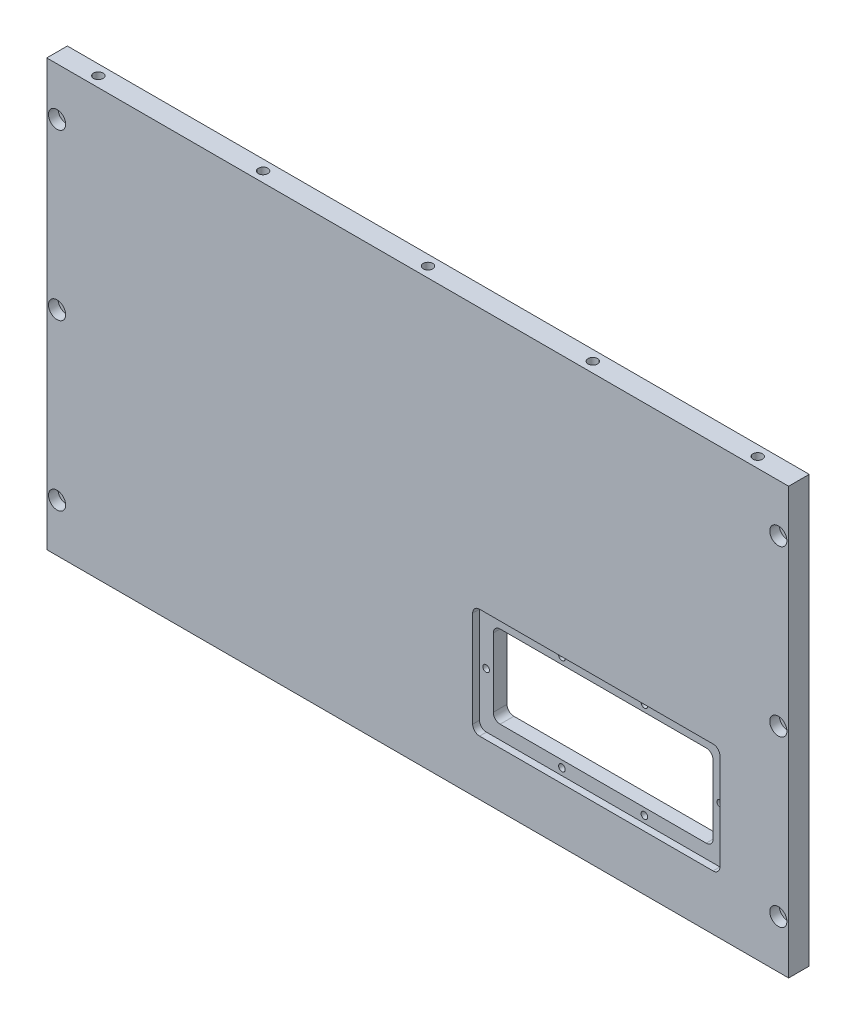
ISO-10303-21;
HEADER;
FILE_DESCRIPTION(('STEP AP214'),'2;1');
FILE_NAME('part.step','',(''),(''),'','','');
FILE_SCHEMA(('AUTOMOTIVE_DESIGN { 1 0 10303 214 1 1 1 1 }'));
ENDSEC;
DATA;
#1=APPLICATION_CONTEXT('core data for automotive mechanical design processes');
#2=APPLICATION_PROTOCOL_DEFINITION('international standard','automotive_design',2000,#1);
#3=PRODUCT_CONTEXT('',#1,'mechanical');
#4=PRODUCT('Part','Part','',(#3));
#5=PRODUCT_RELATED_PRODUCT_CATEGORY('part','',(#4));
#6=PRODUCT_DEFINITION_FORMATION('','',#4);
#7=PRODUCT_DEFINITION_CONTEXT('part definition',#1,'design');
#8=PRODUCT_DEFINITION('design','',#6,#7);
#9=PRODUCT_DEFINITION_SHAPE('','',#8);
#10=(LENGTH_UNIT() NAMED_UNIT(*) SI_UNIT(.MILLI.,.METRE.));
#11=(NAMED_UNIT(*) PLANE_ANGLE_UNIT() SI_UNIT($,.RADIAN.));
#12=(NAMED_UNIT(*) SI_UNIT($,.STERADIAN.) SOLID_ANGLE_UNIT());
#13=UNCERTAINTY_MEASURE_WITH_UNIT(LENGTH_MEASURE(1.E-05),#10,'distance_accuracy_value','');
#14=(GEOMETRIC_REPRESENTATION_CONTEXT(3) GLOBAL_UNCERTAINTY_ASSIGNED_CONTEXT((#13)) GLOBAL_UNIT_ASSIGNED_CONTEXT((#10,
#11,#12)) REPRESENTATION_CONTEXT('',''));
#15=CARTESIAN_POINT('',(0.,0.,0.));
#16=DIRECTION('',(0.,0.,1.));
#17=DIRECTION('',(1.,0.,0.));
#18=AXIS2_PLACEMENT_3D('',#15,#16,#17);
#19=CARTESIAN_POINT('',(171.45,98.425,9.525));
#20=DIRECTION('',(-1.,0.,0.));
#21=DIRECTION('',(0.,-1.,0.));
#22=AXIS2_PLACEMENT_3D('',#19,#20,#21);
#23=PLANE('',#22);
#24=DIRECTION('',(0.,1.,0.));
#25=VECTOR('',#24,1.);
#26=CARTESIAN_POINT('',(171.45,98.425,0.));
#27=LINE('',#26,#25);
#28=CARTESIAN_POINT('',(171.45,-98.425,0.));
#29=VERTEX_POINT('',#28);
#30=CARTESIAN_POINT('',(171.45,98.425,0.));
#31=VERTEX_POINT('',#30);
#32=EDGE_CURVE('E290',#29,#31,#27,.T.);
#33=ORIENTED_EDGE('',*,*,#32,.T.);
#34=DIRECTION('',(0.,0.,-1.));
#35=VECTOR('',#34,1.);
#36=CARTESIAN_POINT('',(171.45,98.425,9.525));
#37=LINE('',#36,#35);
#38=CARTESIAN_POINT('',(171.45,98.425,9.525));
#39=VERTEX_POINT('',#38);
#40=EDGE_CURVE('E41',#39,#31,#37,.T.);
#41=ORIENTED_EDGE('',*,*,#40,.F.);
#42=DIRECTION('',(0.,1.,0.));
#43=VECTOR('',#42,1.);
#44=CARTESIAN_POINT('',(171.45,98.425,9.525));
#45=LINE('',#44,#43);
#46=CARTESIAN_POINT('',(171.45,-98.425,9.525));
#47=VERTEX_POINT('',#46);
#48=EDGE_CURVE('E311',#47,#39,#45,.T.);
#49=ORIENTED_EDGE('',*,*,#48,.F.);
#50=DIRECTION('',(0.,0.,-1.));
#51=VECTOR('',#50,1.);
#52=CARTESIAN_POINT('',(171.45,-98.425,9.525));
#53=LINE('',#52,#51);
#54=EDGE_CURVE('E321',#47,#29,#53,.T.);
#55=ORIENTED_EDGE('',*,*,#54,.T.);
#56=EDGE_LOOP('',(#33,#41,#49,#55));
#57=FACE_BOUND('',#56,.T.);
#58=ADVANCED_FACE('F34',(#57),#23,.F.);
#59=CARTESIAN_POINT('',(-171.45,98.425,9.525));
#60=DIRECTION('',(0.,-1.,0.));
#61=DIRECTION('',(0.,0.,-1.));
#62=AXIS2_PLACEMENT_3D('',#59,#60,#61);
#63=PLANE('',#62);
#64=CARTESIAN_POINT('',(-152.4,98.425,4.76250000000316));
#65=DIRECTION('',(0.,1.,0.));
#66=DIRECTION('',(0.,0.,1.));
#67=AXIS2_PLACEMENT_3D('',#64,#65,#66);
#68=CIRCLE('',#67,2.1971);
#69=CARTESIAN_POINT('',(-152.4,98.425,6.95960000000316));
#70=VERTEX_POINT('',#69);
#71=EDGE_CURVE('E385',#70,#70,#68,.T.);
#72=ORIENTED_EDGE('',*,*,#71,.F.);
#73=EDGE_LOOP('',(#72));
#74=FACE_BOUND('',#73,.T.);
#75=CARTESIAN_POINT('',(-76.2,98.425,4.76250000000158));
#76=DIRECTION('',(0.,1.,0.));
#77=DIRECTION('',(0.,0.,1.));
#78=AXIS2_PLACEMENT_3D('',#75,#76,#77);
#79=CIRCLE('',#78,2.1971);
#80=CARTESIAN_POINT('',(-76.2,98.425,6.95960000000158));
#81=VERTEX_POINT('',#80);
#82=EDGE_CURVE('E389',#81,#81,#79,.T.);
#83=ORIENTED_EDGE('',*,*,#82,.F.);
#84=EDGE_LOOP('',(#83));
#85=FACE_BOUND('',#84,.T.);
#86=CARTESIAN_POINT('',(152.4,98.425,4.7625));
#87=DIRECTION('',(0.,1.,0.));
#88=DIRECTION('',(0.,0.,1.));
#89=AXIS2_PLACEMENT_3D('',#86,#87,#88);
#90=CIRCLE('',#89,2.1971);
#91=CARTESIAN_POINT('',(152.4,98.425,6.9596));
#92=VERTEX_POINT('',#91);
#93=EDGE_CURVE('E393',#92,#92,#90,.T.);
#94=ORIENTED_EDGE('',*,*,#93,.F.);
#95=EDGE_LOOP('',(#94));
#96=FACE_BOUND('',#95,.T.);
#97=CARTESIAN_POINT('',(76.2,98.425,4.7625));
#98=DIRECTION('',(0.,1.,0.));
#99=DIRECTION('',(0.,0.,1.));
#100=AXIS2_PLACEMENT_3D('',#97,#98,#99);
#101=CIRCLE('',#100,2.1971);
#102=CARTESIAN_POINT('',(76.2,98.425,6.9596));
#103=VERTEX_POINT('',#102);
#104=EDGE_CURVE('E397',#103,#103,#101,.T.);
#105=ORIENTED_EDGE('',*,*,#104,.F.);
#106=EDGE_LOOP('',(#105));
#107=FACE_BOUND('',#106,.T.);
#108=CARTESIAN_POINT('',(0.,98.425,4.7625));
#109=DIRECTION('',(0.,1.,0.));
#110=DIRECTION('',(0.,0.,1.));
#111=AXIS2_PLACEMENT_3D('',#108,#109,#110);
#112=CIRCLE('',#111,2.1971);
#113=CARTESIAN_POINT('',(0.,98.425,6.9596));
#114=VERTEX_POINT('',#113);
#115=EDGE_CURVE('E400',#114,#114,#112,.T.);
#116=ORIENTED_EDGE('',*,*,#115,.F.);
#117=EDGE_LOOP('',(#116));
#118=FACE_BOUND('',#117,.T.);
#119=DIRECTION('',(-1.,0.,0.));
#120=VECTOR('',#119,1.);
#121=CARTESIAN_POINT('',(-171.45,98.425,0.));
#122=LINE('',#121,#120);
#123=CARTESIAN_POINT('',(-171.45,98.425,0.));
#124=VERTEX_POINT('',#123);
#125=EDGE_CURVE('E324',#31,#124,#122,.T.);
#126=ORIENTED_EDGE('',*,*,#125,.T.);
#127=DIRECTION('',(0.,0.,-1.));
#128=VECTOR('',#127,1.);
#129=CARTESIAN_POINT('',(-171.45,98.425,9.525));
#130=LINE('',#129,#128);
#131=CARTESIAN_POINT('',(-171.45,98.425,9.525));
#132=VERTEX_POINT('',#131);
#133=EDGE_CURVE('E334',#132,#124,#130,.T.);
#134=ORIENTED_EDGE('',*,*,#133,.F.);
#135=DIRECTION('',(-1.,0.,0.));
#136=VECTOR('',#135,1.);
#137=CARTESIAN_POINT('',(-171.45,98.425,9.525));
#138=LINE('',#137,#136);
#139=EDGE_CURVE('E314',#39,#132,#138,.T.);
#140=ORIENTED_EDGE('',*,*,#139,.F.);
#141=ORIENTED_EDGE('',*,*,#40,.T.);
#142=EDGE_LOOP('',(#126,#134,#140,#141));
#143=FACE_BOUND('',#142,.T.);
#144=ADVANCED_FACE('F339',(#74,#85,#96,#107,#118,#143),#63,.F.);
#145=CARTESIAN_POINT('',(-171.45,98.425,9.525));
#146=DIRECTION('',(1.,0.,0.));
#147=DIRECTION('',(0.,1.,0.));
#148=AXIS2_PLACEMENT_3D('',#145,#146,#147);
#149=PLANE('',#148);
#150=DIRECTION('',(0.,-1.,0.));
#151=VECTOR('',#150,1.);
#152=CARTESIAN_POINT('',(-171.45,98.425,0.));
#153=LINE('',#152,#151);
#154=CARTESIAN_POINT('',(-171.45,-98.425,0.));
#155=VERTEX_POINT('',#154);
#156=EDGE_CURVE('E326',#124,#155,#153,.T.);
#157=ORIENTED_EDGE('',*,*,#156,.T.);
#158=DIRECTION('',(0.,0.,-1.));
#159=VECTOR('',#158,1.);
#160=CARTESIAN_POINT('',(-171.45,-98.425,9.525));
#161=LINE('',#160,#159);
#162=CARTESIAN_POINT('',(-171.45,-98.425,9.525));
#163=VERTEX_POINT('',#162);
#164=EDGE_CURVE('E331',#163,#155,#161,.T.);
#165=ORIENTED_EDGE('',*,*,#164,.F.);
#166=DIRECTION('',(0.,-1.,0.));
#167=VECTOR('',#166,1.);
#168=CARTESIAN_POINT('',(-171.45,98.425,9.525));
#169=LINE('',#168,#167);
#170=EDGE_CURVE('E317',#132,#163,#169,.T.);
#171=ORIENTED_EDGE('',*,*,#170,.F.);
#172=ORIENTED_EDGE('',*,*,#133,.T.);
#173=EDGE_LOOP('',(#157,#165,#171,#172));
#174=FACE_BOUND('',#173,.T.);
#175=ADVANCED_FACE('F351',(#174),#149,.F.);
#176=CARTESIAN_POINT('',(-171.45,-98.425,9.525));
#177=DIRECTION('',(0.,1.,0.));
#178=DIRECTION('',(0.,0.,1.));
#179=AXIS2_PLACEMENT_3D('',#176,#177,#178);
#180=PLANE('',#179);
#181=CARTESIAN_POINT('',(152.4,-98.425,4.76250000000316));
#182=DIRECTION('',(0.,-1.,0.));
#183=DIRECTION('',(0.,0.,-1.));
#184=AXIS2_PLACEMENT_3D('',#181,#182,#183);
#185=CIRCLE('',#184,2.1971);
#186=CARTESIAN_POINT('',(152.4,-98.425,2.56540000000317));
#187=VERTEX_POINT('',#186);
#188=EDGE_CURVE('E406',#187,#187,#185,.T.);
#189=ORIENTED_EDGE('',*,*,#188,.F.);
#190=EDGE_LOOP('',(#189));
#191=FACE_BOUND('',#190,.T.);
#192=CARTESIAN_POINT('',(76.2,-98.425,4.76250000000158));
#193=DIRECTION('',(0.,-1.,0.));
#194=DIRECTION('',(0.,0.,-1.));
#195=AXIS2_PLACEMENT_3D('',#192,#193,#194);
#196=CIRCLE('',#195,2.1971);
#197=CARTESIAN_POINT('',(76.2,-98.425,2.56540000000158));
#198=VERTEX_POINT('',#197);
#199=EDGE_CURVE('E428',#198,#198,#196,.T.);
#200=ORIENTED_EDGE('',*,*,#199,.F.);
#201=EDGE_LOOP('',(#200));
#202=FACE_BOUND('',#201,.T.);
#203=CARTESIAN_POINT('',(-152.4,-98.425,4.7625));
#204=DIRECTION('',(0.,-1.,0.));
#205=DIRECTION('',(0.,0.,-1.));
#206=AXIS2_PLACEMENT_3D('',#203,#204,#205);
#207=CIRCLE('',#206,2.1971);
#208=CARTESIAN_POINT('',(-152.4,-98.425,2.5654));
#209=VERTEX_POINT('',#208);
#210=EDGE_CURVE('E422',#209,#209,#207,.T.);
#211=ORIENTED_EDGE('',*,*,#210,.F.);
#212=EDGE_LOOP('',(#211));
#213=FACE_BOUND('',#212,.T.);
#214=CARTESIAN_POINT('',(-76.2,-98.425,4.7625));
#215=DIRECTION('',(0.,-1.,0.));
#216=DIRECTION('',(0.,0.,-1.));
#217=AXIS2_PLACEMENT_3D('',#214,#215,#216);
#218=CIRCLE('',#217,2.1971);
#219=CARTESIAN_POINT('',(-76.2,-98.425,2.5654));
#220=VERTEX_POINT('',#219);
#221=EDGE_CURVE('E416',#220,#220,#218,.T.);
#222=ORIENTED_EDGE('',*,*,#221,.F.);
#223=EDGE_LOOP('',(#222));
#224=FACE_BOUND('',#223,.T.);
#225=CARTESIAN_POINT('',(0.,-98.425,4.7625));
#226=DIRECTION('',(0.,-1.,0.));
#227=DIRECTION('',(0.,0.,-1.));
#228=AXIS2_PLACEMENT_3D('',#225,#226,#227);
#229=CIRCLE('',#228,2.1971);
#230=CARTESIAN_POINT('',(0.,-98.425,2.5654));
#231=VERTEX_POINT('',#230);
#232=EDGE_CURVE('E415',#231,#231,#229,.T.);
#233=ORIENTED_EDGE('',*,*,#232,.F.);
#234=EDGE_LOOP('',(#233));
#235=FACE_BOUND('',#234,.T.);
#236=DIRECTION('',(1.,0.,0.));
#237=VECTOR('',#236,1.);
#238=CARTESIAN_POINT('',(-171.45,-98.425,0.));
#239=LINE('',#238,#237);
#240=EDGE_CURVE('E315',#155,#29,#239,.T.);
#241=ORIENTED_EDGE('',*,*,#240,.T.);
#242=ORIENTED_EDGE('',*,*,#54,.F.);
#243=DIRECTION('',(1.,0.,0.));
#244=VECTOR('',#243,1.);
#245=CARTESIAN_POINT('',(-171.45,-98.425,9.525));
#246=LINE('',#245,#244);
#247=EDGE_CURVE('E319',#163,#47,#246,.T.);
#248=ORIENTED_EDGE('',*,*,#247,.F.);
#249=ORIENTED_EDGE('',*,*,#164,.T.);
#250=EDGE_LOOP('',(#241,#242,#248,#249));
#251=FACE_BOUND('',#250,.T.);
#252=ADVANCED_FACE('F355',(#191,#202,#213,#224,#235,#251),#180,.F.);
#253=CARTESIAN_POINT('',(0.,0.,9.525));
#254=DIRECTION('',(0.,0.,1.));
#255=DIRECTION('',(1.,0.,0.));
#256=AXIS2_PLACEMENT_3D('',#253,#254,#255);
#257=PLANE('',#256);
#258=CARTESIAN_POINT('',(-166.6875,76.2,9.525));
#259=DIRECTION('',(0.,0.,1.));
#260=DIRECTION('',(1.,0.,0.));
#261=AXIS2_PLACEMENT_3D('',#258,#259,#260);
#262=CIRCLE('',#261,3.96874999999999);
#263=CARTESIAN_POINT('',(-162.71875,76.2,9.525));
#264=VERTEX_POINT('',#263);
#265=EDGE_CURVE('E1105',#264,#264,#262,.T.);
#266=ORIENTED_EDGE('',*,*,#265,.F.);
#267=EDGE_LOOP('',(#266));
#268=FACE_BOUND('',#267,.T.);
#269=CARTESIAN_POINT('',(-166.6875,0.,9.525));
#270=DIRECTION('',(0.,0.,1.));
#271=DIRECTION('',(1.,0.,0.));
#272=AXIS2_PLACEMENT_3D('',#269,#270,#271);
#273=CIRCLE('',#272,3.96874999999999);
#274=CARTESIAN_POINT('',(-162.71875,0.,9.525));
#275=VERTEX_POINT('',#274);
#276=EDGE_CURVE('E1115',#275,#275,#273,.T.);
#277=ORIENTED_EDGE('',*,*,#276,.F.);
#278=EDGE_LOOP('',(#277));
#279=FACE_BOUND('',#278,.T.);
#280=CARTESIAN_POINT('',(-166.687499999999,-76.2,9.525));
#281=DIRECTION('',(0.,0.,1.));
#282=DIRECTION('',(1.,0.,0.));
#283=AXIS2_PLACEMENT_3D('',#280,#281,#282);
#284=CIRCLE('',#283,3.96874999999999);
#285=CARTESIAN_POINT('',(-162.718749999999,-76.2,9.525));
#286=VERTEX_POINT('',#285);
#287=EDGE_CURVE('E1127',#286,#286,#284,.T.);
#288=ORIENTED_EDGE('',*,*,#287,.F.);
#289=EDGE_LOOP('',(#288));
#290=FACE_BOUND('',#289,.T.);
#291=CARTESIAN_POINT('',(166.6875,76.2000000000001,9.525));
#292=DIRECTION('',(0.,0.,1.));
#293=DIRECTION('',(1.,0.,0.));
#294=AXIS2_PLACEMENT_3D('',#291,#292,#293);
#295=CIRCLE('',#294,3.96874999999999);
#296=CARTESIAN_POINT('',(170.65625,76.2000000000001,9.525));
#297=VERTEX_POINT('',#296);
#298=EDGE_CURVE('E1139',#297,#297,#295,.T.);
#299=ORIENTED_EDGE('',*,*,#298,.F.);
#300=EDGE_LOOP('',(#299));
#301=FACE_BOUND('',#300,.T.);
#302=CARTESIAN_POINT('',(166.6875,0.,9.525));
#303=DIRECTION('',(0.,0.,1.));
#304=DIRECTION('',(1.,0.,0.));
#305=AXIS2_PLACEMENT_3D('',#302,#303,#304);
#306=CIRCLE('',#305,3.96874999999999);
#307=CARTESIAN_POINT('',(170.65625,0.,9.525));
#308=VERTEX_POINT('',#307);
#309=EDGE_CURVE('E1151',#308,#308,#306,.T.);
#310=ORIENTED_EDGE('',*,*,#309,.F.);
#311=EDGE_LOOP('',(#310));
#312=FACE_BOUND('',#311,.T.);
#313=CARTESIAN_POINT('',(166.687499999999,-76.1999999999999,9.525));
#314=DIRECTION('',(0.,0.,1.));
#315=DIRECTION('',(1.,0.,0.));
#316=AXIS2_PLACEMENT_3D('',#313,#314,#315);
#317=CIRCLE('',#316,3.96874999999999);
#318=CARTESIAN_POINT('',(170.656249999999,-76.1999999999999,9.525));
#319=VERTEX_POINT('',#318);
#320=EDGE_CURVE('E1163',#319,#319,#317,.T.);
#321=ORIENTED_EDGE('',*,*,#320,.F.);
#322=EDGE_LOOP('',(#321));
#323=FACE_BOUND('',#322,.T.);
#324=CARTESIAN_POINT('',(136.525,-69.85,9.525));
#325=DIRECTION('',(0.,0.,1.));
#326=DIRECTION('',(-1.,0.,0.));
#327=AXIS2_PLACEMENT_3D('',#324,#325,#326);
#328=CIRCLE('',#327,3.17499999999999);
#329=CARTESIAN_POINT('',(136.525,-73.025,9.525));
#330=VERTEX_POINT('',#329);
#331=CARTESIAN_POINT('',(139.7,-69.85,9.525));
#332=VERTEX_POINT('',#331);
#333=EDGE_CURVE('E48',#330,#332,#328,.T.);
#334=ORIENTED_EDGE('',*,*,#333,.F.);
#335=DIRECTION('',(1.,0.,0.));
#336=VECTOR('',#335,1.);
#337=CARTESIAN_POINT('',(28.575,-73.025,9.525));
#338=LINE('',#337,#336);
#339=CARTESIAN_POINT('',(28.575,-73.025,9.525));
#340=VERTEX_POINT('',#339);
#341=EDGE_CURVE('E190',#340,#330,#338,.T.);
#342=ORIENTED_EDGE('',*,*,#341,.F.);
#343=CARTESIAN_POINT('',(28.575,-69.85,9.525));
#344=DIRECTION('',(0.,0.,1.));
#345=DIRECTION('',(-1.,0.,0.));
#346=AXIS2_PLACEMENT_3D('',#343,#344,#345);
#347=CIRCLE('',#346,3.175);
#348=CARTESIAN_POINT('',(25.4,-69.85,9.525));
#349=VERTEX_POINT('',#348);
#350=EDGE_CURVE('E193',#349,#340,#347,.T.);
#351=ORIENTED_EDGE('',*,*,#350,.F.);
#352=DIRECTION('',(0.,-1.,0.));
#353=VECTOR('',#352,1.);
#354=CARTESIAN_POINT('',(25.4,-25.4,9.525));
#355=LINE('',#354,#353);
#356=CARTESIAN_POINT('',(25.4,-25.4,9.525));
#357=VERTEX_POINT('',#356);
#358=EDGE_CURVE('E225',#357,#349,#355,.T.);
#359=ORIENTED_EDGE('',*,*,#358,.F.);
#360=CARTESIAN_POINT('',(28.575,-25.4,9.525));
#361=DIRECTION('',(0.,0.,1.));
#362=DIRECTION('',(1.,0.,0.));
#363=AXIS2_PLACEMENT_3D('',#360,#361,#362);
#364=CIRCLE('',#363,3.175);
#365=CARTESIAN_POINT('',(28.575,-22.225,9.525));
#366=VERTEX_POINT('',#365);
#367=EDGE_CURVE('E222',#366,#357,#364,.T.);
#368=ORIENTED_EDGE('',*,*,#367,.F.);
#369=DIRECTION('',(-1.,0.,0.));
#370=VECTOR('',#369,1.);
#371=CARTESIAN_POINT('',(28.575,-22.225,9.525));
#372=LINE('',#371,#370);
#373=CARTESIAN_POINT('',(136.525,-22.225,9.525));
#374=VERTEX_POINT('',#373);
#375=EDGE_CURVE('E219',#374,#366,#372,.T.);
#376=ORIENTED_EDGE('',*,*,#375,.F.);
#377=CARTESIAN_POINT('',(136.525,-25.4,9.525));
#378=DIRECTION('',(0.,0.,1.));
#379=DIRECTION('',(-1.,0.,0.));
#380=AXIS2_PLACEMENT_3D('',#377,#378,#379);
#381=CIRCLE('',#380,3.17500000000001);
#382=CARTESIAN_POINT('',(139.7,-25.4,9.525));
#383=VERTEX_POINT('',#382);
#384=EDGE_CURVE('E216',#383,#374,#381,.T.);
#385=ORIENTED_EDGE('',*,*,#384,.F.);
#386=DIRECTION('',(0.,1.,0.));
#387=VECTOR('',#386,1.);
#388=CARTESIAN_POINT('',(139.7,-25.4,9.525));
#389=LINE('',#388,#387);
#390=EDGE_CURVE('E213',#332,#383,#389,.T.);
#391=ORIENTED_EDGE('',*,*,#390,.F.);
#392=EDGE_LOOP('',(#334,#342,#351,#359,#368,#376,#385,#391));
#393=FACE_BOUND('',#392,.T.);
#394=ORIENTED_EDGE('',*,*,#48,.T.);
#395=ORIENTED_EDGE('',*,*,#139,.T.);
#396=ORIENTED_EDGE('',*,*,#170,.T.);
#397=ORIENTED_EDGE('',*,*,#247,.T.);
#398=EDGE_LOOP('',(#394,#395,#396,#397));
#399=FACE_BOUND('',#398,.T.);
#400=ADVANCED_FACE('F357',(#268,#279,#290,#301,#312,#323,#393,#399),#257,.T.);
#401=CARTESIAN_POINT('',(0.,0.,0.));
#402=DIRECTION('',(0.,0.,1.));
#403=DIRECTION('',(1.,0.,0.));
#404=AXIS2_PLACEMENT_3D('',#401,#402,#403);
#405=PLANE('',#404);
#406=CARTESIAN_POINT('',(-166.6875,76.2,0.));
#407=DIRECTION('',(0.,0.,1.));
#408=DIRECTION('',(1.,0.,0.));
#409=AXIS2_PLACEMENT_3D('',#406,#407,#408);
#410=CIRCLE('',#409,2.15265000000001);
#411=CARTESIAN_POINT('',(-164.53485,76.2,0.));
#412=VERTEX_POINT('',#411);
#413=EDGE_CURVE('E1112',#412,#412,#410,.T.);
#414=ORIENTED_EDGE('',*,*,#413,.T.);
#415=EDGE_LOOP('',(#414));
#416=FACE_BOUND('',#415,.T.);
#417=CARTESIAN_POINT('',(-166.6875,0.,0.));
#418=DIRECTION('',(0.,0.,1.));
#419=DIRECTION('',(1.,0.,0.));
#420=AXIS2_PLACEMENT_3D('',#417,#418,#419);
#421=CIRCLE('',#420,2.15265000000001);
#422=CARTESIAN_POINT('',(-164.53485,0.,0.));
#423=VERTEX_POINT('',#422);
#424=EDGE_CURVE('E1124',#423,#423,#421,.T.);
#425=ORIENTED_EDGE('',*,*,#424,.T.);
#426=EDGE_LOOP('',(#425));
#427=FACE_BOUND('',#426,.T.);
#428=CARTESIAN_POINT('',(-166.687499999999,-76.2,0.));
#429=DIRECTION('',(0.,0.,1.));
#430=DIRECTION('',(1.,0.,0.));
#431=AXIS2_PLACEMENT_3D('',#428,#429,#430);
#432=CIRCLE('',#431,2.15265000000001);
#433=CARTESIAN_POINT('',(-164.534849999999,-76.2,0.));
#434=VERTEX_POINT('',#433);
#435=EDGE_CURVE('E1136',#434,#434,#432,.T.);
#436=ORIENTED_EDGE('',*,*,#435,.T.);
#437=EDGE_LOOP('',(#436));
#438=FACE_BOUND('',#437,.T.);
#439=CARTESIAN_POINT('',(166.6875,76.2000000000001,0.));
#440=DIRECTION('',(0.,0.,1.));
#441=DIRECTION('',(1.,0.,0.));
#442=AXIS2_PLACEMENT_3D('',#439,#440,#441);
#443=CIRCLE('',#442,2.15265000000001);
#444=CARTESIAN_POINT('',(168.84015,76.2000000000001,0.));
#445=VERTEX_POINT('',#444);
#446=EDGE_CURVE('E1148',#445,#445,#443,.T.);
#447=ORIENTED_EDGE('',*,*,#446,.T.);
#448=EDGE_LOOP('',(#447));
#449=FACE_BOUND('',#448,.T.);
#450=CARTESIAN_POINT('',(166.6875,0.,0.));
#451=DIRECTION('',(0.,0.,1.));
#452=DIRECTION('',(1.,0.,0.));
#453=AXIS2_PLACEMENT_3D('',#450,#451,#452);
#454=CIRCLE('',#453,2.15265000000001);
#455=CARTESIAN_POINT('',(168.84015,0.,0.));
#456=VERTEX_POINT('',#455);
#457=EDGE_CURVE('E1160',#456,#456,#454,.T.);
#458=ORIENTED_EDGE('',*,*,#457,.T.);
#459=EDGE_LOOP('',(#458));
#460=FACE_BOUND('',#459,.T.);
#461=CARTESIAN_POINT('',(166.687499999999,-76.1999999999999,0.));
#462=DIRECTION('',(0.,0.,1.));
#463=DIRECTION('',(1.,0.,0.));
#464=AXIS2_PLACEMENT_3D('',#461,#462,#463);
#465=CIRCLE('',#464,2.15265000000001);
#466=CARTESIAN_POINT('',(168.840149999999,-76.1999999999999,0.));
#467=VERTEX_POINT('',#466);
#468=EDGE_CURVE('E1172',#467,#467,#465,.T.);
#469=ORIENTED_EDGE('',*,*,#468,.T.);
#470=EDGE_LOOP('',(#469));
#471=FACE_BOUND('',#470,.T.);
#472=CARTESIAN_POINT('',(28.4479999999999,-47.625,0.));
#473=DIRECTION('',(0.,0.,1.));
#474=DIRECTION('',(-1.,0.,0.));
#475=AXIS2_PLACEMENT_3D('',#472,#473,#474);
#476=CIRCLE('',#475,1.524);
#477=CARTESIAN_POINT('',(29.9719999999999,-47.625,0.));
#478=VERTEX_POINT('',#477);
#479=EDGE_CURVE('E466',#478,#478,#476,.T.);
#480=ORIENTED_EDGE('',*,*,#479,.T.);
#481=EDGE_LOOP('',(#480));
#482=FACE_BOUND('',#481,.T.);
#483=CARTESIAN_POINT('',(136.652,-47.625,0.));
#484=DIRECTION('',(0.,0.,1.));
#485=DIRECTION('',(1.,0.,0.));
#486=AXIS2_PLACEMENT_3D('',#483,#484,#485);
#487=CIRCLE('',#486,1.52400000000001);
#488=CARTESIAN_POINT('',(138.176,-47.625,0.));
#489=VERTEX_POINT('',#488);
#490=EDGE_CURVE('E460',#489,#489,#487,.T.);
#491=ORIENTED_EDGE('',*,*,#490,.T.);
#492=EDGE_LOOP('',(#491));
#493=FACE_BOUND('',#492,.T.);
#494=CARTESIAN_POINT('',(63.5,-69.85,0.));
#495=DIRECTION('',(0.,0.,1.));
#496=DIRECTION('',(-1.,0.,0.));
#497=AXIS2_PLACEMENT_3D('',#494,#495,#496);
#498=CIRCLE('',#497,1.52399999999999);
#499=CARTESIAN_POINT('',(65.024,-69.85,0.));
#500=VERTEX_POINT('',#499);
#501=EDGE_CURVE('E454',#500,#500,#498,.T.);
#502=ORIENTED_EDGE('',*,*,#501,.T.);
#503=EDGE_LOOP('',(#502));
#504=FACE_BOUND('',#503,.T.);
#505=CARTESIAN_POINT('',(63.5,-25.4,0.));
#506=DIRECTION('',(0.,0.,1.));
#507=DIRECTION('',(1.,0.,0.));
#508=AXIS2_PLACEMENT_3D('',#505,#506,#507);
#509=CIRCLE('',#508,1.52399999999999);
#510=CARTESIAN_POINT('',(65.024,-25.4,0.));
#511=VERTEX_POINT('',#510);
#512=EDGE_CURVE('E448',#511,#511,#509,.T.);
#513=ORIENTED_EDGE('',*,*,#512,.T.);
#514=EDGE_LOOP('',(#513));
#515=FACE_BOUND('',#514,.T.);
#516=CARTESIAN_POINT('',(101.6,-25.4,0.));
#517=DIRECTION('',(0.,0.,1.));
#518=DIRECTION('',(-1.,0.,0.));
#519=AXIS2_PLACEMENT_3D('',#516,#517,#518);
#520=CIRCLE('',#519,1.52399999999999);
#521=CARTESIAN_POINT('',(103.124,-25.4,0.));
#522=VERTEX_POINT('',#521);
#523=EDGE_CURVE('E442',#522,#522,#520,.T.);
#524=ORIENTED_EDGE('',*,*,#523,.T.);
#525=EDGE_LOOP('',(#524));
#526=FACE_BOUND('',#525,.T.);
#527=CARTESIAN_POINT('',(101.6,-69.85,0.));
#528=DIRECTION('',(0.,0.,1.));
#529=DIRECTION('',(1.,0.,0.));
#530=AXIS2_PLACEMENT_3D('',#527,#528,#529);
#531=CIRCLE('',#530,1.52399999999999);
#532=CARTESIAN_POINT('',(103.124,-69.85,0.));
#533=VERTEX_POINT('',#532);
#534=EDGE_CURVE('E214',#533,#533,#531,.T.);
#535=ORIENTED_EDGE('',*,*,#534,.T.);
#536=EDGE_LOOP('',(#535));
#537=FACE_BOUND('',#536,.T.);
#538=DIRECTION('',(0.,1.,0.));
#539=VECTOR('',#538,1.);
#540=CARTESIAN_POINT('',(133.35,-31.75,0.));
#541=LINE('',#540,#539);
#542=CARTESIAN_POINT('',(133.35,-63.5,0.));
#543=VERTEX_POINT('',#542);
#544=CARTESIAN_POINT('',(133.35,-31.75,0.));
#545=VERTEX_POINT('',#544);
#546=EDGE_CURVE('E283',#543,#545,#541,.T.);
#547=ORIENTED_EDGE('',*,*,#546,.T.);
#548=CARTESIAN_POINT('',(130.175,-31.75,0.));
#549=DIRECTION('',(0.,0.,1.));
#550=DIRECTION('',(1.,0.,0.));
#551=AXIS2_PLACEMENT_3D('',#548,#549,#550);
#552=CIRCLE('',#551,3.175);
#553=CARTESIAN_POINT('',(130.175,-28.575,0.));
#554=VERTEX_POINT('',#553);
#555=EDGE_CURVE('E262',#545,#554,#552,.T.);
#556=ORIENTED_EDGE('',*,*,#555,.T.);
#557=DIRECTION('',(-1.,0.,0.));
#558=VECTOR('',#557,1.);
#559=CARTESIAN_POINT('',(34.925,-28.575,0.));
#560=LINE('',#559,#558);
#561=CARTESIAN_POINT('',(34.925,-28.575,0.));
#562=VERTEX_POINT('',#561);
#563=EDGE_CURVE('E265',#554,#562,#560,.T.);
#564=ORIENTED_EDGE('',*,*,#563,.T.);
#565=CARTESIAN_POINT('',(34.925,-31.75,0.));
#566=DIRECTION('',(0.,0.,1.));
#567=DIRECTION('',(1.,0.,0.));
#568=AXIS2_PLACEMENT_3D('',#565,#566,#567);
#569=CIRCLE('',#568,3.17499999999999);
#570=CARTESIAN_POINT('',(31.75,-31.75,0.));
#571=VERTEX_POINT('',#570);
#572=EDGE_CURVE('E268',#562,#571,#569,.T.);
#573=ORIENTED_EDGE('',*,*,#572,.T.);
#574=DIRECTION('',(0.,-1.,0.));
#575=VECTOR('',#574,1.);
#576=CARTESIAN_POINT('',(31.75,-31.75,0.));
#577=LINE('',#576,#575);
#578=CARTESIAN_POINT('',(31.75,-63.5,0.));
#579=VERTEX_POINT('',#578);
#580=EDGE_CURVE('E271',#571,#579,#577,.T.);
#581=ORIENTED_EDGE('',*,*,#580,.T.);
#582=CARTESIAN_POINT('',(34.925,-63.5,0.));
#583=DIRECTION('',(0.,0.,1.));
#584=DIRECTION('',(1.,0.,0.));
#585=AXIS2_PLACEMENT_3D('',#582,#583,#584);
#586=CIRCLE('',#585,3.175);
#587=CARTESIAN_POINT('',(34.925,-66.675,0.));
#588=VERTEX_POINT('',#587);
#589=EDGE_CURVE('E274',#579,#588,#586,.T.);
#590=ORIENTED_EDGE('',*,*,#589,.T.);
#591=DIRECTION('',(1.,0.,0.));
#592=VECTOR('',#591,1.);
#593=CARTESIAN_POINT('',(34.925,-66.675,0.));
#594=LINE('',#593,#592);
#595=CARTESIAN_POINT('',(130.175,-66.675,0.));
#596=VERTEX_POINT('',#595);
#597=EDGE_CURVE('E277',#588,#596,#594,.T.);
#598=ORIENTED_EDGE('',*,*,#597,.T.);
#599=CARTESIAN_POINT('',(130.175,-63.5,0.));
#600=DIRECTION('',(0.,0.,1.));
#601=DIRECTION('',(-1.,0.,0.));
#602=AXIS2_PLACEMENT_3D('',#599,#600,#601);
#603=CIRCLE('',#602,3.17500000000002);
#604=EDGE_CURVE('E280',#596,#543,#603,.T.);
#605=ORIENTED_EDGE('',*,*,#604,.T.);
#606=EDGE_LOOP('',(#547,#556,#564,#573,#581,#590,#598,#605));
#607=FACE_BOUND('',#606,.T.);
#608=ORIENTED_EDGE('',*,*,#32,.F.);
#609=ORIENTED_EDGE('',*,*,#240,.F.);
#610=ORIENTED_EDGE('',*,*,#156,.F.);
#611=ORIENTED_EDGE('',*,*,#125,.F.);
#612=EDGE_LOOP('',(#608,#609,#610,#611));
#613=FACE_BOUND('',#612,.T.);
#614=ADVANCED_FACE('F347',(#416,#427,#438,#449,#460,#471,#482,#493,#504,#515,#526,#537,#607,
#613),#405,.F.);
#615=CARTESIAN_POINT('',(130.175,-31.75,0.));
#616=DIRECTION('',(0.,0.,1.));
#617=DIRECTION('',(1.,0.,0.));
#618=AXIS2_PLACEMENT_3D('',#615,#616,#617);
#619=CYLINDRICAL_SURFACE('',#618,3.175);
#620=DIRECTION('',(0.,0.,1.));
#621=VECTOR('',#620,1.);
#622=CARTESIAN_POINT('',(133.35,-31.75,0.));
#623=LINE('',#622,#621);
#624=CARTESIAN_POINT('',(133.35,-31.75,6.35));
#625=VERTEX_POINT('',#624);
#626=EDGE_CURVE('E287',#545,#625,#623,.T.);
#627=ORIENTED_EDGE('',*,*,#626,.T.);
#628=CARTESIAN_POINT('',(130.175,-31.75,6.35));
#629=DIRECTION('',(0.,0.,-1.));
#630=DIRECTION('',(-1.,0.,0.));
#631=AXIS2_PLACEMENT_3D('',#628,#629,#630);
#632=CIRCLE('',#631,3.175);
#633=CARTESIAN_POINT('',(130.175,-28.575,6.35));
#634=VERTEX_POINT('',#633);
#635=EDGE_CURVE('E259',#625,#634,#632,.F.);
#636=ORIENTED_EDGE('',*,*,#635,.T.);
#637=DIRECTION('',(0.,0.,1.));
#638=VECTOR('',#637,1.);
#639=CARTESIAN_POINT('',(130.175,-28.575,0.));
#640=LINE('',#639,#638);
#641=EDGE_CURVE('E286',#554,#634,#640,.T.);
#642=ORIENTED_EDGE('',*,*,#641,.F.);
#643=ORIENTED_EDGE('',*,*,#555,.F.);
#644=EDGE_LOOP('',(#627,#636,#642,#643));
#645=FACE_BOUND('',#644,.T.);
#646=ADVANCED_FACE('F365',(#645),#619,.F.);
#647=CARTESIAN_POINT('',(133.35,-31.75,0.));
#648=DIRECTION('',(1.,0.,0.));
#649=DIRECTION('',(0.,1.,0.));
#650=AXIS2_PLACEMENT_3D('',#647,#648,#649);
#651=PLANE('',#650);
#652=DIRECTION('',(0.,0.,1.));
#653=VECTOR('',#652,1.);
#654=CARTESIAN_POINT('',(133.35,-63.5,0.));
#655=LINE('',#654,#653);
#656=CARTESIAN_POINT('',(133.35,-63.5,6.35));
#657=VERTEX_POINT('',#656);
#658=EDGE_CURVE('E291',#543,#657,#655,.T.);
#659=ORIENTED_EDGE('',*,*,#658,.T.);
#660=DIRECTION('',(0.,1.,0.));
#661=VECTOR('',#660,1.);
#662=CARTESIAN_POINT('',(133.35,-31.75,6.35));
#663=LINE('',#662,#661);
#664=EDGE_CURVE('E256',#657,#625,#663,.T.);
#665=ORIENTED_EDGE('',*,*,#664,.T.);
#666=ORIENTED_EDGE('',*,*,#626,.F.);
#667=ORIENTED_EDGE('',*,*,#546,.F.);
#668=EDGE_LOOP('',(#659,#665,#666,#667));
#669=FACE_BOUND('',#668,.T.);
#670=ADVANCED_FACE('F521',(#669),#651,.F.);
#671=CARTESIAN_POINT('',(130.175,-63.5,0.));
#672=DIRECTION('',(0.,0.,1.));
#673=DIRECTION('',(1.,0.,0.));
#674=AXIS2_PLACEMENT_3D('',#671,#672,#673);
#675=CYLINDRICAL_SURFACE('',#674,3.17500000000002);
#676=DIRECTION('',(0.,0.,1.));
#677=VECTOR('',#676,1.);
#678=CARTESIAN_POINT('',(130.175,-66.675,0.));
#679=LINE('',#678,#677);
#680=CARTESIAN_POINT('',(130.175,-66.675,6.35));
#681=VERTEX_POINT('',#680);
#682=EDGE_CURVE('E294',#596,#681,#679,.T.);
#683=ORIENTED_EDGE('',*,*,#682,.T.);
#684=CARTESIAN_POINT('',(130.175,-63.5,6.35));
#685=DIRECTION('',(0.,0.,-1.));
#686=DIRECTION('',(-1.,0.,0.));
#687=AXIS2_PLACEMENT_3D('',#684,#685,#686);
#688=CIRCLE('',#687,3.17500000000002);
#689=EDGE_CURVE('E253',#681,#657,#688,.F.);
#690=ORIENTED_EDGE('',*,*,#689,.T.);
#691=ORIENTED_EDGE('',*,*,#658,.F.);
#692=ORIENTED_EDGE('',*,*,#604,.F.);
#693=EDGE_LOOP('',(#683,#690,#691,#692));
#694=FACE_BOUND('',#693,.T.);
#695=ADVANCED_FACE('F524',(#694),#675,.F.);
#696=CARTESIAN_POINT('',(34.925,-66.675,0.));
#697=DIRECTION('',(0.,-1.,0.));
#698=DIRECTION('',(0.,0.,-1.));
#699=AXIS2_PLACEMENT_3D('',#696,#697,#698);
#700=PLANE('',#699);
#701=DIRECTION('',(0.,0.,1.));
#702=VECTOR('',#701,1.);
#703=CARTESIAN_POINT('',(34.925,-66.675,0.));
#704=LINE('',#703,#702);
#705=CARTESIAN_POINT('',(34.925,-66.675,6.35));
#706=VERTEX_POINT('',#705);
#707=EDGE_CURVE('E297',#588,#706,#704,.T.);
#708=ORIENTED_EDGE('',*,*,#707,.T.);
#709=DIRECTION('',(1.,0.,0.));
#710=VECTOR('',#709,1.);
#711=CARTESIAN_POINT('',(34.925,-66.675,6.35));
#712=LINE('',#711,#710);
#713=EDGE_CURVE('E250',#706,#681,#712,.T.);
#714=ORIENTED_EDGE('',*,*,#713,.T.);
#715=ORIENTED_EDGE('',*,*,#682,.F.);
#716=ORIENTED_EDGE('',*,*,#597,.F.);
#717=EDGE_LOOP('',(#708,#714,#715,#716));
#718=FACE_BOUND('',#717,.T.);
#719=ADVANCED_FACE('F528',(#718),#700,.F.);
#720=CARTESIAN_POINT('',(34.925,-63.5,0.));
#721=DIRECTION('',(0.,0.,1.));
#722=DIRECTION('',(1.,0.,0.));
#723=AXIS2_PLACEMENT_3D('',#720,#721,#722);
#724=CYLINDRICAL_SURFACE('',#723,3.175);
#725=DIRECTION('',(0.,0.,1.));
#726=VECTOR('',#725,1.);
#727=CARTESIAN_POINT('',(31.75,-63.5,0.));
#728=LINE('',#727,#726);
#729=CARTESIAN_POINT('',(31.75,-63.5,6.35));
#730=VERTEX_POINT('',#729);
#731=EDGE_CURVE('E300',#579,#730,#728,.T.);
#732=ORIENTED_EDGE('',*,*,#731,.T.);
#733=CARTESIAN_POINT('',(34.925,-63.5,6.35));
#734=DIRECTION('',(0.,0.,-1.));
#735=DIRECTION('',(-1.,0.,0.));
#736=AXIS2_PLACEMENT_3D('',#733,#734,#735);
#737=CIRCLE('',#736,3.175);
#738=EDGE_CURVE('E247',#730,#706,#737,.F.);
#739=ORIENTED_EDGE('',*,*,#738,.T.);
#740=ORIENTED_EDGE('',*,*,#707,.F.);
#741=ORIENTED_EDGE('',*,*,#589,.F.);
#742=EDGE_LOOP('',(#732,#739,#740,#741));
#743=FACE_BOUND('',#742,.T.);
#744=ADVANCED_FACE('F532',(#743),#724,.F.);
#745=CARTESIAN_POINT('',(31.75,-31.75,0.));
#746=DIRECTION('',(-1.,0.,0.));
#747=DIRECTION('',(0.,0.,1.));
#748=AXIS2_PLACEMENT_3D('',#745,#746,#747);
#749=PLANE('',#748);
#750=DIRECTION('',(0.,0.,1.));
#751=VECTOR('',#750,1.);
#752=CARTESIAN_POINT('',(31.75,-31.75,0.));
#753=LINE('',#752,#751);
#754=CARTESIAN_POINT('',(31.75,-31.75,6.35));
#755=VERTEX_POINT('',#754);
#756=EDGE_CURVE('E303',#571,#755,#753,.T.);
#757=ORIENTED_EDGE('',*,*,#756,.T.);
#758=DIRECTION('',(0.,-1.,0.));
#759=VECTOR('',#758,1.);
#760=CARTESIAN_POINT('',(31.75,-31.75,6.35));
#761=LINE('',#760,#759);
#762=EDGE_CURVE('E244',#755,#730,#761,.T.);
#763=ORIENTED_EDGE('',*,*,#762,.T.);
#764=ORIENTED_EDGE('',*,*,#731,.F.);
#765=ORIENTED_EDGE('',*,*,#580,.F.);
#766=EDGE_LOOP('',(#757,#763,#764,#765));
#767=FACE_BOUND('',#766,.T.);
#768=ADVANCED_FACE('F536',(#767),#749,.F.);
#769=CARTESIAN_POINT('',(34.925,-31.75,0.));
#770=DIRECTION('',(0.,0.,1.));
#771=DIRECTION('',(1.,0.,0.));
#772=AXIS2_PLACEMENT_3D('',#769,#770,#771);
#773=CYLINDRICAL_SURFACE('',#772,3.17499999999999);
#774=DIRECTION('',(0.,0.,1.));
#775=VECTOR('',#774,1.);
#776=CARTESIAN_POINT('',(34.925,-28.575,0.));
#777=LINE('',#776,#775);
#778=CARTESIAN_POINT('',(34.925,-28.575,6.35));
#779=VERTEX_POINT('',#778);
#780=EDGE_CURVE('E306',#562,#779,#777,.T.);
#781=ORIENTED_EDGE('',*,*,#780,.T.);
#782=CARTESIAN_POINT('',(34.925,-31.75,6.35));
#783=DIRECTION('',(0.,0.,-1.));
#784=DIRECTION('',(-1.,0.,0.));
#785=AXIS2_PLACEMENT_3D('',#782,#783,#784);
#786=CIRCLE('',#785,3.17499999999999);
#787=EDGE_CURVE('E56',#779,#755,#786,.F.);
#788=ORIENTED_EDGE('',*,*,#787,.T.);
#789=ORIENTED_EDGE('',*,*,#756,.F.);
#790=ORIENTED_EDGE('',*,*,#572,.F.);
#791=EDGE_LOOP('',(#781,#788,#789,#790));
#792=FACE_BOUND('',#791,.T.);
#793=ADVANCED_FACE('F488',(#792),#773,.F.);
#794=CARTESIAN_POINT('',(34.925,-28.575,0.));
#795=DIRECTION('',(0.,1.,0.));
#796=DIRECTION('',(0.,0.,1.));
#797=AXIS2_PLACEMENT_3D('',#794,#795,#796);
#798=PLANE('',#797);
#799=ORIENTED_EDGE('',*,*,#641,.T.);
#800=DIRECTION('',(-1.,0.,0.));
#801=VECTOR('',#800,1.);
#802=CARTESIAN_POINT('',(34.925,-28.575,6.35));
#803=LINE('',#802,#801);
#804=EDGE_CURVE('E11',#634,#779,#803,.T.);
#805=ORIENTED_EDGE('',*,*,#804,.T.);
#806=ORIENTED_EDGE('',*,*,#780,.F.);
#807=ORIENTED_EDGE('',*,*,#563,.F.);
#808=EDGE_LOOP('',(#799,#805,#806,#807));
#809=FACE_BOUND('',#808,.T.);
#810=ADVANCED_FACE('F479',(#809),#798,.F.);
#811=CARTESIAN_POINT('',(136.525,-69.85,6.35));
#812=DIRECTION('',(0.,0.,-1.));
#813=DIRECTION('',(-1.,0.,0.));
#814=AXIS2_PLACEMENT_3D('',#811,#812,#813);
#815=PLANE('',#814);
#816=CARTESIAN_POINT('',(28.4479999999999,-47.625,6.35));
#817=DIRECTION('',(0.,0.,1.));
#818=DIRECTION('',(-1.,0.,0.));
#819=AXIS2_PLACEMENT_3D('',#816,#817,#818);
#820=CIRCLE('',#819,1.524);
#821=CARTESIAN_POINT('',(29.9719999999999,-47.625,6.35));
#822=VERTEX_POINT('',#821);
#823=EDGE_CURVE('E439',#822,#822,#820,.T.);
#824=ORIENTED_EDGE('',*,*,#823,.F.);
#825=EDGE_LOOP('',(#824));
#826=FACE_BOUND('',#825,.T.);
#827=CARTESIAN_POINT('',(136.652,-47.625,6.35));
#828=DIRECTION('',(0.,0.,1.));
#829=DIRECTION('',(1.,0.,0.));
#830=AXIS2_PLACEMENT_3D('',#827,#828,#829);
#831=CIRCLE('',#830,1.52400000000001);
#832=CARTESIAN_POINT('',(138.176,-47.625,6.35));
#833=VERTEX_POINT('',#832);
#834=EDGE_CURVE('E463',#833,#833,#831,.T.);
#835=ORIENTED_EDGE('',*,*,#834,.F.);
#836=EDGE_LOOP('',(#835));
#837=FACE_BOUND('',#836,.T.);
#838=CARTESIAN_POINT('',(63.5,-69.85,6.35));
#839=DIRECTION('',(0.,0.,1.));
#840=DIRECTION('',(-1.,0.,0.));
#841=AXIS2_PLACEMENT_3D('',#838,#839,#840);
#842=CIRCLE('',#841,1.52399999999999);
#843=CARTESIAN_POINT('',(65.024,-69.85,6.35));
#844=VERTEX_POINT('',#843);
#845=EDGE_CURVE('E457',#844,#844,#842,.T.);
#846=ORIENTED_EDGE('',*,*,#845,.F.);
#847=EDGE_LOOP('',(#846));
#848=FACE_BOUND('',#847,.T.);
#849=CARTESIAN_POINT('',(63.5,-25.4,6.35));
#850=DIRECTION('',(0.,0.,1.));
#851=DIRECTION('',(1.,0.,0.));
#852=AXIS2_PLACEMENT_3D('',#849,#850,#851);
#853=CIRCLE('',#852,1.52399999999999);
#854=CARTESIAN_POINT('',(65.024,-25.4,6.35));
#855=VERTEX_POINT('',#854);
#856=EDGE_CURVE('E451',#855,#855,#853,.T.);
#857=ORIENTED_EDGE('',*,*,#856,.F.);
#858=EDGE_LOOP('',(#857));
#859=FACE_BOUND('',#858,.T.);
#860=CARTESIAN_POINT('',(101.6,-25.4,6.35));
#861=DIRECTION('',(0.,0.,1.));
#862=DIRECTION('',(-1.,0.,0.));
#863=AXIS2_PLACEMENT_3D('',#860,#861,#862);
#864=CIRCLE('',#863,1.52399999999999);
#865=CARTESIAN_POINT('',(103.124,-25.4,6.35));
#866=VERTEX_POINT('',#865);
#867=EDGE_CURVE('E445',#866,#866,#864,.T.);
#868=ORIENTED_EDGE('',*,*,#867,.F.);
#869=EDGE_LOOP('',(#868));
#870=FACE_BOUND('',#869,.T.);
#871=CARTESIAN_POINT('',(101.6,-69.85,6.35));
#872=DIRECTION('',(0.,0.,1.));
#873=DIRECTION('',(1.,0.,0.));
#874=AXIS2_PLACEMENT_3D('',#871,#872,#873);
#875=CIRCLE('',#874,1.52399999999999);
#876=CARTESIAN_POINT('',(103.124,-69.85,6.35));
#877=VERTEX_POINT('',#876);
#878=EDGE_CURVE('E196',#877,#877,#875,.T.);
#879=ORIENTED_EDGE('',*,*,#878,.F.);
#880=EDGE_LOOP('',(#879));
#881=FACE_BOUND('',#880,.T.);
#882=CARTESIAN_POINT('',(136.525,-69.85,6.35));
#883=DIRECTION('',(0.,0.,1.));
#884=DIRECTION('',(-1.,0.,0.));
#885=AXIS2_PLACEMENT_3D('',#882,#883,#884);
#886=CIRCLE('',#885,3.17499999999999);
#887=CARTESIAN_POINT('',(136.525,-73.025,6.35));
#888=VERTEX_POINT('',#887);
#889=CARTESIAN_POINT('',(139.7,-69.85,6.35));
#890=VERTEX_POINT('',#889);
#891=EDGE_CURVE('E171',#888,#890,#886,.T.);
#892=ORIENTED_EDGE('',*,*,#891,.T.);
#893=DIRECTION('',(0.,1.,0.));
#894=VECTOR('',#893,1.);
#895=CARTESIAN_POINT('',(139.7,-25.4,6.35));
#896=LINE('',#895,#894);
#897=CARTESIAN_POINT('',(139.7,-25.4,6.35));
#898=VERTEX_POINT('',#897);
#899=EDGE_CURVE('E180',#890,#898,#896,.T.);
#900=ORIENTED_EDGE('',*,*,#899,.T.);
#901=CARTESIAN_POINT('',(136.525,-25.4,6.35));
#902=DIRECTION('',(0.,0.,1.));
#903=DIRECTION('',(-1.,0.,0.));
#904=AXIS2_PLACEMENT_3D('',#901,#902,#903);
#905=CIRCLE('',#904,3.17500000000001);
#906=CARTESIAN_POINT('',(136.525,-22.225,6.35));
#907=VERTEX_POINT('',#906);
#908=EDGE_CURVE('E185',#898,#907,#905,.T.);
#909=ORIENTED_EDGE('',*,*,#908,.T.);
#910=DIRECTION('',(-1.,0.,0.));
#911=VECTOR('',#910,1.);
#912=CARTESIAN_POINT('',(28.575,-22.225,6.35));
#913=LINE('',#912,#911);
#914=CARTESIAN_POINT('',(28.575,-22.225,6.35));
#915=VERTEX_POINT('',#914);
#916=EDGE_CURVE('E200',#907,#915,#913,.T.);
#917=ORIENTED_EDGE('',*,*,#916,.T.);
#918=CARTESIAN_POINT('',(28.575,-25.4,6.35));
#919=DIRECTION('',(0.,0.,1.));
#920=DIRECTION('',(1.,0.,0.));
#921=AXIS2_PLACEMENT_3D('',#918,#919,#920);
#922=CIRCLE('',#921,3.175);
#923=CARTESIAN_POINT('',(25.4,-25.4,6.35));
#924=VERTEX_POINT('',#923);
#925=EDGE_CURVE('E203',#915,#924,#922,.T.);
#926=ORIENTED_EDGE('',*,*,#925,.T.);
#927=DIRECTION('',(0.,-1.,0.));
#928=VECTOR('',#927,1.);
#929=CARTESIAN_POINT('',(25.4,-25.4,6.35));
#930=LINE('',#929,#928);
#931=CARTESIAN_POINT('',(25.4,-69.85,6.35));
#932=VERTEX_POINT('',#931);
#933=EDGE_CURVE('E206',#924,#932,#930,.T.);
#934=ORIENTED_EDGE('',*,*,#933,.T.);
#935=CARTESIAN_POINT('',(28.575,-69.85,6.35));
#936=DIRECTION('',(0.,0.,1.));
#937=DIRECTION('',(-1.,0.,0.));
#938=AXIS2_PLACEMENT_3D('',#935,#936,#937);
#939=CIRCLE('',#938,3.175);
#940=CARTESIAN_POINT('',(28.575,-73.025,6.35));
#941=VERTEX_POINT('',#940);
#942=EDGE_CURVE('E209',#932,#941,#939,.T.);
#943=ORIENTED_EDGE('',*,*,#942,.T.);
#944=DIRECTION('',(1.,0.,0.));
#945=VECTOR('',#944,1.);
#946=CARTESIAN_POINT('',(28.575,-73.025,6.35));
#947=LINE('',#946,#945);
#948=EDGE_CURVE('E177',#941,#888,#947,.T.);
#949=ORIENTED_EDGE('',*,*,#948,.T.);
#950=EDGE_LOOP('',(#892,#900,#909,#917,#926,#934,#943,#949));
#951=FACE_BOUND('',#950,.T.);
#952=ORIENTED_EDGE('',*,*,#664,.F.);
#953=ORIENTED_EDGE('',*,*,#689,.F.);
#954=ORIENTED_EDGE('',*,*,#713,.F.);
#955=ORIENTED_EDGE('',*,*,#738,.F.);
#956=ORIENTED_EDGE('',*,*,#762,.F.);
#957=ORIENTED_EDGE('',*,*,#787,.F.);
#958=ORIENTED_EDGE('',*,*,#804,.F.);
#959=ORIENTED_EDGE('',*,*,#635,.F.);
#960=EDGE_LOOP('',(#952,#953,#954,#955,#956,#957,#958,#959));
#961=FACE_BOUND('',#960,.T.);
#962=ADVANCED_FACE('F187',(#826,#837,#848,#859,#870,#881,#951,#961),#815,.F.);
#963=CARTESIAN_POINT('',(136.525,-69.85,6.35));
#964=DIRECTION('',(0.,0.,1.));
#965=DIRECTION('',(1.,0.,0.));
#966=AXIS2_PLACEMENT_3D('',#963,#964,#965);
#967=CYLINDRICAL_SURFACE('',#966,3.17499999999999);
#968=ORIENTED_EDGE('',*,*,#333,.T.);
#969=DIRECTION('',(0.,0.,1.));
#970=VECTOR('',#969,1.);
#971=CARTESIAN_POINT('',(139.7,-69.85,6.35));
#972=LINE('',#971,#970);
#973=EDGE_CURVE('E167',#890,#332,#972,.T.);
#974=ORIENTED_EDGE('',*,*,#973,.F.);
#975=ORIENTED_EDGE('',*,*,#891,.F.);
#976=DIRECTION('',(0.,0.,1.));
#977=VECTOR('',#976,1.);
#978=CARTESIAN_POINT('',(136.525,-73.025,6.35));
#979=LINE('',#978,#977);
#980=EDGE_CURVE('E230',#888,#330,#979,.T.);
#981=ORIENTED_EDGE('',*,*,#980,.T.);
#982=EDGE_LOOP('',(#968,#974,#975,#981));
#983=FACE_BOUND('',#982,.T.);
#984=ADVANCED_FACE('F169',(#983),#967,.F.);
#985=CARTESIAN_POINT('',(28.575,-73.025,6.35));
#986=DIRECTION('',(0.,-1.,0.));
#987=DIRECTION('',(0.,0.,-1.));
#988=AXIS2_PLACEMENT_3D('',#985,#986,#987);
#989=PLANE('',#988);
#990=ORIENTED_EDGE('',*,*,#341,.T.);
#991=ORIENTED_EDGE('',*,*,#980,.F.);
#992=ORIENTED_EDGE('',*,*,#948,.F.);
#993=DIRECTION('',(0.,0.,1.));
#994=VECTOR('',#993,1.);
#995=CARTESIAN_POINT('',(28.575,-73.025,6.35));
#996=LINE('',#995,#994);
#997=EDGE_CURVE('E232',#941,#340,#996,.T.);
#998=ORIENTED_EDGE('',*,*,#997,.T.);
#999=EDGE_LOOP('',(#990,#991,#992,#998));
#1000=FACE_BOUND('',#999,.T.);
#1001=ADVANCED_FACE('F486',(#1000),#989,.F.);
#1002=CARTESIAN_POINT('',(28.575,-69.85,6.35));
#1003=DIRECTION('',(0.,0.,1.));
#1004=DIRECTION('',(1.,0.,0.));
#1005=AXIS2_PLACEMENT_3D('',#1002,#1003,#1004);
#1006=CYLINDRICAL_SURFACE('',#1005,3.175);
#1007=ORIENTED_EDGE('',*,*,#350,.T.);
#1008=ORIENTED_EDGE('',*,*,#997,.F.);
#1009=ORIENTED_EDGE('',*,*,#942,.F.);
#1010=DIRECTION('',(0.,0.,1.));
#1011=VECTOR('',#1010,1.);
#1012=CARTESIAN_POINT('',(25.4,-69.85,6.35));
#1013=LINE('',#1012,#1011);
#1014=EDGE_CURVE('E234',#932,#349,#1013,.T.);
#1015=ORIENTED_EDGE('',*,*,#1014,.T.);
#1016=EDGE_LOOP('',(#1007,#1008,#1009,#1015));
#1017=FACE_BOUND('',#1016,.T.);
#1018=ADVANCED_FACE('F498',(#1017),#1006,.F.);
#1019=CARTESIAN_POINT('',(25.4,-25.4,6.35));
#1020=DIRECTION('',(-1.,0.,0.));
#1021=DIRECTION('',(0.,0.,1.));
#1022=AXIS2_PLACEMENT_3D('',#1019,#1020,#1021);
#1023=PLANE('',#1022);
#1024=ORIENTED_EDGE('',*,*,#358,.T.);
#1025=ORIENTED_EDGE('',*,*,#1014,.F.);
#1026=ORIENTED_EDGE('',*,*,#933,.F.);
#1027=DIRECTION('',(0.,0.,1.));
#1028=VECTOR('',#1027,1.);
#1029=CARTESIAN_POINT('',(25.4,-25.4,6.35));
#1030=LINE('',#1029,#1028);
#1031=EDGE_CURVE('E236',#924,#357,#1030,.T.);
#1032=ORIENTED_EDGE('',*,*,#1031,.T.);
#1033=EDGE_LOOP('',(#1024,#1025,#1026,#1032));
#1034=FACE_BOUND('',#1033,.T.);
#1035=ADVANCED_FACE('F502',(#1034),#1023,.F.);
#1036=CARTESIAN_POINT('',(28.575,-25.4,6.35));
#1037=DIRECTION('',(0.,0.,1.));
#1038=DIRECTION('',(1.,0.,0.));
#1039=AXIS2_PLACEMENT_3D('',#1036,#1037,#1038);
#1040=CYLINDRICAL_SURFACE('',#1039,3.175);
#1041=ORIENTED_EDGE('',*,*,#367,.T.);
#1042=ORIENTED_EDGE('',*,*,#1031,.F.);
#1043=ORIENTED_EDGE('',*,*,#925,.F.);
#1044=DIRECTION('',(0.,0.,1.));
#1045=VECTOR('',#1044,1.);
#1046=CARTESIAN_POINT('',(28.575,-22.225,6.35));
#1047=LINE('',#1046,#1045);
#1048=EDGE_CURVE('E238',#915,#366,#1047,.T.);
#1049=ORIENTED_EDGE('',*,*,#1048,.T.);
#1050=EDGE_LOOP('',(#1041,#1042,#1043,#1049));
#1051=FACE_BOUND('',#1050,.T.);
#1052=ADVANCED_FACE('F506',(#1051),#1040,.F.);
#1053=CARTESIAN_POINT('',(28.575,-22.225,6.35));
#1054=DIRECTION('',(0.,1.,0.));
#1055=DIRECTION('',(0.,0.,1.));
#1056=AXIS2_PLACEMENT_3D('',#1053,#1054,#1055);
#1057=PLANE('',#1056);
#1058=ORIENTED_EDGE('',*,*,#375,.T.);
#1059=ORIENTED_EDGE('',*,*,#1048,.F.);
#1060=ORIENTED_EDGE('',*,*,#916,.F.);
#1061=DIRECTION('',(0.,0.,1.));
#1062=VECTOR('',#1061,1.);
#1063=CARTESIAN_POINT('',(136.525,-22.225,6.35));
#1064=LINE('',#1063,#1062);
#1065=EDGE_CURVE('E240',#907,#374,#1064,.T.);
#1066=ORIENTED_EDGE('',*,*,#1065,.T.);
#1067=EDGE_LOOP('',(#1058,#1059,#1060,#1066));
#1068=FACE_BOUND('',#1067,.T.);
#1069=ADVANCED_FACE('F510',(#1068),#1057,.F.);
#1070=CARTESIAN_POINT('',(136.525,-25.4,6.35));
#1071=DIRECTION('',(0.,0.,1.));
#1072=DIRECTION('',(1.,0.,0.));
#1073=AXIS2_PLACEMENT_3D('',#1070,#1071,#1072);
#1074=CYLINDRICAL_SURFACE('',#1073,3.17500000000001);
#1075=ORIENTED_EDGE('',*,*,#384,.T.);
#1076=ORIENTED_EDGE('',*,*,#1065,.F.);
#1077=ORIENTED_EDGE('',*,*,#908,.F.);
#1078=DIRECTION('',(0.,0.,1.));
#1079=VECTOR('',#1078,1.);
#1080=CARTESIAN_POINT('',(139.7,-25.4,6.35));
#1081=LINE('',#1080,#1079);
#1082=EDGE_CURVE('E176',#898,#383,#1081,.T.);
#1083=ORIENTED_EDGE('',*,*,#1082,.T.);
#1084=EDGE_LOOP('',(#1075,#1076,#1077,#1083));
#1085=FACE_BOUND('',#1084,.T.);
#1086=ADVANCED_FACE('F514',(#1085),#1074,.F.);
#1087=CARTESIAN_POINT('',(139.7,-25.4,6.35));
#1088=DIRECTION('',(1.,0.,0.));
#1089=DIRECTION('',(0.,1.,0.));
#1090=AXIS2_PLACEMENT_3D('',#1087,#1088,#1089);
#1091=PLANE('',#1090);
#1092=ORIENTED_EDGE('',*,*,#390,.T.);
#1093=ORIENTED_EDGE('',*,*,#1082,.F.);
#1094=ORIENTED_EDGE('',*,*,#899,.F.);
#1095=ORIENTED_EDGE('',*,*,#973,.T.);
#1096=EDGE_LOOP('',(#1092,#1093,#1094,#1095));
#1097=FACE_BOUND('',#1096,.T.);
#1098=ADVANCED_FACE('F181',(#1097),#1091,.F.);
#1099=CARTESIAN_POINT('',(101.6,-69.85,0.));
#1100=DIRECTION('',(0.,0.,1.));
#1101=DIRECTION('',(1.,0.,0.));
#1102=AXIS2_PLACEMENT_3D('',#1099,#1100,#1101);
#1103=CYLINDRICAL_SURFACE('',#1102,1.52399999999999);
#1104=CARTESIAN_POINT('',(103.124,-69.85,0.));
#1105=CARTESIAN_POINT('',(103.124,-69.85,0.0661458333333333));
#1106=CARTESIAN_POINT('',(103.124,-69.85,0.132291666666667));
#1107=CARTESIAN_POINT('',(103.124,-69.85,0.264583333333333));
#1108=CARTESIAN_POINT('',(103.124,-69.85,0.330729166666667));
#1109=CARTESIAN_POINT('',(103.124,-69.85,0.463020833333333));
#1110=CARTESIAN_POINT('',(103.124,-69.85,0.529166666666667));
#1111=CARTESIAN_POINT('',(103.124,-69.85,0.661458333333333));
#1112=CARTESIAN_POINT('',(103.124,-69.85,0.727604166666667));
#1113=CARTESIAN_POINT('',(103.124,-69.85,0.859895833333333));
#1114=CARTESIAN_POINT('',(103.124,-69.85,0.926041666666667));
#1115=CARTESIAN_POINT('',(103.124,-69.85,1.05833333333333));
#1116=CARTESIAN_POINT('',(103.124,-69.85,1.12447916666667));
#1117=CARTESIAN_POINT('',(103.124,-69.85,1.25677083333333));
#1118=CARTESIAN_POINT('',(103.124,-69.85,1.32291666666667));
#1119=CARTESIAN_POINT('',(103.124,-69.85,1.45520833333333));
#1120=CARTESIAN_POINT('',(103.124,-69.85,1.52135416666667));
#1121=CARTESIAN_POINT('',(103.124,-69.85,1.65364583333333));
#1122=CARTESIAN_POINT('',(103.124,-69.85,1.71979166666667));
#1123=CARTESIAN_POINT('',(103.124,-69.85,1.85208333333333));
#1124=CARTESIAN_POINT('',(103.124,-69.85,1.91822916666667));
#1125=CARTESIAN_POINT('',(103.124,-69.85,2.05052083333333));
#1126=CARTESIAN_POINT('',(103.124,-69.85,2.11666666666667));
#1127=CARTESIAN_POINT('',(103.124,-69.85,2.24895833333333));
#1128=CARTESIAN_POINT('',(103.124,-69.85,2.31510416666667));
#1129=CARTESIAN_POINT('',(103.124,-69.85,2.44739583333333));
#1130=CARTESIAN_POINT('',(103.124,-69.85,2.51354166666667));
#1131=CARTESIAN_POINT('',(103.124,-69.85,2.64583333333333));
#1132=CARTESIAN_POINT('',(103.124,-69.85,2.71197916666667));
#1133=CARTESIAN_POINT('',(103.124,-69.85,2.84427083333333));
#1134=CARTESIAN_POINT('',(103.124,-69.85,2.91041666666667));
#1135=CARTESIAN_POINT('',(103.124,-69.85,3.04270833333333));
#1136=CARTESIAN_POINT('',(103.124,-69.85,3.10885416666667));
#1137=CARTESIAN_POINT('',(103.124,-69.85,3.24114583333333));
#1138=CARTESIAN_POINT('',(103.124,-69.85,3.30729166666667));
#1139=CARTESIAN_POINT('',(103.124,-69.85,3.43958333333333));
#1140=CARTESIAN_POINT('',(103.124,-69.85,3.50572916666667));
#1141=CARTESIAN_POINT('',(103.124,-69.85,3.63802083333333));
#1142=CARTESIAN_POINT('',(103.124,-69.85,3.70416666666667));
#1143=CARTESIAN_POINT('',(103.124,-69.85,3.83645833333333));
#1144=CARTESIAN_POINT('',(103.124,-69.85,3.90260416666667));
#1145=CARTESIAN_POINT('',(103.124,-69.85,4.03489583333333));
#1146=CARTESIAN_POINT('',(103.124,-69.85,4.10104166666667));
#1147=CARTESIAN_POINT('',(103.124,-69.85,4.23333333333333));
#1148=CARTESIAN_POINT('',(103.124,-69.85,4.29947916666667));
#1149=CARTESIAN_POINT('',(103.124,-69.85,4.43177083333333));
#1150=CARTESIAN_POINT('',(103.124,-69.85,4.49791666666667));
#1151=CARTESIAN_POINT('',(103.124,-69.85,4.63020833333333));
#1152=CARTESIAN_POINT('',(103.124,-69.85,4.69635416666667));
#1153=CARTESIAN_POINT('',(103.124,-69.85,4.82864583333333));
#1154=CARTESIAN_POINT('',(103.124,-69.85,4.89479166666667));
#1155=CARTESIAN_POINT('',(103.124,-69.85,5.02708333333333));
#1156=CARTESIAN_POINT('',(103.124,-69.85,5.09322916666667));
#1157=CARTESIAN_POINT('',(103.124,-69.85,5.22552083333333));
#1158=CARTESIAN_POINT('',(103.124,-69.85,5.29166666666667));
#1159=CARTESIAN_POINT('',(103.124,-69.85,5.42395833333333));
#1160=CARTESIAN_POINT('',(103.124,-69.85,5.49010416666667));
#1161=CARTESIAN_POINT('',(103.124,-69.85,5.62239583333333));
#1162=CARTESIAN_POINT('',(103.124,-69.85,5.68854166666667));
#1163=CARTESIAN_POINT('',(103.124,-69.85,5.82083333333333));
#1164=CARTESIAN_POINT('',(103.124,-69.85,5.88697916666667));
#1165=CARTESIAN_POINT('',(103.124,-69.85,6.01927083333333));
#1166=CARTESIAN_POINT('',(103.124,-69.85,6.08541666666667));
#1167=CARTESIAN_POINT('',(103.124,-69.85,6.21770833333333));
#1168=CARTESIAN_POINT('',(103.124,-69.85,6.28385416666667));
#1169=CARTESIAN_POINT('',(103.124,-69.85,6.35));
#1170=B_SPLINE_CURVE_WITH_KNOTS('',3,(#1104,#1105,#1106,#1107,#1108,#1109,#1110,#1111,#1112,
#1113,#1114,#1115,#1116,#1117,#1118,#1119,#1120,#1121,#1122,#1123,#1124,#1125,#1126,#1127,#1128,
#1129,#1130,#1131,#1132,#1133,#1134,#1135,#1136,#1137,#1138,#1139,#1140,#1141,#1142,#1143,#1144,
#1145,#1146,#1147,#1148,#1149,#1150,#1151,#1152,#1153,#1154,#1155,#1156,#1157,#1158,#1159,#1160,
#1161,#1162,#1163,#1164,#1165,#1166,#1167,#1168,#1169),.UNSPECIFIED.,.F.,.F.,(4,2,2,2,2,2,2,2,2,
2,2,2,2,2,2,2,2,2,2,2,2,2,2,2,2,2,2,2,2,2,2,2,4),(0.,0.1984375,0.396875,0.5953125,0.79375,
0.9921875,1.190625,1.3890625,1.5875,1.7859375,1.984375,2.1828125,2.38125,2.5796875,2.778125,
2.9765625,3.175,3.3734375,3.571875,3.7703125,3.96875,4.1671875,4.365625,4.5640625,4.7625,
4.9609375,5.159375,5.3578125,5.55625,5.7546875,5.953125,6.1515625,6.35),.UNSPECIFIED.);
#1171=EDGE_CURVE('BSEAM476',#533,#877,#1170,.T.);
#1172=ORIENTED_EDGE('',*,*,#534,.F.);
#1173=ORIENTED_EDGE('',*,*,#878,.T.);
#1174=ORIENTED_EDGE('',*,*,#1171,.T.);
#1175=ORIENTED_EDGE('',*,*,#1171,.F.);
#1176=EDGE_LOOP('',(#1172,#1174,#1173,#1175));
#1177=FACE_BOUND('',#1176,.T.);
#1178=ADVANCED_FACE('F476',(#1177),#1103,.F.);
#1179=CARTESIAN_POINT('',(101.6,-25.4,0.));
#1180=DIRECTION('',(0.,0.,1.));
#1181=DIRECTION('',(1.,0.,0.));
#1182=AXIS2_PLACEMENT_3D('',#1179,#1180,#1181);
#1183=CYLINDRICAL_SURFACE('',#1182,1.52399999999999);
#1184=CARTESIAN_POINT('',(103.124,-25.4,0.));
#1185=CARTESIAN_POINT('',(103.124,-25.4,0.0661458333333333));
#1186=CARTESIAN_POINT('',(103.124,-25.4,0.132291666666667));
#1187=CARTESIAN_POINT('',(103.124,-25.4,0.264583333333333));
#1188=CARTESIAN_POINT('',(103.124,-25.4,0.330729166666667));
#1189=CARTESIAN_POINT('',(103.124,-25.4,0.463020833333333));
#1190=CARTESIAN_POINT('',(103.124,-25.4,0.529166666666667));
#1191=CARTESIAN_POINT('',(103.124,-25.4,0.661458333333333));
#1192=CARTESIAN_POINT('',(103.124,-25.4,0.727604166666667));
#1193=CARTESIAN_POINT('',(103.124,-25.4,0.859895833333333));
#1194=CARTESIAN_POINT('',(103.124,-25.4,0.926041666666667));
#1195=CARTESIAN_POINT('',(103.124,-25.4,1.05833333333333));
#1196=CARTESIAN_POINT('',(103.124,-25.4,1.12447916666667));
#1197=CARTESIAN_POINT('',(103.124,-25.4,1.25677083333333));
#1198=CARTESIAN_POINT('',(103.124,-25.4,1.32291666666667));
#1199=CARTESIAN_POINT('',(103.124,-25.4,1.45520833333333));
#1200=CARTESIAN_POINT('',(103.124,-25.4,1.52135416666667));
#1201=CARTESIAN_POINT('',(103.124,-25.4,1.65364583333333));
#1202=CARTESIAN_POINT('',(103.124,-25.4,1.71979166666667));
#1203=CARTESIAN_POINT('',(103.124,-25.4,1.85208333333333));
#1204=CARTESIAN_POINT('',(103.124,-25.4,1.91822916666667));
#1205=CARTESIAN_POINT('',(103.124,-25.4,2.05052083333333));
#1206=CARTESIAN_POINT('',(103.124,-25.4,2.11666666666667));
#1207=CARTESIAN_POINT('',(103.124,-25.4,2.24895833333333));
#1208=CARTESIAN_POINT('',(103.124,-25.4,2.31510416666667));
#1209=CARTESIAN_POINT('',(103.124,-25.4,2.44739583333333));
#1210=CARTESIAN_POINT('',(103.124,-25.4,2.51354166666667));
#1211=CARTESIAN_POINT('',(103.124,-25.4,2.64583333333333));
#1212=CARTESIAN_POINT('',(103.124,-25.4,2.71197916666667));
#1213=CARTESIAN_POINT('',(103.124,-25.4,2.84427083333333));
#1214=CARTESIAN_POINT('',(103.124,-25.4,2.91041666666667));
#1215=CARTESIAN_POINT('',(103.124,-25.4,3.04270833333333));
#1216=CARTESIAN_POINT('',(103.124,-25.4,3.10885416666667));
#1217=CARTESIAN_POINT('',(103.124,-25.4,3.24114583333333));
#1218=CARTESIAN_POINT('',(103.124,-25.4,3.30729166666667));
#1219=CARTESIAN_POINT('',(103.124,-25.4,3.43958333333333));
#1220=CARTESIAN_POINT('',(103.124,-25.4,3.50572916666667));
#1221=CARTESIAN_POINT('',(103.124,-25.4,3.63802083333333));
#1222=CARTESIAN_POINT('',(103.124,-25.4,3.70416666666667));
#1223=CARTESIAN_POINT('',(103.124,-25.4,3.83645833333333));
#1224=CARTESIAN_POINT('',(103.124,-25.4,3.90260416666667));
#1225=CARTESIAN_POINT('',(103.124,-25.4,4.03489583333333));
#1226=CARTESIAN_POINT('',(103.124,-25.4,4.10104166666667));
#1227=CARTESIAN_POINT('',(103.124,-25.4,4.23333333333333));
#1228=CARTESIAN_POINT('',(103.124,-25.4,4.29947916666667));
#1229=CARTESIAN_POINT('',(103.124,-25.4,4.43177083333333));
#1230=CARTESIAN_POINT('',(103.124,-25.4,4.49791666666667));
#1231=CARTESIAN_POINT('',(103.124,-25.4,4.63020833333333));
#1232=CARTESIAN_POINT('',(103.124,-25.4,4.69635416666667));
#1233=CARTESIAN_POINT('',(103.124,-25.4,4.82864583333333));
#1234=CARTESIAN_POINT('',(103.124,-25.4,4.89479166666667));
#1235=CARTESIAN_POINT('',(103.124,-25.4,5.02708333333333));
#1236=CARTESIAN_POINT('',(103.124,-25.4,5.09322916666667));
#1237=CARTESIAN_POINT('',(103.124,-25.4,5.22552083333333));
#1238=CARTESIAN_POINT('',(103.124,-25.4,5.29166666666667));
#1239=CARTESIAN_POINT('',(103.124,-25.4,5.42395833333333));
#1240=CARTESIAN_POINT('',(103.124,-25.4,5.49010416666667));
#1241=CARTESIAN_POINT('',(103.124,-25.4,5.62239583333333));
#1242=CARTESIAN_POINT('',(103.124,-25.4,5.68854166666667));
#1243=CARTESIAN_POINT('',(103.124,-25.4,5.82083333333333));
#1244=CARTESIAN_POINT('',(103.124,-25.4,5.88697916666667));
#1245=CARTESIAN_POINT('',(103.124,-25.4,6.01927083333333));
#1246=CARTESIAN_POINT('',(103.124,-25.4,6.08541666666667));
#1247=CARTESIAN_POINT('',(103.124,-25.4,6.21770833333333));
#1248=CARTESIAN_POINT('',(103.124,-25.4,6.28385416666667));
#1249=CARTESIAN_POINT('',(103.124,-25.4,6.35));
#1250=B_SPLINE_CURVE_WITH_KNOTS('',3,(#1184,#1185,#1186,#1187,#1188,#1189,#1190,#1191,#1192,
#1193,#1194,#1195,#1196,#1197,#1198,#1199,#1200,#1201,#1202,#1203,#1204,#1205,#1206,#1207,#1208,
#1209,#1210,#1211,#1212,#1213,#1214,#1215,#1216,#1217,#1218,#1219,#1220,#1221,#1222,#1223,#1224,
#1225,#1226,#1227,#1228,#1229,#1230,#1231,#1232,#1233,#1234,#1235,#1236,#1237,#1238,#1239,#1240,
#1241,#1242,#1243,#1244,#1245,#1246,#1247,#1248,#1249),.UNSPECIFIED.,.F.,.F.,(4,2,2,2,2,2,2,2,2,
2,2,2,2,2,2,2,2,2,2,2,2,2,2,2,2,2,2,2,2,2,2,2,4),(0.,0.1984375,0.396875,0.5953125,0.79375,
0.9921875,1.190625,1.3890625,1.5875,1.7859375,1.984375,2.1828125,2.38125,2.5796875,2.778125,
2.9765625,3.175,3.3734375,3.571875,3.7703125,3.96875,4.1671875,4.365625,4.5640625,4.7625,
4.9609375,5.159375,5.3578125,5.55625,5.7546875,5.953125,6.1515625,6.35),.UNSPECIFIED.);
#1251=EDGE_CURVE('BSEAM648',#522,#866,#1250,.T.);
#1252=ORIENTED_EDGE('',*,*,#523,.F.);
#1253=ORIENTED_EDGE('',*,*,#867,.T.);
#1254=ORIENTED_EDGE('',*,*,#1251,.T.);
#1255=ORIENTED_EDGE('',*,*,#1251,.F.);
#1256=EDGE_LOOP('',(#1252,#1254,#1253,#1255));
#1257=FACE_BOUND('',#1256,.T.);
#1258=ADVANCED_FACE('F648',(#1257),#1183,.F.);
#1259=CARTESIAN_POINT('',(63.5,-25.4,0.));
#1260=DIRECTION('',(0.,0.,1.));
#1261=DIRECTION('',(1.,0.,0.));
#1262=AXIS2_PLACEMENT_3D('',#1259,#1260,#1261);
#1263=CYLINDRICAL_SURFACE('',#1262,1.52399999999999);
#1264=CARTESIAN_POINT('',(65.024,-25.4,0.));
#1265=CARTESIAN_POINT('',(65.024,-25.4,0.0661458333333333));
#1266=CARTESIAN_POINT('',(65.024,-25.4,0.132291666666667));
#1267=CARTESIAN_POINT('',(65.024,-25.4,0.264583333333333));
#1268=CARTESIAN_POINT('',(65.024,-25.4,0.330729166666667));
#1269=CARTESIAN_POINT('',(65.024,-25.4,0.463020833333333));
#1270=CARTESIAN_POINT('',(65.024,-25.4,0.529166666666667));
#1271=CARTESIAN_POINT('',(65.024,-25.4,0.661458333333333));
#1272=CARTESIAN_POINT('',(65.024,-25.4,0.727604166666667));
#1273=CARTESIAN_POINT('',(65.024,-25.4,0.859895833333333));
#1274=CARTESIAN_POINT('',(65.024,-25.4,0.926041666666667));
#1275=CARTESIAN_POINT('',(65.024,-25.4,1.05833333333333));
#1276=CARTESIAN_POINT('',(65.024,-25.4,1.12447916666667));
#1277=CARTESIAN_POINT('',(65.024,-25.4,1.25677083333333));
#1278=CARTESIAN_POINT('',(65.024,-25.4,1.32291666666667));
#1279=CARTESIAN_POINT('',(65.024,-25.4,1.45520833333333));
#1280=CARTESIAN_POINT('',(65.024,-25.4,1.52135416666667));
#1281=CARTESIAN_POINT('',(65.024,-25.4,1.65364583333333));
#1282=CARTESIAN_POINT('',(65.024,-25.4,1.71979166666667));
#1283=CARTESIAN_POINT('',(65.024,-25.4,1.85208333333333));
#1284=CARTESIAN_POINT('',(65.024,-25.4,1.91822916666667));
#1285=CARTESIAN_POINT('',(65.024,-25.4,2.05052083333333));
#1286=CARTESIAN_POINT('',(65.024,-25.4,2.11666666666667));
#1287=CARTESIAN_POINT('',(65.024,-25.4,2.24895833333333));
#1288=CARTESIAN_POINT('',(65.024,-25.4,2.31510416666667));
#1289=CARTESIAN_POINT('',(65.024,-25.4,2.44739583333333));
#1290=CARTESIAN_POINT('',(65.024,-25.4,2.51354166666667));
#1291=CARTESIAN_POINT('',(65.024,-25.4,2.64583333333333));
#1292=CARTESIAN_POINT('',(65.024,-25.4,2.71197916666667));
#1293=CARTESIAN_POINT('',(65.024,-25.4,2.84427083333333));
#1294=CARTESIAN_POINT('',(65.024,-25.4,2.91041666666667));
#1295=CARTESIAN_POINT('',(65.024,-25.4,3.04270833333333));
#1296=CARTESIAN_POINT('',(65.024,-25.4,3.10885416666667));
#1297=CARTESIAN_POINT('',(65.024,-25.4,3.24114583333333));
#1298=CARTESIAN_POINT('',(65.024,-25.4,3.30729166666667));
#1299=CARTESIAN_POINT('',(65.024,-25.4,3.43958333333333));
#1300=CARTESIAN_POINT('',(65.024,-25.4,3.50572916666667));
#1301=CARTESIAN_POINT('',(65.024,-25.4,3.63802083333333));
#1302=CARTESIAN_POINT('',(65.024,-25.4,3.70416666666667));
#1303=CARTESIAN_POINT('',(65.024,-25.4,3.83645833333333));
#1304=CARTESIAN_POINT('',(65.024,-25.4,3.90260416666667));
#1305=CARTESIAN_POINT('',(65.024,-25.4,4.03489583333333));
#1306=CARTESIAN_POINT('',(65.024,-25.4,4.10104166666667));
#1307=CARTESIAN_POINT('',(65.024,-25.4,4.23333333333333));
#1308=CARTESIAN_POINT('',(65.024,-25.4,4.29947916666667));
#1309=CARTESIAN_POINT('',(65.024,-25.4,4.43177083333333));
#1310=CARTESIAN_POINT('',(65.024,-25.4,4.49791666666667));
#1311=CARTESIAN_POINT('',(65.024,-25.4,4.63020833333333));
#1312=CARTESIAN_POINT('',(65.024,-25.4,4.69635416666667));
#1313=CARTESIAN_POINT('',(65.024,-25.4,4.82864583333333));
#1314=CARTESIAN_POINT('',(65.024,-25.4,4.89479166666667));
#1315=CARTESIAN_POINT('',(65.024,-25.4,5.02708333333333));
#1316=CARTESIAN_POINT('',(65.024,-25.4,5.09322916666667));
#1317=CARTESIAN_POINT('',(65.024,-25.4,5.22552083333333));
#1318=CARTESIAN_POINT('',(65.024,-25.4,5.29166666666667));
#1319=CARTESIAN_POINT('',(65.024,-25.4,5.42395833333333));
#1320=CARTESIAN_POINT('',(65.024,-25.4,5.49010416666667));
#1321=CARTESIAN_POINT('',(65.024,-25.4,5.62239583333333));
#1322=CARTESIAN_POINT('',(65.024,-25.4,5.68854166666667));
#1323=CARTESIAN_POINT('',(65.024,-25.4,5.82083333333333));
#1324=CARTESIAN_POINT('',(65.024,-25.4,5.88697916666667));
#1325=CARTESIAN_POINT('',(65.024,-25.4,6.01927083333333));
#1326=CARTESIAN_POINT('',(65.024,-25.4,6.08541666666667));
#1327=CARTESIAN_POINT('',(65.024,-25.4,6.21770833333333));
#1328=CARTESIAN_POINT('',(65.024,-25.4,6.28385416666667));
#1329=CARTESIAN_POINT('',(65.024,-25.4,6.35));
#1330=B_SPLINE_CURVE_WITH_KNOTS('',3,(#1264,#1265,#1266,#1267,#1268,#1269,#1270,#1271,#1272,
#1273,#1274,#1275,#1276,#1277,#1278,#1279,#1280,#1281,#1282,#1283,#1284,#1285,#1286,#1287,#1288,
#1289,#1290,#1291,#1292,#1293,#1294,#1295,#1296,#1297,#1298,#1299,#1300,#1301,#1302,#1303,#1304,
#1305,#1306,#1307,#1308,#1309,#1310,#1311,#1312,#1313,#1314,#1315,#1316,#1317,#1318,#1319,#1320,
#1321,#1322,#1323,#1324,#1325,#1326,#1327,#1328,#1329),.UNSPECIFIED.,.F.,.F.,(4,2,2,2,2,2,2,2,2,
2,2,2,2,2,2,2,2,2,2,2,2,2,2,2,2,2,2,2,2,2,2,2,4),(0.,0.1984375,0.396875,0.5953125,0.79375,
0.9921875,1.190625,1.3890625,1.5875,1.7859375,1.984375,2.1828125,2.38125,2.5796875,2.778125,
2.9765625,3.175,3.3734375,3.571875,3.7703125,3.96875,4.1671875,4.365625,4.5640625,4.7625,
4.9609375,5.159375,5.3578125,5.55625,5.7546875,5.953125,6.1515625,6.35),.UNSPECIFIED.);
#1331=EDGE_CURVE('BSEAM657',#511,#855,#1330,.T.);
#1332=ORIENTED_EDGE('',*,*,#512,.F.);
#1333=ORIENTED_EDGE('',*,*,#856,.T.);
#1334=ORIENTED_EDGE('',*,*,#1331,.T.);
#1335=ORIENTED_EDGE('',*,*,#1331,.F.);
#1336=EDGE_LOOP('',(#1332,#1334,#1333,#1335));
#1337=FACE_BOUND('',#1336,.T.);
#1338=ADVANCED_FACE('F657',(#1337),#1263,.F.);
#1339=CARTESIAN_POINT('',(63.5,-69.85,0.));
#1340=DIRECTION('',(0.,0.,1.));
#1341=DIRECTION('',(1.,0.,0.));
#1342=AXIS2_PLACEMENT_3D('',#1339,#1340,#1341);
#1343=CYLINDRICAL_SURFACE('',#1342,1.52399999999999);
#1344=CARTESIAN_POINT('',(65.024,-69.85,0.));
#1345=CARTESIAN_POINT('',(65.024,-69.85,0.0661458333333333));
#1346=CARTESIAN_POINT('',(65.024,-69.85,0.132291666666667));
#1347=CARTESIAN_POINT('',(65.024,-69.85,0.264583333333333));
#1348=CARTESIAN_POINT('',(65.024,-69.85,0.330729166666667));
#1349=CARTESIAN_POINT('',(65.024,-69.85,0.463020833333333));
#1350=CARTESIAN_POINT('',(65.024,-69.85,0.529166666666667));
#1351=CARTESIAN_POINT('',(65.024,-69.85,0.661458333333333));
#1352=CARTESIAN_POINT('',(65.024,-69.85,0.727604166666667));
#1353=CARTESIAN_POINT('',(65.024,-69.85,0.859895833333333));
#1354=CARTESIAN_POINT('',(65.024,-69.85,0.926041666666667));
#1355=CARTESIAN_POINT('',(65.024,-69.85,1.05833333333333));
#1356=CARTESIAN_POINT('',(65.024,-69.85,1.12447916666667));
#1357=CARTESIAN_POINT('',(65.024,-69.85,1.25677083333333));
#1358=CARTESIAN_POINT('',(65.024,-69.85,1.32291666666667));
#1359=CARTESIAN_POINT('',(65.024,-69.85,1.45520833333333));
#1360=CARTESIAN_POINT('',(65.024,-69.85,1.52135416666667));
#1361=CARTESIAN_POINT('',(65.024,-69.85,1.65364583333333));
#1362=CARTESIAN_POINT('',(65.024,-69.85,1.71979166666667));
#1363=CARTESIAN_POINT('',(65.024,-69.85,1.85208333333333));
#1364=CARTESIAN_POINT('',(65.024,-69.85,1.91822916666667));
#1365=CARTESIAN_POINT('',(65.024,-69.85,2.05052083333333));
#1366=CARTESIAN_POINT('',(65.024,-69.85,2.11666666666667));
#1367=CARTESIAN_POINT('',(65.024,-69.85,2.24895833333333));
#1368=CARTESIAN_POINT('',(65.024,-69.85,2.31510416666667));
#1369=CARTESIAN_POINT('',(65.024,-69.85,2.44739583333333));
#1370=CARTESIAN_POINT('',(65.024,-69.85,2.51354166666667));
#1371=CARTESIAN_POINT('',(65.024,-69.85,2.64583333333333));
#1372=CARTESIAN_POINT('',(65.024,-69.85,2.71197916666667));
#1373=CARTESIAN_POINT('',(65.024,-69.85,2.84427083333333));
#1374=CARTESIAN_POINT('',(65.024,-69.85,2.91041666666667));
#1375=CARTESIAN_POINT('',(65.024,-69.85,3.04270833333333));
#1376=CARTESIAN_POINT('',(65.024,-69.85,3.10885416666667));
#1377=CARTESIAN_POINT('',(65.024,-69.85,3.24114583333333));
#1378=CARTESIAN_POINT('',(65.024,-69.85,3.30729166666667));
#1379=CARTESIAN_POINT('',(65.024,-69.85,3.43958333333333));
#1380=CARTESIAN_POINT('',(65.024,-69.85,3.50572916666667));
#1381=CARTESIAN_POINT('',(65.024,-69.85,3.63802083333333));
#1382=CARTESIAN_POINT('',(65.024,-69.85,3.70416666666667));
#1383=CARTESIAN_POINT('',(65.024,-69.85,3.83645833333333));
#1384=CARTESIAN_POINT('',(65.024,-69.85,3.90260416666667));
#1385=CARTESIAN_POINT('',(65.024,-69.85,4.03489583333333));
#1386=CARTESIAN_POINT('',(65.024,-69.85,4.10104166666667));
#1387=CARTESIAN_POINT('',(65.024,-69.85,4.23333333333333));
#1388=CARTESIAN_POINT('',(65.024,-69.85,4.29947916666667));
#1389=CARTESIAN_POINT('',(65.024,-69.85,4.43177083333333));
#1390=CARTESIAN_POINT('',(65.024,-69.85,4.49791666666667));
#1391=CARTESIAN_POINT('',(65.024,-69.85,4.63020833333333));
#1392=CARTESIAN_POINT('',(65.024,-69.85,4.69635416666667));
#1393=CARTESIAN_POINT('',(65.024,-69.85,4.82864583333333));
#1394=CARTESIAN_POINT('',(65.024,-69.85,4.89479166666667));
#1395=CARTESIAN_POINT('',(65.024,-69.85,5.02708333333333));
#1396=CARTESIAN_POINT('',(65.024,-69.85,5.09322916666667));
#1397=CARTESIAN_POINT('',(65.024,-69.85,5.22552083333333));
#1398=CARTESIAN_POINT('',(65.024,-69.85,5.29166666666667));
#1399=CARTESIAN_POINT('',(65.024,-69.85,5.42395833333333));
#1400=CARTESIAN_POINT('',(65.024,-69.85,5.49010416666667));
#1401=CARTESIAN_POINT('',(65.024,-69.85,5.62239583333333));
#1402=CARTESIAN_POINT('',(65.024,-69.85,5.68854166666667));
#1403=CARTESIAN_POINT('',(65.024,-69.85,5.82083333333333));
#1404=CARTESIAN_POINT('',(65.024,-69.85,5.88697916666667));
#1405=CARTESIAN_POINT('',(65.024,-69.85,6.01927083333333));
#1406=CARTESIAN_POINT('',(65.024,-69.85,6.08541666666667));
#1407=CARTESIAN_POINT('',(65.024,-69.85,6.21770833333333));
#1408=CARTESIAN_POINT('',(65.024,-69.85,6.28385416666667));
#1409=CARTESIAN_POINT('',(65.024,-69.85,6.35));
#1410=B_SPLINE_CURVE_WITH_KNOTS('',3,(#1344,#1345,#1346,#1347,#1348,#1349,#1350,#1351,#1352,
#1353,#1354,#1355,#1356,#1357,#1358,#1359,#1360,#1361,#1362,#1363,#1364,#1365,#1366,#1367,#1368,
#1369,#1370,#1371,#1372,#1373,#1374,#1375,#1376,#1377,#1378,#1379,#1380,#1381,#1382,#1383,#1384,
#1385,#1386,#1387,#1388,#1389,#1390,#1391,#1392,#1393,#1394,#1395,#1396,#1397,#1398,#1399,#1400,
#1401,#1402,#1403,#1404,#1405,#1406,#1407,#1408,#1409),.UNSPECIFIED.,.F.,.F.,(4,2,2,2,2,2,2,2,2,
2,2,2,2,2,2,2,2,2,2,2,2,2,2,2,2,2,2,2,2,2,2,2,4),(0.,0.1984375,0.396875,0.5953125,0.79375,
0.9921875,1.190625,1.3890625,1.5875,1.7859375,1.984375,2.1828125,2.38125,2.5796875,2.778125,
2.9765625,3.175,3.3734375,3.571875,3.7703125,3.96875,4.1671875,4.365625,4.5640625,4.7625,
4.9609375,5.159375,5.3578125,5.55625,5.7546875,5.953125,6.1515625,6.35),.UNSPECIFIED.);
#1411=EDGE_CURVE('BSEAM667',#500,#844,#1410,.T.);
#1412=ORIENTED_EDGE('',*,*,#501,.F.);
#1413=ORIENTED_EDGE('',*,*,#845,.T.);
#1414=ORIENTED_EDGE('',*,*,#1411,.T.);
#1415=ORIENTED_EDGE('',*,*,#1411,.F.);
#1416=EDGE_LOOP('',(#1412,#1414,#1413,#1415));
#1417=FACE_BOUND('',#1416,.T.);
#1418=ADVANCED_FACE('F667',(#1417),#1343,.F.);
#1419=CARTESIAN_POINT('',(136.652,-47.625,0.));
#1420=DIRECTION('',(0.,0.,1.));
#1421=DIRECTION('',(1.,0.,0.));
#1422=AXIS2_PLACEMENT_3D('',#1419,#1420,#1421);
#1423=CYLINDRICAL_SURFACE('',#1422,1.52400000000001);
#1424=CARTESIAN_POINT('',(138.176,-47.625,0.));
#1425=CARTESIAN_POINT('',(138.176,-47.625,0.0661458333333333));
#1426=CARTESIAN_POINT('',(138.176,-47.625,0.132291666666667));
#1427=CARTESIAN_POINT('',(138.176,-47.625,0.264583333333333));
#1428=CARTESIAN_POINT('',(138.176,-47.625,0.330729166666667));
#1429=CARTESIAN_POINT('',(138.176,-47.625,0.463020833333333));
#1430=CARTESIAN_POINT('',(138.176,-47.625,0.529166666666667));
#1431=CARTESIAN_POINT('',(138.176,-47.625,0.661458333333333));
#1432=CARTESIAN_POINT('',(138.176,-47.625,0.727604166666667));
#1433=CARTESIAN_POINT('',(138.176,-47.625,0.859895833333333));
#1434=CARTESIAN_POINT('',(138.176,-47.625,0.926041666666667));
#1435=CARTESIAN_POINT('',(138.176,-47.625,1.05833333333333));
#1436=CARTESIAN_POINT('',(138.176,-47.625,1.12447916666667));
#1437=CARTESIAN_POINT('',(138.176,-47.625,1.25677083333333));
#1438=CARTESIAN_POINT('',(138.176,-47.625,1.32291666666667));
#1439=CARTESIAN_POINT('',(138.176,-47.625,1.45520833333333));
#1440=CARTESIAN_POINT('',(138.176,-47.625,1.52135416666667));
#1441=CARTESIAN_POINT('',(138.176,-47.625,1.65364583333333));
#1442=CARTESIAN_POINT('',(138.176,-47.625,1.71979166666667));
#1443=CARTESIAN_POINT('',(138.176,-47.625,1.85208333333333));
#1444=CARTESIAN_POINT('',(138.176,-47.625,1.91822916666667));
#1445=CARTESIAN_POINT('',(138.176,-47.625,2.05052083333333));
#1446=CARTESIAN_POINT('',(138.176,-47.625,2.11666666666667));
#1447=CARTESIAN_POINT('',(138.176,-47.625,2.24895833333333));
#1448=CARTESIAN_POINT('',(138.176,-47.625,2.31510416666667));
#1449=CARTESIAN_POINT('',(138.176,-47.625,2.44739583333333));
#1450=CARTESIAN_POINT('',(138.176,-47.625,2.51354166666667));
#1451=CARTESIAN_POINT('',(138.176,-47.625,2.64583333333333));
#1452=CARTESIAN_POINT('',(138.176,-47.625,2.71197916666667));
#1453=CARTESIAN_POINT('',(138.176,-47.625,2.84427083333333));
#1454=CARTESIAN_POINT('',(138.176,-47.625,2.91041666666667));
#1455=CARTESIAN_POINT('',(138.176,-47.625,3.04270833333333));
#1456=CARTESIAN_POINT('',(138.176,-47.625,3.10885416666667));
#1457=CARTESIAN_POINT('',(138.176,-47.625,3.24114583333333));
#1458=CARTESIAN_POINT('',(138.176,-47.625,3.30729166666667));
#1459=CARTESIAN_POINT('',(138.176,-47.625,3.43958333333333));
#1460=CARTESIAN_POINT('',(138.176,-47.625,3.50572916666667));
#1461=CARTESIAN_POINT('',(138.176,-47.625,3.63802083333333));
#1462=CARTESIAN_POINT('',(138.176,-47.625,3.70416666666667));
#1463=CARTESIAN_POINT('',(138.176,-47.625,3.83645833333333));
#1464=CARTESIAN_POINT('',(138.176,-47.625,3.90260416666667));
#1465=CARTESIAN_POINT('',(138.176,-47.625,4.03489583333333));
#1466=CARTESIAN_POINT('',(138.176,-47.625,4.10104166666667));
#1467=CARTESIAN_POINT('',(138.176,-47.625,4.23333333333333));
#1468=CARTESIAN_POINT('',(138.176,-47.625,4.29947916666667));
#1469=CARTESIAN_POINT('',(138.176,-47.625,4.43177083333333));
#1470=CARTESIAN_POINT('',(138.176,-47.625,4.49791666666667));
#1471=CARTESIAN_POINT('',(138.176,-47.625,4.63020833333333));
#1472=CARTESIAN_POINT('',(138.176,-47.625,4.69635416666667));
#1473=CARTESIAN_POINT('',(138.176,-47.625,4.82864583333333));
#1474=CARTESIAN_POINT('',(138.176,-47.625,4.89479166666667));
#1475=CARTESIAN_POINT('',(138.176,-47.625,5.02708333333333));
#1476=CARTESIAN_POINT('',(138.176,-47.625,5.09322916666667));
#1477=CARTESIAN_POINT('',(138.176,-47.625,5.22552083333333));
#1478=CARTESIAN_POINT('',(138.176,-47.625,5.29166666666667));
#1479=CARTESIAN_POINT('',(138.176,-47.625,5.42395833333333));
#1480=CARTESIAN_POINT('',(138.176,-47.625,5.49010416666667));
#1481=CARTESIAN_POINT('',(138.176,-47.625,5.62239583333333));
#1482=CARTESIAN_POINT('',(138.176,-47.625,5.68854166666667));
#1483=CARTESIAN_POINT('',(138.176,-47.625,5.82083333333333));
#1484=CARTESIAN_POINT('',(138.176,-47.625,5.88697916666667));
#1485=CARTESIAN_POINT('',(138.176,-47.625,6.01927083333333));
#1486=CARTESIAN_POINT('',(138.176,-47.625,6.08541666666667));
#1487=CARTESIAN_POINT('',(138.176,-47.625,6.21770833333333));
#1488=CARTESIAN_POINT('',(138.176,-47.625,6.28385416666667));
#1489=CARTESIAN_POINT('',(138.176,-47.625,6.35));
#1490=B_SPLINE_CURVE_WITH_KNOTS('',3,(#1424,#1425,#1426,#1427,#1428,#1429,#1430,#1431,#1432,
#1433,#1434,#1435,#1436,#1437,#1438,#1439,#1440,#1441,#1442,#1443,#1444,#1445,#1446,#1447,#1448,
#1449,#1450,#1451,#1452,#1453,#1454,#1455,#1456,#1457,#1458,#1459,#1460,#1461,#1462,#1463,#1464,
#1465,#1466,#1467,#1468,#1469,#1470,#1471,#1472,#1473,#1474,#1475,#1476,#1477,#1478,#1479,#1480,
#1481,#1482,#1483,#1484,#1485,#1486,#1487,#1488,#1489),.UNSPECIFIED.,.F.,.F.,(4,2,2,2,2,2,2,2,2,
2,2,2,2,2,2,2,2,2,2,2,2,2,2,2,2,2,2,2,2,2,2,2,4),(0.,0.1984375,0.396875,0.5953125,0.79375,
0.9921875,1.190625,1.3890625,1.5875,1.7859375,1.984375,2.1828125,2.38125,2.5796875,2.778125,
2.9765625,3.175,3.3734375,3.571875,3.7703125,3.96875,4.1671875,4.365625,4.5640625,4.7625,
4.9609375,5.159375,5.3578125,5.55625,5.7546875,5.953125,6.1515625,6.35),.UNSPECIFIED.);
#1491=EDGE_CURVE('BSEAM677',#489,#833,#1490,.T.);
#1492=ORIENTED_EDGE('',*,*,#490,.F.);
#1493=ORIENTED_EDGE('',*,*,#834,.T.);
#1494=ORIENTED_EDGE('',*,*,#1491,.T.);
#1495=ORIENTED_EDGE('',*,*,#1491,.F.);
#1496=EDGE_LOOP('',(#1492,#1494,#1493,#1495));
#1497=FACE_BOUND('',#1496,.T.);
#1498=ADVANCED_FACE('F677',(#1497),#1423,.F.);
#1499=CARTESIAN_POINT('',(28.4479999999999,-47.625,0.));
#1500=DIRECTION('',(0.,0.,1.));
#1501=DIRECTION('',(1.,0.,0.));
#1502=AXIS2_PLACEMENT_3D('',#1499,#1500,#1501);
#1503=CYLINDRICAL_SURFACE('',#1502,1.524);
#1504=CARTESIAN_POINT('',(29.9719999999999,-47.625,0.));
#1505=CARTESIAN_POINT('',(29.9719999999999,-47.625,0.0661458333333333));
#1506=CARTESIAN_POINT('',(29.9719999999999,-47.625,0.132291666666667));
#1507=CARTESIAN_POINT('',(29.9719999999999,-47.625,0.264583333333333));
#1508=CARTESIAN_POINT('',(29.9719999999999,-47.625,0.330729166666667));
#1509=CARTESIAN_POINT('',(29.9719999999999,-47.625,0.463020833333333));
#1510=CARTESIAN_POINT('',(29.9719999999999,-47.625,0.529166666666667));
#1511=CARTESIAN_POINT('',(29.9719999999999,-47.625,0.661458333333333));
#1512=CARTESIAN_POINT('',(29.9719999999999,-47.625,0.727604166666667));
#1513=CARTESIAN_POINT('',(29.9719999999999,-47.625,0.859895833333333));
#1514=CARTESIAN_POINT('',(29.9719999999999,-47.625,0.926041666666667));
#1515=CARTESIAN_POINT('',(29.9719999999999,-47.625,1.05833333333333));
#1516=CARTESIAN_POINT('',(29.9719999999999,-47.625,1.12447916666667));
#1517=CARTESIAN_POINT('',(29.9719999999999,-47.625,1.25677083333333));
#1518=CARTESIAN_POINT('',(29.9719999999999,-47.625,1.32291666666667));
#1519=CARTESIAN_POINT('',(29.9719999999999,-47.625,1.45520833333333));
#1520=CARTESIAN_POINT('',(29.9719999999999,-47.625,1.52135416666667));
#1521=CARTESIAN_POINT('',(29.9719999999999,-47.625,1.65364583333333));
#1522=CARTESIAN_POINT('',(29.9719999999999,-47.625,1.71979166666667));
#1523=CARTESIAN_POINT('',(29.9719999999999,-47.625,1.85208333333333));
#1524=CARTESIAN_POINT('',(29.9719999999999,-47.625,1.91822916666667));
#1525=CARTESIAN_POINT('',(29.9719999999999,-47.625,2.05052083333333));
#1526=CARTESIAN_POINT('',(29.9719999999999,-47.625,2.11666666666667));
#1527=CARTESIAN_POINT('',(29.9719999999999,-47.625,2.24895833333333));
#1528=CARTESIAN_POINT('',(29.9719999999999,-47.625,2.31510416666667));
#1529=CARTESIAN_POINT('',(29.9719999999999,-47.625,2.44739583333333));
#1530=CARTESIAN_POINT('',(29.9719999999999,-47.625,2.51354166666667));
#1531=CARTESIAN_POINT('',(29.9719999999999,-47.625,2.64583333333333));
#1532=CARTESIAN_POINT('',(29.9719999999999,-47.625,2.71197916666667));
#1533=CARTESIAN_POINT('',(29.9719999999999,-47.625,2.84427083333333));
#1534=CARTESIAN_POINT('',(29.9719999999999,-47.625,2.91041666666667));
#1535=CARTESIAN_POINT('',(29.9719999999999,-47.625,3.04270833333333));
#1536=CARTESIAN_POINT('',(29.9719999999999,-47.625,3.10885416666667));
#1537=CARTESIAN_POINT('',(29.9719999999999,-47.625,3.24114583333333));
#1538=CARTESIAN_POINT('',(29.9719999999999,-47.625,3.30729166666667));
#1539=CARTESIAN_POINT('',(29.9719999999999,-47.625,3.43958333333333));
#1540=CARTESIAN_POINT('',(29.9719999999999,-47.625,3.50572916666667));
#1541=CARTESIAN_POINT('',(29.9719999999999,-47.625,3.63802083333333));
#1542=CARTESIAN_POINT('',(29.9719999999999,-47.625,3.70416666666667));
#1543=CARTESIAN_POINT('',(29.9719999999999,-47.625,3.83645833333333));
#1544=CARTESIAN_POINT('',(29.9719999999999,-47.625,3.90260416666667));
#1545=CARTESIAN_POINT('',(29.9719999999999,-47.625,4.03489583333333));
#1546=CARTESIAN_POINT('',(29.9719999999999,-47.625,4.10104166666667));
#1547=CARTESIAN_POINT('',(29.9719999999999,-47.625,4.23333333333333));
#1548=CARTESIAN_POINT('',(29.9719999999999,-47.625,4.29947916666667));
#1549=CARTESIAN_POINT('',(29.9719999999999,-47.625,4.43177083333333));
#1550=CARTESIAN_POINT('',(29.9719999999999,-47.625,4.49791666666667));
#1551=CARTESIAN_POINT('',(29.9719999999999,-47.625,4.63020833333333));
#1552=CARTESIAN_POINT('',(29.9719999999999,-47.625,4.69635416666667));
#1553=CARTESIAN_POINT('',(29.9719999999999,-47.625,4.82864583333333));
#1554=CARTESIAN_POINT('',(29.9719999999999,-47.625,4.89479166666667));
#1555=CARTESIAN_POINT('',(29.9719999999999,-47.625,5.02708333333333));
#1556=CARTESIAN_POINT('',(29.9719999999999,-47.625,5.09322916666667));
#1557=CARTESIAN_POINT('',(29.9719999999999,-47.625,5.22552083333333));
#1558=CARTESIAN_POINT('',(29.9719999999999,-47.625,5.29166666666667));
#1559=CARTESIAN_POINT('',(29.9719999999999,-47.625,5.42395833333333));
#1560=CARTESIAN_POINT('',(29.9719999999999,-47.625,5.49010416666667));
#1561=CARTESIAN_POINT('',(29.9719999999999,-47.625,5.62239583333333));
#1562=CARTESIAN_POINT('',(29.9719999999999,-47.625,5.68854166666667));
#1563=CARTESIAN_POINT('',(29.9719999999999,-47.625,5.82083333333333));
#1564=CARTESIAN_POINT('',(29.9719999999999,-47.625,5.88697916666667));
#1565=CARTESIAN_POINT('',(29.9719999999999,-47.625,6.01927083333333));
#1566=CARTESIAN_POINT('',(29.9719999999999,-47.625,6.08541666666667));
#1567=CARTESIAN_POINT('',(29.9719999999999,-47.625,6.21770833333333));
#1568=CARTESIAN_POINT('',(29.9719999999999,-47.625,6.28385416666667));
#1569=CARTESIAN_POINT('',(29.9719999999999,-47.625,6.35));
#1570=B_SPLINE_CURVE_WITH_KNOTS('',3,(#1504,#1505,#1506,#1507,#1508,#1509,#1510,#1511,#1512,
#1513,#1514,#1515,#1516,#1517,#1518,#1519,#1520,#1521,#1522,#1523,#1524,#1525,#1526,#1527,#1528,
#1529,#1530,#1531,#1532,#1533,#1534,#1535,#1536,#1537,#1538,#1539,#1540,#1541,#1542,#1543,#1544,
#1545,#1546,#1547,#1548,#1549,#1550,#1551,#1552,#1553,#1554,#1555,#1556,#1557,#1558,#1559,#1560,
#1561,#1562,#1563,#1564,#1565,#1566,#1567,#1568,#1569),.UNSPECIFIED.,.F.,.F.,(4,2,2,2,2,2,2,2,2,
2,2,2,2,2,2,2,2,2,2,2,2,2,2,2,2,2,2,2,2,2,2,2,4),(0.,0.1984375,0.396875,0.5953125,0.79375,
0.9921875,1.190625,1.3890625,1.5875,1.7859375,1.984375,2.1828125,2.38125,2.5796875,2.778125,
2.9765625,3.175,3.3734375,3.571875,3.7703125,3.96875,4.1671875,4.365625,4.5640625,4.7625,
4.9609375,5.159375,5.3578125,5.55625,5.7546875,5.953125,6.1515625,6.35),.UNSPECIFIED.);
#1571=EDGE_CURVE('BSEAM687',#478,#822,#1570,.T.);
#1572=ORIENTED_EDGE('',*,*,#479,.F.);
#1573=ORIENTED_EDGE('',*,*,#823,.T.);
#1574=ORIENTED_EDGE('',*,*,#1571,.T.);
#1575=ORIENTED_EDGE('',*,*,#1571,.F.);
#1576=EDGE_LOOP('',(#1572,#1574,#1573,#1575));
#1577=FACE_BOUND('',#1576,.T.);
#1578=ADVANCED_FACE('F687',(#1577),#1503,.F.);
#1579=CARTESIAN_POINT('',(0.,-83.185,4.7625));
#1580=DIRECTION('',(0.,-1.,0.));
#1581=DIRECTION('',(0.,0.,-1.));
#1582=AXIS2_PLACEMENT_3D('',#1579,#1580,#1581);
#1583=CYLINDRICAL_SURFACE('',#1582,2.1971);
#1584=CARTESIAN_POINT('',(0.,-83.185,4.7625));
#1585=DIRECTION('',(0.,-1.,0.));
#1586=DIRECTION('',(0.,0.,-1.));
#1587=AXIS2_PLACEMENT_3D('',#1584,#1585,#1586);
#1588=CIRCLE('',#1587,2.1971);
#1589=CARTESIAN_POINT('',(0.,-83.185,2.5654));
#1590=VERTEX_POINT('',#1589);
#1591=EDGE_CURVE('E436',#1590,#1590,#1588,.T.);
#1592=CARTESIAN_POINT('',(0.,-83.185,2.5654));
#1593=CARTESIAN_POINT('',(0.,-83.34375,2.5654));
#1594=CARTESIAN_POINT('',(0.,-83.5025,2.5654));
#1595=CARTESIAN_POINT('',(0.,-83.82,2.5654));
#1596=CARTESIAN_POINT('',(0.,-83.97875,2.5654));
#1597=CARTESIAN_POINT('',(0.,-84.29625,2.5654));
#1598=CARTESIAN_POINT('',(0.,-84.455,2.5654));
#1599=CARTESIAN_POINT('',(0.,-84.7725,2.5654));
#1600=CARTESIAN_POINT('',(0.,-84.93125,2.5654));
#1601=CARTESIAN_POINT('',(0.,-85.24875,2.5654));
#1602=CARTESIAN_POINT('',(0.,-85.4075,2.5654));
#1603=CARTESIAN_POINT('',(0.,-85.725,2.5654));
#1604=CARTESIAN_POINT('',(0.,-85.88375,2.5654));
#1605=CARTESIAN_POINT('',(0.,-86.20125,2.5654));
#1606=CARTESIAN_POINT('',(0.,-86.36,2.5654));
#1607=CARTESIAN_POINT('',(0.,-86.6775,2.5654));
#1608=CARTESIAN_POINT('',(0.,-86.83625,2.5654));
#1609=CARTESIAN_POINT('',(0.,-87.15375,2.5654));
#1610=CARTESIAN_POINT('',(0.,-87.3125,2.5654));
#1611=CARTESIAN_POINT('',(0.,-87.63,2.5654));
#1612=CARTESIAN_POINT('',(0.,-87.78875,2.5654));
#1613=CARTESIAN_POINT('',(0.,-88.10625,2.5654));
#1614=CARTESIAN_POINT('',(0.,-88.265,2.5654));
#1615=CARTESIAN_POINT('',(0.,-88.5825,2.5654));
#1616=CARTESIAN_POINT('',(0.,-88.74125,2.5654));
#1617=CARTESIAN_POINT('',(0.,-89.05875,2.5654));
#1618=CARTESIAN_POINT('',(0.,-89.2175,2.5654));
#1619=CARTESIAN_POINT('',(0.,-89.535,2.5654));
#1620=CARTESIAN_POINT('',(0.,-89.69375,2.5654));
#1621=CARTESIAN_POINT('',(0.,-90.01125,2.5654));
#1622=CARTESIAN_POINT('',(0.,-90.17,2.5654));
#1623=CARTESIAN_POINT('',(0.,-90.4875,2.5654));
#1624=CARTESIAN_POINT('',(0.,-90.64625,2.5654));
#1625=CARTESIAN_POINT('',(0.,-90.96375,2.5654));
#1626=CARTESIAN_POINT('',(0.,-91.1225,2.5654));
#1627=CARTESIAN_POINT('',(0.,-91.44,2.5654));
#1628=CARTESIAN_POINT('',(0.,-91.59875,2.5654));
#1629=CARTESIAN_POINT('',(0.,-91.91625,2.5654));
#1630=CARTESIAN_POINT('',(0.,-92.075,2.5654));
#1631=CARTESIAN_POINT('',(0.,-92.3925,2.5654));
#1632=CARTESIAN_POINT('',(0.,-92.55125,2.5654));
#1633=CARTESIAN_POINT('',(0.,-92.86875,2.5654));
#1634=CARTESIAN_POINT('',(0.,-93.0275,2.5654));
#1635=CARTESIAN_POINT('',(0.,-93.345,2.5654));
#1636=CARTESIAN_POINT('',(0.,-93.50375,2.5654));
#1637=CARTESIAN_POINT('',(0.,-93.82125,2.5654));
#1638=CARTESIAN_POINT('',(0.,-93.98,2.5654));
#1639=CARTESIAN_POINT('',(0.,-94.2975,2.5654));
#1640=CARTESIAN_POINT('',(0.,-94.45625,2.5654));
#1641=CARTESIAN_POINT('',(0.,-94.77375,2.5654));
#1642=CARTESIAN_POINT('',(0.,-94.9325,2.5654));
#1643=CARTESIAN_POINT('',(0.,-95.25,2.5654));
#1644=CARTESIAN_POINT('',(0.,-95.40875,2.5654));
#1645=CARTESIAN_POINT('',(0.,-95.72625,2.5654));
#1646=CARTESIAN_POINT('',(0.,-95.885,2.5654));
#1647=CARTESIAN_POINT('',(0.,-96.2025,2.5654));
#1648=CARTESIAN_POINT('',(0.,-96.36125,2.5654));
#1649=CARTESIAN_POINT('',(0.,-96.67875,2.5654));
#1650=CARTESIAN_POINT('',(0.,-96.8375,2.5654));
#1651=CARTESIAN_POINT('',(0.,-97.155,2.5654));
#1652=CARTESIAN_POINT('',(0.,-97.31375,2.5654));
#1653=CARTESIAN_POINT('',(0.,-97.63125,2.5654));
#1654=CARTESIAN_POINT('',(0.,-97.79,2.5654));
#1655=CARTESIAN_POINT('',(0.,-98.1075,2.5654));
#1656=CARTESIAN_POINT('',(0.,-98.26625,2.5654));
#1657=CARTESIAN_POINT('',(0.,-98.425,2.5654));
#1658=B_SPLINE_CURVE_WITH_KNOTS('',3,(#1592,#1593,#1594,#1595,#1596,#1597,#1598,#1599,#1600,
#1601,#1602,#1603,#1604,#1605,#1606,#1607,#1608,#1609,#1610,#1611,#1612,#1613,#1614,#1615,#1616,
#1617,#1618,#1619,#1620,#1621,#1622,#1623,#1624,#1625,#1626,#1627,#1628,#1629,#1630,#1631,#1632,
#1633,#1634,#1635,#1636,#1637,#1638,#1639,#1640,#1641,#1642,#1643,#1644,#1645,#1646,#1647,#1648,
#1649,#1650,#1651,#1652,#1653,#1654,#1655,#1656,#1657),.UNSPECIFIED.,.F.,.F.,(4,2,2,2,2,2,2,2,2,
2,2,2,2,2,2,2,2,2,2,2,2,2,2,2,2,2,2,2,2,2,2,2,4),(0.,0.476249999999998,0.952499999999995,
1.42874999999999,1.90499999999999,2.38124999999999,2.8575,3.33375,3.80999999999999,
4.28624999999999,4.76249999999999,5.23874999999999,5.715,6.19125,6.66749999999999,
7.14374999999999,7.61999999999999,8.09625,8.5725,9.04874999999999,9.52499999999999,10.00125,
10.4775,10.95375,11.43,11.90625,12.3825,12.85875,13.335,13.81125,14.2875,14.76375,15.24),.UNSPECIFIED.);
#1659=EDGE_CURVE('BSEAM697',#1590,#231,#1658,.T.);
#1660=ORIENTED_EDGE('',*,*,#1591,.F.);
#1661=ORIENTED_EDGE('',*,*,#232,.T.);
#1662=ORIENTED_EDGE('',*,*,#1659,.T.);
#1663=ORIENTED_EDGE('',*,*,#1659,.F.);
#1664=EDGE_LOOP('',(#1660,#1662,#1661,#1663));
#1665=FACE_BOUND('',#1664,.T.);
#1666=ADVANCED_FACE('F697',(#1665),#1583,.F.);
#1667=CARTESIAN_POINT('',(0.,-83.185,4.7625));
#1668=DIRECTION('',(0.,-1.,0.));
#1669=DIRECTION('',(0.,0.,-1.));
#1670=AXIS2_PLACEMENT_3D('',#1667,#1668,#1669);
#1671=PLANE('',#1670);
#1672=ORIENTED_EDGE('',*,*,#1591,.T.);
#1673=EDGE_LOOP('',(#1672));
#1674=FACE_BOUND('',#1673,.T.);
#1675=ADVANCED_FACE('F714',(#1674),#1671,.T.);
#1676=CARTESIAN_POINT('',(-76.2,-83.185,4.7625));
#1677=DIRECTION('',(0.,-1.,0.));
#1678=DIRECTION('',(0.,0.,-1.));
#1679=AXIS2_PLACEMENT_3D('',#1676,#1677,#1678);
#1680=CYLINDRICAL_SURFACE('',#1679,2.1971);
#1681=CARTESIAN_POINT('',(-76.2,-83.185,4.7625));
#1682=DIRECTION('',(0.,-1.,0.));
#1683=DIRECTION('',(0.,0.,-1.));
#1684=AXIS2_PLACEMENT_3D('',#1681,#1682,#1683);
#1685=CIRCLE('',#1684,2.1971);
#1686=CARTESIAN_POINT('',(-76.2,-83.185,2.5654));
#1687=VERTEX_POINT('',#1686);
#1688=EDGE_CURVE('E412',#1687,#1687,#1685,.T.);
#1689=CARTESIAN_POINT('',(-76.2,-83.185,2.5654));
#1690=CARTESIAN_POINT('',(-76.2,-83.34375,2.5654));
#1691=CARTESIAN_POINT('',(-76.2,-83.5025,2.5654));
#1692=CARTESIAN_POINT('',(-76.2,-83.82,2.5654));
#1693=CARTESIAN_POINT('',(-76.2,-83.97875,2.5654));
#1694=CARTESIAN_POINT('',(-76.2,-84.29625,2.5654));
#1695=CARTESIAN_POINT('',(-76.2,-84.455,2.5654));
#1696=CARTESIAN_POINT('',(-76.2,-84.7725,2.5654));
#1697=CARTESIAN_POINT('',(-76.2,-84.93125,2.5654));
#1698=CARTESIAN_POINT('',(-76.2,-85.24875,2.5654));
#1699=CARTESIAN_POINT('',(-76.2,-85.4075,2.5654));
#1700=CARTESIAN_POINT('',(-76.2,-85.725,2.5654));
#1701=CARTESIAN_POINT('',(-76.2,-85.88375,2.5654));
#1702=CARTESIAN_POINT('',(-76.2,-86.20125,2.5654));
#1703=CARTESIAN_POINT('',(-76.2,-86.36,2.5654));
#1704=CARTESIAN_POINT('',(-76.2,-86.6775,2.5654));
#1705=CARTESIAN_POINT('',(-76.2,-86.83625,2.5654));
#1706=CARTESIAN_POINT('',(-76.2,-87.15375,2.5654));
#1707=CARTESIAN_POINT('',(-76.2,-87.3125,2.5654));
#1708=CARTESIAN_POINT('',(-76.2,-87.63,2.5654));
#1709=CARTESIAN_POINT('',(-76.2,-87.78875,2.5654));
#1710=CARTESIAN_POINT('',(-76.2,-88.10625,2.5654));
#1711=CARTESIAN_POINT('',(-76.2,-88.265,2.5654));
#1712=CARTESIAN_POINT('',(-76.2,-88.5825,2.5654));
#1713=CARTESIAN_POINT('',(-76.2,-88.74125,2.5654));
#1714=CARTESIAN_POINT('',(-76.2,-89.05875,2.5654));
#1715=CARTESIAN_POINT('',(-76.2,-89.2175,2.5654));
#1716=CARTESIAN_POINT('',(-76.2,-89.535,2.5654));
#1717=CARTESIAN_POINT('',(-76.2,-89.69375,2.5654));
#1718=CARTESIAN_POINT('',(-76.2,-90.01125,2.5654));
#1719=CARTESIAN_POINT('',(-76.2,-90.17,2.5654));
#1720=CARTESIAN_POINT('',(-76.2,-90.4875,2.5654));
#1721=CARTESIAN_POINT('',(-76.2,-90.64625,2.5654));
#1722=CARTESIAN_POINT('',(-76.2,-90.96375,2.5654));
#1723=CARTESIAN_POINT('',(-76.2,-91.1225,2.5654));
#1724=CARTESIAN_POINT('',(-76.2,-91.44,2.5654));
#1725=CARTESIAN_POINT('',(-76.2,-91.59875,2.5654));
#1726=CARTESIAN_POINT('',(-76.2,-91.91625,2.5654));
#1727=CARTESIAN_POINT('',(-76.2,-92.075,2.5654));
#1728=CARTESIAN_POINT('',(-76.2,-92.3925,2.5654));
#1729=CARTESIAN_POINT('',(-76.2,-92.55125,2.5654));
#1730=CARTESIAN_POINT('',(-76.2,-92.86875,2.5654));
#1731=CARTESIAN_POINT('',(-76.2,-93.0275,2.5654));
#1732=CARTESIAN_POINT('',(-76.2,-93.345,2.5654));
#1733=CARTESIAN_POINT('',(-76.2,-93.50375,2.5654));
#1734=CARTESIAN_POINT('',(-76.2,-93.82125,2.5654));
#1735=CARTESIAN_POINT('',(-76.2,-93.98,2.5654));
#1736=CARTESIAN_POINT('',(-76.2,-94.2975,2.5654));
#1737=CARTESIAN_POINT('',(-76.2,-94.45625,2.5654));
#1738=CARTESIAN_POINT('',(-76.2,-94.77375,2.5654));
#1739=CARTESIAN_POINT('',(-76.2,-94.9325,2.5654));
#1740=CARTESIAN_POINT('',(-76.2,-95.25,2.5654));
#1741=CARTESIAN_POINT('',(-76.2,-95.40875,2.5654));
#1742=CARTESIAN_POINT('',(-76.2,-95.72625,2.5654));
#1743=CARTESIAN_POINT('',(-76.2,-95.885,2.5654));
#1744=CARTESIAN_POINT('',(-76.2,-96.2025,2.5654));
#1745=CARTESIAN_POINT('',(-76.2,-96.36125,2.5654));
#1746=CARTESIAN_POINT('',(-76.2,-96.67875,2.5654));
#1747=CARTESIAN_POINT('',(-76.2,-96.8375,2.5654));
#1748=CARTESIAN_POINT('',(-76.2,-97.155,2.5654));
#1749=CARTESIAN_POINT('',(-76.2,-97.31375,2.5654));
#1750=CARTESIAN_POINT('',(-76.2,-97.63125,2.5654));
#1751=CARTESIAN_POINT('',(-76.2,-97.79,2.5654));
#1752=CARTESIAN_POINT('',(-76.2,-98.1075,2.5654));
#1753=CARTESIAN_POINT('',(-76.2,-98.26625,2.5654));
#1754=CARTESIAN_POINT('',(-76.2,-98.425,2.5654));
#1755=B_SPLINE_CURVE_WITH_KNOTS('',3,(#1689,#1690,#1691,#1692,#1693,#1694,#1695,#1696,#1697,
#1698,#1699,#1700,#1701,#1702,#1703,#1704,#1705,#1706,#1707,#1708,#1709,#1710,#1711,#1712,#1713,
#1714,#1715,#1716,#1717,#1718,#1719,#1720,#1721,#1722,#1723,#1724,#1725,#1726,#1727,#1728,#1729,
#1730,#1731,#1732,#1733,#1734,#1735,#1736,#1737,#1738,#1739,#1740,#1741,#1742,#1743,#1744,#1745,
#1746,#1747,#1748,#1749,#1750,#1751,#1752,#1753,#1754),.UNSPECIFIED.,.F.,.F.,(4,2,2,2,2,2,2,2,2,
2,2,2,2,2,2,2,2,2,2,2,2,2,2,2,2,2,2,2,2,2,2,2,4),(0.,0.476249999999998,0.952499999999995,
1.42874999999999,1.90499999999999,2.38124999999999,2.8575,3.33375,3.80999999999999,
4.28624999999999,4.76249999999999,5.23874999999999,5.715,6.19125,6.66749999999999,
7.14374999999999,7.61999999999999,8.09625,8.5725,9.04874999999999,9.52499999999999,10.00125,
10.4775,10.95375,11.43,11.90625,12.3825,12.85875,13.335,13.81125,14.2875,14.76375,15.24),.UNSPECIFIED.);
#1756=EDGE_CURVE('BSEAM724',#1687,#220,#1755,.T.);
#1757=ORIENTED_EDGE('',*,*,#1688,.F.);
#1758=ORIENTED_EDGE('',*,*,#221,.T.);
#1759=ORIENTED_EDGE('',*,*,#1756,.T.);
#1760=ORIENTED_EDGE('',*,*,#1756,.F.);
#1761=EDGE_LOOP('',(#1757,#1759,#1758,#1760));
#1762=FACE_BOUND('',#1761,.T.);
#1763=ADVANCED_FACE('F724',(#1762),#1680,.F.);
#1764=CARTESIAN_POINT('',(-76.2,-83.185,4.7625));
#1765=DIRECTION('',(0.,-1.,0.));
#1766=DIRECTION('',(0.,0.,-1.));
#1767=AXIS2_PLACEMENT_3D('',#1764,#1765,#1766);
#1768=PLANE('',#1767);
#1769=ORIENTED_EDGE('',*,*,#1688,.T.);
#1770=EDGE_LOOP('',(#1769));
#1771=FACE_BOUND('',#1770,.T.);
#1772=ADVANCED_FACE('F734',(#1771),#1768,.T.);
#1773=CARTESIAN_POINT('',(-152.4,-83.185,4.7625));
#1774=DIRECTION('',(0.,-1.,0.));
#1775=DIRECTION('',(0.,0.,-1.));
#1776=AXIS2_PLACEMENT_3D('',#1773,#1774,#1775);
#1777=CYLINDRICAL_SURFACE('',#1776,2.1971);
#1778=CARTESIAN_POINT('',(-152.4,-83.185,4.7625));
#1779=DIRECTION('',(0.,-1.,0.));
#1780=DIRECTION('',(0.,0.,-1.));
#1781=AXIS2_PLACEMENT_3D('',#1778,#1779,#1780);
#1782=CIRCLE('',#1781,2.1971);
#1783=CARTESIAN_POINT('',(-152.4,-83.185,2.5654));
#1784=VERTEX_POINT('',#1783);
#1785=EDGE_CURVE('E419',#1784,#1784,#1782,.T.);
#1786=CARTESIAN_POINT('',(-152.4,-83.185,2.5654));
#1787=CARTESIAN_POINT('',(-152.4,-83.34375,2.5654));
#1788=CARTESIAN_POINT('',(-152.4,-83.5025,2.5654));
#1789=CARTESIAN_POINT('',(-152.4,-83.82,2.5654));
#1790=CARTESIAN_POINT('',(-152.4,-83.97875,2.5654));
#1791=CARTESIAN_POINT('',(-152.4,-84.29625,2.5654));
#1792=CARTESIAN_POINT('',(-152.4,-84.455,2.5654));
#1793=CARTESIAN_POINT('',(-152.4,-84.7725,2.5654));
#1794=CARTESIAN_POINT('',(-152.4,-84.93125,2.5654));
#1795=CARTESIAN_POINT('',(-152.4,-85.24875,2.5654));
#1796=CARTESIAN_POINT('',(-152.4,-85.4075,2.5654));
#1797=CARTESIAN_POINT('',(-152.4,-85.725,2.5654));
#1798=CARTESIAN_POINT('',(-152.4,-85.88375,2.5654));
#1799=CARTESIAN_POINT('',(-152.4,-86.20125,2.5654));
#1800=CARTESIAN_POINT('',(-152.4,-86.36,2.5654));
#1801=CARTESIAN_POINT('',(-152.4,-86.6775,2.5654));
#1802=CARTESIAN_POINT('',(-152.4,-86.83625,2.5654));
#1803=CARTESIAN_POINT('',(-152.4,-87.15375,2.5654));
#1804=CARTESIAN_POINT('',(-152.4,-87.3125,2.5654));
#1805=CARTESIAN_POINT('',(-152.4,-87.63,2.5654));
#1806=CARTESIAN_POINT('',(-152.4,-87.78875,2.5654));
#1807=CARTESIAN_POINT('',(-152.4,-88.10625,2.5654));
#1808=CARTESIAN_POINT('',(-152.4,-88.265,2.5654));
#1809=CARTESIAN_POINT('',(-152.4,-88.5825,2.5654));
#1810=CARTESIAN_POINT('',(-152.4,-88.74125,2.5654));
#1811=CARTESIAN_POINT('',(-152.4,-89.05875,2.5654));
#1812=CARTESIAN_POINT('',(-152.4,-89.2175,2.5654));
#1813=CARTESIAN_POINT('',(-152.4,-89.535,2.5654));
#1814=CARTESIAN_POINT('',(-152.4,-89.69375,2.5654));
#1815=CARTESIAN_POINT('',(-152.4,-90.01125,2.5654));
#1816=CARTESIAN_POINT('',(-152.4,-90.17,2.5654));
#1817=CARTESIAN_POINT('',(-152.4,-90.4875,2.5654));
#1818=CARTESIAN_POINT('',(-152.4,-90.64625,2.5654));
#1819=CARTESIAN_POINT('',(-152.4,-90.96375,2.5654));
#1820=CARTESIAN_POINT('',(-152.4,-91.1225,2.5654));
#1821=CARTESIAN_POINT('',(-152.4,-91.44,2.5654));
#1822=CARTESIAN_POINT('',(-152.4,-91.59875,2.5654));
#1823=CARTESIAN_POINT('',(-152.4,-91.91625,2.5654));
#1824=CARTESIAN_POINT('',(-152.4,-92.075,2.5654));
#1825=CARTESIAN_POINT('',(-152.4,-92.3925,2.5654));
#1826=CARTESIAN_POINT('',(-152.4,-92.55125,2.5654));
#1827=CARTESIAN_POINT('',(-152.4,-92.86875,2.5654));
#1828=CARTESIAN_POINT('',(-152.4,-93.0275,2.5654));
#1829=CARTESIAN_POINT('',(-152.4,-93.345,2.5654));
#1830=CARTESIAN_POINT('',(-152.4,-93.50375,2.5654));
#1831=CARTESIAN_POINT('',(-152.4,-93.82125,2.5654));
#1832=CARTESIAN_POINT('',(-152.4,-93.98,2.5654));
#1833=CARTESIAN_POINT('',(-152.4,-94.2975,2.5654));
#1834=CARTESIAN_POINT('',(-152.4,-94.45625,2.5654));
#1835=CARTESIAN_POINT('',(-152.4,-94.77375,2.5654));
#1836=CARTESIAN_POINT('',(-152.4,-94.9325,2.5654));
#1837=CARTESIAN_POINT('',(-152.4,-95.25,2.5654));
#1838=CARTESIAN_POINT('',(-152.4,-95.40875,2.5654));
#1839=CARTESIAN_POINT('',(-152.4,-95.72625,2.5654));
#1840=CARTESIAN_POINT('',(-152.4,-95.885,2.5654));
#1841=CARTESIAN_POINT('',(-152.4,-96.2025,2.5654));
#1842=CARTESIAN_POINT('',(-152.4,-96.36125,2.5654));
#1843=CARTESIAN_POINT('',(-152.4,-96.67875,2.5654));
#1844=CARTESIAN_POINT('',(-152.4,-96.8375,2.5654));
#1845=CARTESIAN_POINT('',(-152.4,-97.155,2.5654));
#1846=CARTESIAN_POINT('',(-152.4,-97.31375,2.5654));
#1847=CARTESIAN_POINT('',(-152.4,-97.63125,2.5654));
#1848=CARTESIAN_POINT('',(-152.4,-97.79,2.5654));
#1849=CARTESIAN_POINT('',(-152.4,-98.1075,2.5654));
#1850=CARTESIAN_POINT('',(-152.4,-98.26625,2.5654));
#1851=CARTESIAN_POINT('',(-152.4,-98.425,2.5654));
#1852=B_SPLINE_CURVE_WITH_KNOTS('',3,(#1786,#1787,#1788,#1789,#1790,#1791,#1792,#1793,#1794,
#1795,#1796,#1797,#1798,#1799,#1800,#1801,#1802,#1803,#1804,#1805,#1806,#1807,#1808,#1809,#1810,
#1811,#1812,#1813,#1814,#1815,#1816,#1817,#1818,#1819,#1820,#1821,#1822,#1823,#1824,#1825,#1826,
#1827,#1828,#1829,#1830,#1831,#1832,#1833,#1834,#1835,#1836,#1837,#1838,#1839,#1840,#1841,#1842,
#1843,#1844,#1845,#1846,#1847,#1848,#1849,#1850,#1851),.UNSPECIFIED.,.F.,.F.,(4,2,2,2,2,2,2,2,2,
2,2,2,2,2,2,2,2,2,2,2,2,2,2,2,2,2,2,2,2,2,2,2,4),(0.,0.476249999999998,0.952499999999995,
1.42874999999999,1.90499999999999,2.38124999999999,2.8575,3.33375,3.80999999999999,
4.28624999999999,4.76249999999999,5.23874999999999,5.715,6.19125,6.66749999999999,
7.14374999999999,7.61999999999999,8.09625,8.5725,9.04874999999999,9.52499999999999,10.00125,
10.4775,10.95375,11.43,11.90625,12.3825,12.85875,13.335,13.81125,14.2875,14.76375,15.24),.UNSPECIFIED.);
#1853=EDGE_CURVE('BSEAM744',#1784,#209,#1852,.T.);
#1854=ORIENTED_EDGE('',*,*,#1785,.F.);
#1855=ORIENTED_EDGE('',*,*,#210,.T.);
#1856=ORIENTED_EDGE('',*,*,#1853,.T.);
#1857=ORIENTED_EDGE('',*,*,#1853,.F.);
#1858=EDGE_LOOP('',(#1854,#1856,#1855,#1857));
#1859=FACE_BOUND('',#1858,.T.);
#1860=ADVANCED_FACE('F744',(#1859),#1777,.F.);
#1861=CARTESIAN_POINT('',(-152.4,-83.185,4.7625));
#1862=DIRECTION('',(0.,-1.,0.));
#1863=DIRECTION('',(0.,0.,-1.));
#1864=AXIS2_PLACEMENT_3D('',#1861,#1862,#1863);
#1865=PLANE('',#1864);
#1866=ORIENTED_EDGE('',*,*,#1785,.T.);
#1867=EDGE_LOOP('',(#1866));
#1868=FACE_BOUND('',#1867,.T.);
#1869=ADVANCED_FACE('F754',(#1868),#1865,.T.);
#1870=CARTESIAN_POINT('',(76.2,-83.185,4.76250000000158));
#1871=DIRECTION('',(0.,-1.,0.));
#1872=DIRECTION('',(0.,0.,-1.));
#1873=AXIS2_PLACEMENT_3D('',#1870,#1871,#1872);
#1874=CYLINDRICAL_SURFACE('',#1873,2.1971);
#1875=CARTESIAN_POINT('',(76.2,-83.185,4.76250000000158));
#1876=DIRECTION('',(0.,-1.,0.));
#1877=DIRECTION('',(0.,0.,-1.));
#1878=AXIS2_PLACEMENT_3D('',#1875,#1876,#1877);
#1879=CIRCLE('',#1878,2.1971);
#1880=CARTESIAN_POINT('',(76.2,-83.185,2.56540000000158));
#1881=VERTEX_POINT('',#1880);
#1882=EDGE_CURVE('E425',#1881,#1881,#1879,.T.);
#1883=CARTESIAN_POINT('',(76.2,-83.185,2.56540000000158));
#1884=CARTESIAN_POINT('',(76.2,-83.34375,2.56540000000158));
#1885=CARTESIAN_POINT('',(76.2,-83.5025,2.56540000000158));
#1886=CARTESIAN_POINT('',(76.2,-83.82,2.56540000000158));
#1887=CARTESIAN_POINT('',(76.2,-83.97875,2.56540000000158));
#1888=CARTESIAN_POINT('',(76.2,-84.29625,2.56540000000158));
#1889=CARTESIAN_POINT('',(76.2,-84.455,2.56540000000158));
#1890=CARTESIAN_POINT('',(76.2,-84.7725,2.56540000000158));
#1891=CARTESIAN_POINT('',(76.2,-84.93125,2.56540000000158));
#1892=CARTESIAN_POINT('',(76.2,-85.24875,2.56540000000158));
#1893=CARTESIAN_POINT('',(76.2,-85.4075,2.56540000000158));
#1894=CARTESIAN_POINT('',(76.2,-85.725,2.56540000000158));
#1895=CARTESIAN_POINT('',(76.2,-85.88375,2.56540000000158));
#1896=CARTESIAN_POINT('',(76.2,-86.20125,2.56540000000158));
#1897=CARTESIAN_POINT('',(76.2,-86.36,2.56540000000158));
#1898=CARTESIAN_POINT('',(76.2,-86.6775,2.56540000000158));
#1899=CARTESIAN_POINT('',(76.2,-86.83625,2.56540000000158));
#1900=CARTESIAN_POINT('',(76.2,-87.15375,2.56540000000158));
#1901=CARTESIAN_POINT('',(76.2,-87.3125,2.56540000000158));
#1902=CARTESIAN_POINT('',(76.2,-87.63,2.56540000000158));
#1903=CARTESIAN_POINT('',(76.2,-87.78875,2.56540000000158));
#1904=CARTESIAN_POINT('',(76.2,-88.10625,2.56540000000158));
#1905=CARTESIAN_POINT('',(76.2,-88.265,2.56540000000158));
#1906=CARTESIAN_POINT('',(76.2,-88.5825,2.56540000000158));
#1907=CARTESIAN_POINT('',(76.2,-88.74125,2.56540000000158));
#1908=CARTESIAN_POINT('',(76.2,-89.05875,2.56540000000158));
#1909=CARTESIAN_POINT('',(76.2,-89.2175,2.56540000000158));
#1910=CARTESIAN_POINT('',(76.2,-89.535,2.56540000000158));
#1911=CARTESIAN_POINT('',(76.2,-89.69375,2.56540000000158));
#1912=CARTESIAN_POINT('',(76.2,-90.01125,2.56540000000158));
#1913=CARTESIAN_POINT('',(76.2,-90.17,2.56540000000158));
#1914=CARTESIAN_POINT('',(76.2,-90.4875,2.56540000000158));
#1915=CARTESIAN_POINT('',(76.2,-90.64625,2.56540000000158));
#1916=CARTESIAN_POINT('',(76.2,-90.96375,2.56540000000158));
#1917=CARTESIAN_POINT('',(76.2,-91.1225,2.56540000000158));
#1918=CARTESIAN_POINT('',(76.2,-91.44,2.56540000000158));
#1919=CARTESIAN_POINT('',(76.2,-91.59875,2.56540000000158));
#1920=CARTESIAN_POINT('',(76.2,-91.91625,2.56540000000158));
#1921=CARTESIAN_POINT('',(76.2,-92.075,2.56540000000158));
#1922=CARTESIAN_POINT('',(76.2,-92.3925,2.56540000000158));
#1923=CARTESIAN_POINT('',(76.2,-92.55125,2.56540000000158));
#1924=CARTESIAN_POINT('',(76.2,-92.86875,2.56540000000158));
#1925=CARTESIAN_POINT('',(76.2,-93.0275,2.56540000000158));
#1926=CARTESIAN_POINT('',(76.2,-93.345,2.56540000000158));
#1927=CARTESIAN_POINT('',(76.2,-93.50375,2.56540000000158));
#1928=CARTESIAN_POINT('',(76.2,-93.82125,2.56540000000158));
#1929=CARTESIAN_POINT('',(76.2,-93.98,2.56540000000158));
#1930=CARTESIAN_POINT('',(76.2,-94.2975,2.56540000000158));
#1931=CARTESIAN_POINT('',(76.2,-94.45625,2.56540000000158));
#1932=CARTESIAN_POINT('',(76.2,-94.77375,2.56540000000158));
#1933=CARTESIAN_POINT('',(76.2,-94.9325,2.56540000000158));
#1934=CARTESIAN_POINT('',(76.2,-95.25,2.56540000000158));
#1935=CARTESIAN_POINT('',(76.2,-95.40875,2.56540000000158));
#1936=CARTESIAN_POINT('',(76.2,-95.72625,2.56540000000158));
#1937=CARTESIAN_POINT('',(76.2,-95.885,2.56540000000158));
#1938=CARTESIAN_POINT('',(76.2,-96.2025,2.56540000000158));
#1939=CARTESIAN_POINT('',(76.2,-96.36125,2.56540000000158));
#1940=CARTESIAN_POINT('',(76.2,-96.67875,2.56540000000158));
#1941=CARTESIAN_POINT('',(76.2,-96.8375,2.56540000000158));
#1942=CARTESIAN_POINT('',(76.2,-97.155,2.56540000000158));
#1943=CARTESIAN_POINT('',(76.2,-97.31375,2.56540000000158));
#1944=CARTESIAN_POINT('',(76.2,-97.63125,2.56540000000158));
#1945=CARTESIAN_POINT('',(76.2,-97.79,2.56540000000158));
#1946=CARTESIAN_POINT('',(76.2,-98.1075,2.56540000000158));
#1947=CARTESIAN_POINT('',(76.2,-98.26625,2.56540000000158));
#1948=CARTESIAN_POINT('',(76.2,-98.425,2.56540000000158));
#1949=B_SPLINE_CURVE_WITH_KNOTS('',3,(#1883,#1884,#1885,#1886,#1887,#1888,#1889,#1890,#1891,
#1892,#1893,#1894,#1895,#1896,#1897,#1898,#1899,#1900,#1901,#1902,#1903,#1904,#1905,#1906,#1907,
#1908,#1909,#1910,#1911,#1912,#1913,#1914,#1915,#1916,#1917,#1918,#1919,#1920,#1921,#1922,#1923,
#1924,#1925,#1926,#1927,#1928,#1929,#1930,#1931,#1932,#1933,#1934,#1935,#1936,#1937,#1938,#1939,
#1940,#1941,#1942,#1943,#1944,#1945,#1946,#1947,#1948),.UNSPECIFIED.,.F.,.F.,(4,2,2,2,2,2,2,2,2,
2,2,2,2,2,2,2,2,2,2,2,2,2,2,2,2,2,2,2,2,2,2,2,4),(0.,0.476249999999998,0.952499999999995,
1.42874999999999,1.90499999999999,2.38124999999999,2.8575,3.33375,3.80999999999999,
4.28624999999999,4.76249999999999,5.23874999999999,5.715,6.19125,6.66749999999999,
7.14374999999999,7.61999999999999,8.09625,8.5725,9.04874999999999,9.52499999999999,10.00125,
10.4775,10.95375,11.43,11.90625,12.3825,12.85875,13.335,13.81125,14.2875,14.76375,15.24),.UNSPECIFIED.);
#1950=EDGE_CURVE('BSEAM764',#1881,#198,#1949,.T.);
#1951=ORIENTED_EDGE('',*,*,#1882,.F.);
#1952=ORIENTED_EDGE('',*,*,#199,.T.);
#1953=ORIENTED_EDGE('',*,*,#1950,.T.);
#1954=ORIENTED_EDGE('',*,*,#1950,.F.);
#1955=EDGE_LOOP('',(#1951,#1953,#1952,#1954));
#1956=FACE_BOUND('',#1955,.T.);
#1957=ADVANCED_FACE('F764',(#1956),#1874,.F.);
#1958=CARTESIAN_POINT('',(76.2,-83.185,4.76250000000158));
#1959=DIRECTION('',(0.,-1.,0.));
#1960=DIRECTION('',(0.,0.,-1.));
#1961=AXIS2_PLACEMENT_3D('',#1958,#1959,#1960);
#1962=PLANE('',#1961);
#1963=ORIENTED_EDGE('',*,*,#1882,.T.);
#1964=EDGE_LOOP('',(#1963));
#1965=FACE_BOUND('',#1964,.T.);
#1966=ADVANCED_FACE('F774',(#1965),#1962,.T.);
#1967=CARTESIAN_POINT('',(152.4,-83.185,4.76250000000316));
#1968=DIRECTION('',(0.,-1.,0.));
#1969=DIRECTION('',(0.,0.,-1.));
#1970=AXIS2_PLACEMENT_3D('',#1967,#1968,#1969);
#1971=CYLINDRICAL_SURFACE('',#1970,2.1971);
#1972=CARTESIAN_POINT('',(152.4,-83.185,4.76250000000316));
#1973=DIRECTION('',(0.,-1.,0.));
#1974=DIRECTION('',(0.,0.,-1.));
#1975=AXIS2_PLACEMENT_3D('',#1972,#1973,#1974);
#1976=CIRCLE('',#1975,2.1971);
#1977=CARTESIAN_POINT('',(152.4,-83.185,2.56540000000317));
#1978=VERTEX_POINT('',#1977);
#1979=EDGE_CURVE('E431',#1978,#1978,#1976,.T.);
#1980=CARTESIAN_POINT('',(152.4,-83.185,2.56540000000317));
#1981=CARTESIAN_POINT('',(152.4,-83.34375,2.56540000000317));
#1982=CARTESIAN_POINT('',(152.4,-83.5025,2.56540000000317));
#1983=CARTESIAN_POINT('',(152.4,-83.82,2.56540000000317));
#1984=CARTESIAN_POINT('',(152.4,-83.97875,2.56540000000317));
#1985=CARTESIAN_POINT('',(152.4,-84.29625,2.56540000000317));
#1986=CARTESIAN_POINT('',(152.4,-84.455,2.56540000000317));
#1987=CARTESIAN_POINT('',(152.4,-84.7725,2.56540000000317));
#1988=CARTESIAN_POINT('',(152.4,-84.93125,2.56540000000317));
#1989=CARTESIAN_POINT('',(152.4,-85.24875,2.56540000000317));
#1990=CARTESIAN_POINT('',(152.4,-85.4075,2.56540000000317));
#1991=CARTESIAN_POINT('',(152.4,-85.725,2.56540000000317));
#1992=CARTESIAN_POINT('',(152.4,-85.88375,2.56540000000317));
#1993=CARTESIAN_POINT('',(152.4,-86.20125,2.56540000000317));
#1994=CARTESIAN_POINT('',(152.4,-86.36,2.56540000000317));
#1995=CARTESIAN_POINT('',(152.4,-86.6775,2.56540000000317));
#1996=CARTESIAN_POINT('',(152.4,-86.83625,2.56540000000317));
#1997=CARTESIAN_POINT('',(152.4,-87.15375,2.56540000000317));
#1998=CARTESIAN_POINT('',(152.4,-87.3125,2.56540000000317));
#1999=CARTESIAN_POINT('',(152.4,-87.63,2.56540000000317));
#2000=CARTESIAN_POINT('',(152.4,-87.78875,2.56540000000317));
#2001=CARTESIAN_POINT('',(152.4,-88.10625,2.56540000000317));
#2002=CARTESIAN_POINT('',(152.4,-88.265,2.56540000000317));
#2003=CARTESIAN_POINT('',(152.4,-88.5825,2.56540000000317));
#2004=CARTESIAN_POINT('',(152.4,-88.74125,2.56540000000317));
#2005=CARTESIAN_POINT('',(152.4,-89.05875,2.56540000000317));
#2006=CARTESIAN_POINT('',(152.4,-89.2175,2.56540000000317));
#2007=CARTESIAN_POINT('',(152.4,-89.535,2.56540000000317));
#2008=CARTESIAN_POINT('',(152.4,-89.69375,2.56540000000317));
#2009=CARTESIAN_POINT('',(152.4,-90.01125,2.56540000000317));
#2010=CARTESIAN_POINT('',(152.4,-90.17,2.56540000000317));
#2011=CARTESIAN_POINT('',(152.4,-90.4875,2.56540000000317));
#2012=CARTESIAN_POINT('',(152.4,-90.64625,2.56540000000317));
#2013=CARTESIAN_POINT('',(152.4,-90.96375,2.56540000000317));
#2014=CARTESIAN_POINT('',(152.4,-91.1225,2.56540000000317));
#2015=CARTESIAN_POINT('',(152.4,-91.44,2.56540000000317));
#2016=CARTESIAN_POINT('',(152.4,-91.59875,2.56540000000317));
#2017=CARTESIAN_POINT('',(152.4,-91.91625,2.56540000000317));
#2018=CARTESIAN_POINT('',(152.4,-92.075,2.56540000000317));
#2019=CARTESIAN_POINT('',(152.4,-92.3925,2.56540000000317));
#2020=CARTESIAN_POINT('',(152.4,-92.55125,2.56540000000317));
#2021=CARTESIAN_POINT('',(152.4,-92.86875,2.56540000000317));
#2022=CARTESIAN_POINT('',(152.4,-93.0275,2.56540000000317));
#2023=CARTESIAN_POINT('',(152.4,-93.345,2.56540000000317));
#2024=CARTESIAN_POINT('',(152.4,-93.50375,2.56540000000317));
#2025=CARTESIAN_POINT('',(152.4,-93.82125,2.56540000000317));
#2026=CARTESIAN_POINT('',(152.4,-93.98,2.56540000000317));
#2027=CARTESIAN_POINT('',(152.4,-94.2975,2.56540000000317));
#2028=CARTESIAN_POINT('',(152.4,-94.45625,2.56540000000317));
#2029=CARTESIAN_POINT('',(152.4,-94.77375,2.56540000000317));
#2030=CARTESIAN_POINT('',(152.4,-94.9325,2.56540000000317));
#2031=CARTESIAN_POINT('',(152.4,-95.25,2.56540000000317));
#2032=CARTESIAN_POINT('',(152.4,-95.40875,2.56540000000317));
#2033=CARTESIAN_POINT('',(152.4,-95.72625,2.56540000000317));
#2034=CARTESIAN_POINT('',(152.4,-95.885,2.56540000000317));
#2035=CARTESIAN_POINT('',(152.4,-96.2025,2.56540000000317));
#2036=CARTESIAN_POINT('',(152.4,-96.36125,2.56540000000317));
#2037=CARTESIAN_POINT('',(152.4,-96.67875,2.56540000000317));
#2038=CARTESIAN_POINT('',(152.4,-96.8375,2.56540000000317));
#2039=CARTESIAN_POINT('',(152.4,-97.155,2.56540000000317));
#2040=CARTESIAN_POINT('',(152.4,-97.31375,2.56540000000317));
#2041=CARTESIAN_POINT('',(152.4,-97.63125,2.56540000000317));
#2042=CARTESIAN_POINT('',(152.4,-97.79,2.56540000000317));
#2043=CARTESIAN_POINT('',(152.4,-98.1075,2.56540000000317));
#2044=CARTESIAN_POINT('',(152.4,-98.26625,2.56540000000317));
#2045=CARTESIAN_POINT('',(152.4,-98.425,2.56540000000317));
#2046=B_SPLINE_CURVE_WITH_KNOTS('',3,(#1980,#1981,#1982,#1983,#1984,#1985,#1986,#1987,#1988,
#1989,#1990,#1991,#1992,#1993,#1994,#1995,#1996,#1997,#1998,#1999,#2000,#2001,#2002,#2003,#2004,
#2005,#2006,#2007,#2008,#2009,#2010,#2011,#2012,#2013,#2014,#2015,#2016,#2017,#2018,#2019,#2020,
#2021,#2022,#2023,#2024,#2025,#2026,#2027,#2028,#2029,#2030,#2031,#2032,#2033,#2034,#2035,#2036,
#2037,#2038,#2039,#2040,#2041,#2042,#2043,#2044,#2045),.UNSPECIFIED.,.F.,.F.,(4,2,2,2,2,2,2,2,2,
2,2,2,2,2,2,2,2,2,2,2,2,2,2,2,2,2,2,2,2,2,2,2,4),(0.,0.476249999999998,0.952499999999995,
1.42874999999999,1.90499999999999,2.38124999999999,2.8575,3.33375,3.80999999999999,
4.28624999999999,4.76249999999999,5.23874999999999,5.715,6.19125,6.66749999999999,
7.14374999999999,7.61999999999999,8.09625,8.5725,9.04874999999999,9.52499999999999,10.00125,
10.4775,10.95375,11.43,11.90625,12.3825,12.85875,13.335,13.81125,14.2875,14.76375,15.24),.UNSPECIFIED.);
#2047=EDGE_CURVE('BSEAM784',#1978,#187,#2046,.T.);
#2048=ORIENTED_EDGE('',*,*,#1979,.F.);
#2049=ORIENTED_EDGE('',*,*,#188,.T.);
#2050=ORIENTED_EDGE('',*,*,#2047,.T.);
#2051=ORIENTED_EDGE('',*,*,#2047,.F.);
#2052=EDGE_LOOP('',(#2048,#2050,#2049,#2051));
#2053=FACE_BOUND('',#2052,.T.);
#2054=ADVANCED_FACE('F784',(#2053),#1971,.F.);
#2055=CARTESIAN_POINT('',(152.4,-83.185,4.76250000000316));
#2056=DIRECTION('',(0.,-1.,0.));
#2057=DIRECTION('',(0.,0.,-1.));
#2058=AXIS2_PLACEMENT_3D('',#2055,#2056,#2057);
#2059=PLANE('',#2058);
#2060=ORIENTED_EDGE('',*,*,#1979,.T.);
#2061=EDGE_LOOP('',(#2060));
#2062=FACE_BOUND('',#2061,.T.);
#2063=ADVANCED_FACE('F794',(#2062),#2059,.T.);
#2064=CARTESIAN_POINT('',(0.,83.185,4.7625));
#2065=DIRECTION('',(0.,1.,0.));
#2066=DIRECTION('',(0.,0.,1.));
#2067=AXIS2_PLACEMENT_3D('',#2064,#2065,#2066);
#2068=CYLINDRICAL_SURFACE('',#2067,2.1971);
#2069=CARTESIAN_POINT('',(0.,83.185,4.7625));
#2070=DIRECTION('',(0.,1.,0.));
#2071=DIRECTION('',(0.,0.,1.));
#2072=AXIS2_PLACEMENT_3D('',#2069,#2070,#2071);
#2073=CIRCLE('',#2072,2.1971);
#2074=CARTESIAN_POINT('',(0.,83.185,6.9596));
#2075=VERTEX_POINT('',#2074);
#2076=EDGE_CURVE('E402',#2075,#2075,#2073,.T.);
#2077=CARTESIAN_POINT('',(0.,83.185,6.9596));
#2078=CARTESIAN_POINT('',(0.,83.34375,6.9596));
#2079=CARTESIAN_POINT('',(0.,83.5025,6.9596));
#2080=CARTESIAN_POINT('',(0.,83.82,6.9596));
#2081=CARTESIAN_POINT('',(0.,83.97875,6.9596));
#2082=CARTESIAN_POINT('',(0.,84.29625,6.9596));
#2083=CARTESIAN_POINT('',(0.,84.455,6.9596));
#2084=CARTESIAN_POINT('',(0.,84.7725,6.9596));
#2085=CARTESIAN_POINT('',(0.,84.93125,6.9596));
#2086=CARTESIAN_POINT('',(0.,85.24875,6.9596));
#2087=CARTESIAN_POINT('',(0.,85.4075,6.9596));
#2088=CARTESIAN_POINT('',(0.,85.725,6.9596));
#2089=CARTESIAN_POINT('',(0.,85.88375,6.9596));
#2090=CARTESIAN_POINT('',(0.,86.20125,6.9596));
#2091=CARTESIAN_POINT('',(0.,86.36,6.9596));
#2092=CARTESIAN_POINT('',(0.,86.6775,6.9596));
#2093=CARTESIAN_POINT('',(0.,86.83625,6.9596));
#2094=CARTESIAN_POINT('',(0.,87.15375,6.9596));
#2095=CARTESIAN_POINT('',(0.,87.3125,6.9596));
#2096=CARTESIAN_POINT('',(0.,87.63,6.9596));
#2097=CARTESIAN_POINT('',(0.,87.78875,6.9596));
#2098=CARTESIAN_POINT('',(0.,88.10625,6.9596));
#2099=CARTESIAN_POINT('',(0.,88.265,6.9596));
#2100=CARTESIAN_POINT('',(0.,88.5825,6.9596));
#2101=CARTESIAN_POINT('',(0.,88.74125,6.9596));
#2102=CARTESIAN_POINT('',(0.,89.05875,6.9596));
#2103=CARTESIAN_POINT('',(0.,89.2175,6.9596));
#2104=CARTESIAN_POINT('',(0.,89.535,6.9596));
#2105=CARTESIAN_POINT('',(0.,89.69375,6.9596));
#2106=CARTESIAN_POINT('',(0.,90.01125,6.9596));
#2107=CARTESIAN_POINT('',(0.,90.17,6.9596));
#2108=CARTESIAN_POINT('',(0.,90.4875,6.9596));
#2109=CARTESIAN_POINT('',(0.,90.64625,6.9596));
#2110=CARTESIAN_POINT('',(0.,90.96375,6.9596));
#2111=CARTESIAN_POINT('',(0.,91.1225,6.9596));
#2112=CARTESIAN_POINT('',(0.,91.44,6.9596));
#2113=CARTESIAN_POINT('',(0.,91.59875,6.9596));
#2114=CARTESIAN_POINT('',(0.,91.91625,6.9596));
#2115=CARTESIAN_POINT('',(0.,92.075,6.9596));
#2116=CARTESIAN_POINT('',(0.,92.3925,6.9596));
#2117=CARTESIAN_POINT('',(0.,92.55125,6.9596));
#2118=CARTESIAN_POINT('',(0.,92.86875,6.9596));
#2119=CARTESIAN_POINT('',(0.,93.0275,6.9596));
#2120=CARTESIAN_POINT('',(0.,93.345,6.9596));
#2121=CARTESIAN_POINT('',(0.,93.50375,6.9596));
#2122=CARTESIAN_POINT('',(0.,93.82125,6.9596));
#2123=CARTESIAN_POINT('',(0.,93.98,6.9596));
#2124=CARTESIAN_POINT('',(0.,94.2975,6.9596));
#2125=CARTESIAN_POINT('',(0.,94.45625,6.9596));
#2126=CARTESIAN_POINT('',(0.,94.77375,6.9596));
#2127=CARTESIAN_POINT('',(0.,94.9325,6.9596));
#2128=CARTESIAN_POINT('',(0.,95.25,6.9596));
#2129=CARTESIAN_POINT('',(0.,95.40875,6.9596));
#2130=CARTESIAN_POINT('',(0.,95.72625,6.9596));
#2131=CARTESIAN_POINT('',(0.,95.885,6.9596));
#2132=CARTESIAN_POINT('',(0.,96.2025,6.9596));
#2133=CARTESIAN_POINT('',(0.,96.36125,6.9596));
#2134=CARTESIAN_POINT('',(0.,96.67875,6.9596));
#2135=CARTESIAN_POINT('',(0.,96.8375,6.9596));
#2136=CARTESIAN_POINT('',(0.,97.155,6.9596));
#2137=CARTESIAN_POINT('',(0.,97.31375,6.9596));
#2138=CARTESIAN_POINT('',(0.,97.63125,6.9596));
#2139=CARTESIAN_POINT('',(0.,97.79,6.9596));
#2140=CARTESIAN_POINT('',(0.,98.1075,6.9596));
#2141=CARTESIAN_POINT('',(0.,98.26625,6.9596));
#2142=CARTESIAN_POINT('',(0.,98.425,6.9596));
#2143=B_SPLINE_CURVE_WITH_KNOTS('',3,(#2077,#2078,#2079,#2080,#2081,#2082,#2083,#2084,#2085,
#2086,#2087,#2088,#2089,#2090,#2091,#2092,#2093,#2094,#2095,#2096,#2097,#2098,#2099,#2100,#2101,
#2102,#2103,#2104,#2105,#2106,#2107,#2108,#2109,#2110,#2111,#2112,#2113,#2114,#2115,#2116,#2117,
#2118,#2119,#2120,#2121,#2122,#2123,#2124,#2125,#2126,#2127,#2128,#2129,#2130,#2131,#2132,#2133,
#2134,#2135,#2136,#2137,#2138,#2139,#2140,#2141,#2142),.UNSPECIFIED.,.F.,.F.,(4,2,2,2,2,2,2,2,2,
2,2,2,2,2,2,2,2,2,2,2,2,2,2,2,2,2,2,2,2,2,2,2,4),(0.,0.476249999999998,0.952499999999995,
1.42874999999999,1.90499999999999,2.38124999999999,2.8575,3.33375,3.80999999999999,
4.28624999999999,4.76249999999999,5.23874999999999,5.715,6.19125,6.66749999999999,
7.14374999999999,7.61999999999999,8.09625,8.5725,9.04874999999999,9.52499999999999,10.00125,
10.4775,10.95375,11.43,11.90625,12.3825,12.85875,13.335,13.81125,14.2875,14.76375,15.24),.UNSPECIFIED.);
#2144=EDGE_CURVE('BSEAM803',#2075,#114,#2143,.T.);
#2145=ORIENTED_EDGE('',*,*,#2076,.F.);
#2146=ORIENTED_EDGE('',*,*,#115,.T.);
#2147=ORIENTED_EDGE('',*,*,#2144,.T.);
#2148=ORIENTED_EDGE('',*,*,#2144,.F.);
#2149=EDGE_LOOP('',(#2145,#2147,#2146,#2148));
#2150=FACE_BOUND('',#2149,.T.);
#2151=ADVANCED_FACE('F803',(#2150),#2068,.F.);
#2152=CARTESIAN_POINT('',(0.,83.185,4.7625));
#2153=DIRECTION('',(0.,1.,0.));
#2154=DIRECTION('',(0.,0.,1.));
#2155=AXIS2_PLACEMENT_3D('',#2152,#2153,#2154);
#2156=PLANE('',#2155);
#2157=ORIENTED_EDGE('',*,*,#2076,.T.);
#2158=EDGE_LOOP('',(#2157));
#2159=FACE_BOUND('',#2158,.T.);
#2160=ADVANCED_FACE('F819',(#2159),#2156,.T.);
#2161=CARTESIAN_POINT('',(76.2,83.185,4.7625));
#2162=DIRECTION('',(0.,1.,0.));
#2163=DIRECTION('',(0.,0.,1.));
#2164=AXIS2_PLACEMENT_3D('',#2161,#2162,#2163);
#2165=CYLINDRICAL_SURFACE('',#2164,2.1971);
#2166=CARTESIAN_POINT('',(76.2,83.185,4.7625));
#2167=DIRECTION('',(0.,1.,0.));
#2168=DIRECTION('',(0.,0.,1.));
#2169=AXIS2_PLACEMENT_3D('',#2166,#2167,#2168);
#2170=CIRCLE('',#2169,2.1971);
#2171=CARTESIAN_POINT('',(76.2,83.185,6.9596));
#2172=VERTEX_POINT('',#2171);
#2173=EDGE_CURVE('E403',#2172,#2172,#2170,.T.);
#2174=CARTESIAN_POINT('',(76.2,83.185,6.9596));
#2175=CARTESIAN_POINT('',(76.2,83.34375,6.9596));
#2176=CARTESIAN_POINT('',(76.2,83.5025,6.9596));
#2177=CARTESIAN_POINT('',(76.2,83.82,6.9596));
#2178=CARTESIAN_POINT('',(76.2,83.97875,6.9596));
#2179=CARTESIAN_POINT('',(76.2,84.29625,6.9596));
#2180=CARTESIAN_POINT('',(76.2,84.455,6.9596));
#2181=CARTESIAN_POINT('',(76.2,84.7725,6.9596));
#2182=CARTESIAN_POINT('',(76.2,84.93125,6.9596));
#2183=CARTESIAN_POINT('',(76.2,85.24875,6.9596));
#2184=CARTESIAN_POINT('',(76.2,85.4075,6.9596));
#2185=CARTESIAN_POINT('',(76.2,85.725,6.9596));
#2186=CARTESIAN_POINT('',(76.2,85.88375,6.9596));
#2187=CARTESIAN_POINT('',(76.2,86.20125,6.9596));
#2188=CARTESIAN_POINT('',(76.2,86.36,6.9596));
#2189=CARTESIAN_POINT('',(76.2,86.6775,6.9596));
#2190=CARTESIAN_POINT('',(76.2,86.83625,6.9596));
#2191=CARTESIAN_POINT('',(76.2,87.15375,6.9596));
#2192=CARTESIAN_POINT('',(76.2,87.3125,6.9596));
#2193=CARTESIAN_POINT('',(76.2,87.63,6.9596));
#2194=CARTESIAN_POINT('',(76.2,87.78875,6.9596));
#2195=CARTESIAN_POINT('',(76.2,88.10625,6.9596));
#2196=CARTESIAN_POINT('',(76.2,88.265,6.9596));
#2197=CARTESIAN_POINT('',(76.2,88.5825,6.9596));
#2198=CARTESIAN_POINT('',(76.2,88.74125,6.9596));
#2199=CARTESIAN_POINT('',(76.2,89.05875,6.9596));
#2200=CARTESIAN_POINT('',(76.2,89.2175,6.9596));
#2201=CARTESIAN_POINT('',(76.2,89.535,6.9596));
#2202=CARTESIAN_POINT('',(76.2,89.69375,6.9596));
#2203=CARTESIAN_POINT('',(76.2,90.01125,6.9596));
#2204=CARTESIAN_POINT('',(76.2,90.17,6.9596));
#2205=CARTESIAN_POINT('',(76.2,90.4875,6.9596));
#2206=CARTESIAN_POINT('',(76.2,90.64625,6.9596));
#2207=CARTESIAN_POINT('',(76.2,90.96375,6.9596));
#2208=CARTESIAN_POINT('',(76.2,91.1225,6.9596));
#2209=CARTESIAN_POINT('',(76.2,91.44,6.9596));
#2210=CARTESIAN_POINT('',(76.2,91.59875,6.9596));
#2211=CARTESIAN_POINT('',(76.2,91.91625,6.9596));
#2212=CARTESIAN_POINT('',(76.2,92.075,6.9596));
#2213=CARTESIAN_POINT('',(76.2,92.3925,6.9596));
#2214=CARTESIAN_POINT('',(76.2,92.55125,6.9596));
#2215=CARTESIAN_POINT('',(76.2,92.86875,6.9596));
#2216=CARTESIAN_POINT('',(76.2,93.0275,6.9596));
#2217=CARTESIAN_POINT('',(76.2,93.345,6.9596));
#2218=CARTESIAN_POINT('',(76.2,93.50375,6.9596));
#2219=CARTESIAN_POINT('',(76.2,93.82125,6.9596));
#2220=CARTESIAN_POINT('',(76.2,93.98,6.9596));
#2221=CARTESIAN_POINT('',(76.2,94.2975,6.9596));
#2222=CARTESIAN_POINT('',(76.2,94.45625,6.9596));
#2223=CARTESIAN_POINT('',(76.2,94.77375,6.9596));
#2224=CARTESIAN_POINT('',(76.2,94.9325,6.9596));
#2225=CARTESIAN_POINT('',(76.2,95.25,6.9596));
#2226=CARTESIAN_POINT('',(76.2,95.40875,6.9596));
#2227=CARTESIAN_POINT('',(76.2,95.72625,6.9596));
#2228=CARTESIAN_POINT('',(76.2,95.885,6.9596));
#2229=CARTESIAN_POINT('',(76.2,96.2025,6.9596));
#2230=CARTESIAN_POINT('',(76.2,96.36125,6.9596));
#2231=CARTESIAN_POINT('',(76.2,96.67875,6.9596));
#2232=CARTESIAN_POINT('',(76.2,96.8375,6.9596));
#2233=CARTESIAN_POINT('',(76.2,97.155,6.9596));
#2234=CARTESIAN_POINT('',(76.2,97.31375,6.9596));
#2235=CARTESIAN_POINT('',(76.2,97.63125,6.9596));
#2236=CARTESIAN_POINT('',(76.2,97.79,6.9596));
#2237=CARTESIAN_POINT('',(76.2,98.1075,6.9596));
#2238=CARTESIAN_POINT('',(76.2,98.26625,6.9596));
#2239=CARTESIAN_POINT('',(76.2,98.425,6.9596));
#2240=B_SPLINE_CURVE_WITH_KNOTS('',3,(#2174,#2175,#2176,#2177,#2178,#2179,#2180,#2181,#2182,
#2183,#2184,#2185,#2186,#2187,#2188,#2189,#2190,#2191,#2192,#2193,#2194,#2195,#2196,#2197,#2198,
#2199,#2200,#2201,#2202,#2203,#2204,#2205,#2206,#2207,#2208,#2209,#2210,#2211,#2212,#2213,#2214,
#2215,#2216,#2217,#2218,#2219,#2220,#2221,#2222,#2223,#2224,#2225,#2226,#2227,#2228,#2229,#2230,
#2231,#2232,#2233,#2234,#2235,#2236,#2237,#2238,#2239),.UNSPECIFIED.,.F.,.F.,(4,2,2,2,2,2,2,2,2,
2,2,2,2,2,2,2,2,2,2,2,2,2,2,2,2,2,2,2,2,2,2,2,4),(0.,0.476249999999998,0.952499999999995,
1.42874999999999,1.90499999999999,2.38124999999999,2.8575,3.33375,3.80999999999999,
4.28624999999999,4.76249999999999,5.23874999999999,5.715,6.19125,6.66749999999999,
7.14374999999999,7.61999999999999,8.09625,8.5725,9.04874999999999,9.52499999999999,10.00125,
10.4775,10.95375,11.43,11.90625,12.3825,12.85875,13.335,13.81125,14.2875,14.76375,15.24),.UNSPECIFIED.);
#2241=EDGE_CURVE('BSEAM829',#2172,#103,#2240,.T.);
#2242=ORIENTED_EDGE('',*,*,#2173,.F.);
#2243=ORIENTED_EDGE('',*,*,#104,.T.);
#2244=ORIENTED_EDGE('',*,*,#2241,.T.);
#2245=ORIENTED_EDGE('',*,*,#2241,.F.);
#2246=EDGE_LOOP('',(#2242,#2244,#2243,#2245));
#2247=FACE_BOUND('',#2246,.T.);
#2248=ADVANCED_FACE('F829',(#2247),#2165,.F.);
#2249=CARTESIAN_POINT('',(76.2,83.185,4.7625));
#2250=DIRECTION('',(0.,1.,0.));
#2251=DIRECTION('',(0.,0.,1.));
#2252=AXIS2_PLACEMENT_3D('',#2249,#2250,#2251);
#2253=PLANE('',#2252);
#2254=ORIENTED_EDGE('',*,*,#2173,.T.);
#2255=EDGE_LOOP('',(#2254));
#2256=FACE_BOUND('',#2255,.T.);
#2257=ADVANCED_FACE('F839',(#2256),#2253,.T.);
#2258=CARTESIAN_POINT('',(152.4,83.185,4.7625));
#2259=DIRECTION('',(0.,1.,0.));
#2260=DIRECTION('',(0.,0.,1.));
#2261=AXIS2_PLACEMENT_3D('',#2258,#2259,#2260);
#2262=CYLINDRICAL_SURFACE('',#2261,2.1971);
#2263=CARTESIAN_POINT('',(152.4,83.185,4.7625));
#2264=DIRECTION('',(0.,1.,0.));
#2265=DIRECTION('',(0.,0.,1.));
#2266=AXIS2_PLACEMENT_3D('',#2263,#2264,#2265);
#2267=CIRCLE('',#2266,2.1971);
#2268=CARTESIAN_POINT('',(152.4,83.185,6.9596));
#2269=VERTEX_POINT('',#2268);
#2270=EDGE_CURVE('E1176',#2269,#2269,#2267,.T.);
#2271=CARTESIAN_POINT('',(152.4,83.185,6.9596));
#2272=CARTESIAN_POINT('',(152.4,83.34375,6.9596));
#2273=CARTESIAN_POINT('',(152.4,83.5025,6.9596));
#2274=CARTESIAN_POINT('',(152.4,83.82,6.9596));
#2275=CARTESIAN_POINT('',(152.4,83.97875,6.9596));
#2276=CARTESIAN_POINT('',(152.4,84.29625,6.9596));
#2277=CARTESIAN_POINT('',(152.4,84.455,6.9596));
#2278=CARTESIAN_POINT('',(152.4,84.7725,6.9596));
#2279=CARTESIAN_POINT('',(152.4,84.93125,6.9596));
#2280=CARTESIAN_POINT('',(152.4,85.24875,6.9596));
#2281=CARTESIAN_POINT('',(152.4,85.4075,6.9596));
#2282=CARTESIAN_POINT('',(152.4,85.725,6.9596));
#2283=CARTESIAN_POINT('',(152.4,85.88375,6.9596));
#2284=CARTESIAN_POINT('',(152.4,86.20125,6.9596));
#2285=CARTESIAN_POINT('',(152.4,86.36,6.9596));
#2286=CARTESIAN_POINT('',(152.4,86.6775,6.9596));
#2287=CARTESIAN_POINT('',(152.4,86.83625,6.9596));
#2288=CARTESIAN_POINT('',(152.4,87.15375,6.9596));
#2289=CARTESIAN_POINT('',(152.4,87.3125,6.9596));
#2290=CARTESIAN_POINT('',(152.4,87.63,6.9596));
#2291=CARTESIAN_POINT('',(152.4,87.78875,6.9596));
#2292=CARTESIAN_POINT('',(152.4,88.10625,6.9596));
#2293=CARTESIAN_POINT('',(152.4,88.265,6.9596));
#2294=CARTESIAN_POINT('',(152.4,88.5825,6.9596));
#2295=CARTESIAN_POINT('',(152.4,88.74125,6.9596));
#2296=CARTESIAN_POINT('',(152.4,89.05875,6.9596));
#2297=CARTESIAN_POINT('',(152.4,89.2175,6.9596));
#2298=CARTESIAN_POINT('',(152.4,89.535,6.9596));
#2299=CARTESIAN_POINT('',(152.4,89.69375,6.9596));
#2300=CARTESIAN_POINT('',(152.4,90.01125,6.9596));
#2301=CARTESIAN_POINT('',(152.4,90.17,6.9596));
#2302=CARTESIAN_POINT('',(152.4,90.4875,6.9596));
#2303=CARTESIAN_POINT('',(152.4,90.64625,6.9596));
#2304=CARTESIAN_POINT('',(152.4,90.96375,6.9596));
#2305=CARTESIAN_POINT('',(152.4,91.1225,6.9596));
#2306=CARTESIAN_POINT('',(152.4,91.44,6.9596));
#2307=CARTESIAN_POINT('',(152.4,91.59875,6.9596));
#2308=CARTESIAN_POINT('',(152.4,91.91625,6.9596));
#2309=CARTESIAN_POINT('',(152.4,92.075,6.9596));
#2310=CARTESIAN_POINT('',(152.4,92.3925,6.9596));
#2311=CARTESIAN_POINT('',(152.4,92.55125,6.9596));
#2312=CARTESIAN_POINT('',(152.4,92.86875,6.9596));
#2313=CARTESIAN_POINT('',(152.4,93.0275,6.9596));
#2314=CARTESIAN_POINT('',(152.4,93.345,6.9596));
#2315=CARTESIAN_POINT('',(152.4,93.50375,6.9596));
#2316=CARTESIAN_POINT('',(152.4,93.82125,6.9596));
#2317=CARTESIAN_POINT('',(152.4,93.98,6.9596));
#2318=CARTESIAN_POINT('',(152.4,94.2975,6.9596));
#2319=CARTESIAN_POINT('',(152.4,94.45625,6.9596));
#2320=CARTESIAN_POINT('',(152.4,94.77375,6.9596));
#2321=CARTESIAN_POINT('',(152.4,94.9325,6.9596));
#2322=CARTESIAN_POINT('',(152.4,95.25,6.9596));
#2323=CARTESIAN_POINT('',(152.4,95.40875,6.9596));
#2324=CARTESIAN_POINT('',(152.4,95.72625,6.9596));
#2325=CARTESIAN_POINT('',(152.4,95.885,6.9596));
#2326=CARTESIAN_POINT('',(152.4,96.2025,6.9596));
#2327=CARTESIAN_POINT('',(152.4,96.36125,6.9596));
#2328=CARTESIAN_POINT('',(152.4,96.67875,6.9596));
#2329=CARTESIAN_POINT('',(152.4,96.8375,6.9596));
#2330=CARTESIAN_POINT('',(152.4,97.155,6.9596));
#2331=CARTESIAN_POINT('',(152.4,97.31375,6.9596));
#2332=CARTESIAN_POINT('',(152.4,97.63125,6.9596));
#2333=CARTESIAN_POINT('',(152.4,97.79,6.9596));
#2334=CARTESIAN_POINT('',(152.4,98.1075,6.9596));
#2335=CARTESIAN_POINT('',(152.4,98.26625,6.9596));
#2336=CARTESIAN_POINT('',(152.4,98.425,6.9596));
#2337=B_SPLINE_CURVE_WITH_KNOTS('',3,(#2271,#2272,#2273,#2274,#2275,#2276,#2277,#2278,#2279,
#2280,#2281,#2282,#2283,#2284,#2285,#2286,#2287,#2288,#2289,#2290,#2291,#2292,#2293,#2294,#2295,
#2296,#2297,#2298,#2299,#2300,#2301,#2302,#2303,#2304,#2305,#2306,#2307,#2308,#2309,#2310,#2311,
#2312,#2313,#2314,#2315,#2316,#2317,#2318,#2319,#2320,#2321,#2322,#2323,#2324,#2325,#2326,#2327,
#2328,#2329,#2330,#2331,#2332,#2333,#2334,#2335,#2336),.UNSPECIFIED.,.F.,.F.,(4,2,2,2,2,2,2,2,2,
2,2,2,2,2,2,2,2,2,2,2,2,2,2,2,2,2,2,2,2,2,2,2,4),(0.,0.476249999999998,0.952499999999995,
1.42874999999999,1.90499999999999,2.38124999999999,2.8575,3.33375,3.80999999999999,
4.28624999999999,4.76249999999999,5.23874999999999,5.715,6.19125,6.66749999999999,
7.14374999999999,7.61999999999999,8.09625,8.5725,9.04874999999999,9.52499999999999,10.00125,
10.4775,10.95375,11.43,11.90625,12.3825,12.85875,13.335,13.81125,14.2875,14.76375,15.24),.UNSPECIFIED.);
#2338=EDGE_CURVE('BSEAM849',#2269,#92,#2337,.T.);
#2339=ORIENTED_EDGE('',*,*,#2270,.F.);
#2340=ORIENTED_EDGE('',*,*,#93,.T.);
#2341=ORIENTED_EDGE('',*,*,#2338,.T.);
#2342=ORIENTED_EDGE('',*,*,#2338,.F.);
#2343=EDGE_LOOP('',(#2339,#2341,#2340,#2342));
#2344=FACE_BOUND('',#2343,.T.);
#2345=ADVANCED_FACE('F849',(#2344),#2262,.F.);
#2346=CARTESIAN_POINT('',(152.4,83.185,4.7625));
#2347=DIRECTION('',(0.,1.,0.));
#2348=DIRECTION('',(0.,0.,1.));
#2349=AXIS2_PLACEMENT_3D('',#2346,#2347,#2348);
#2350=PLANE('',#2349);
#2351=ORIENTED_EDGE('',*,*,#2270,.T.);
#2352=EDGE_LOOP('',(#2351));
#2353=FACE_BOUND('',#2352,.T.);
#2354=ADVANCED_FACE('F859',(#2353),#2350,.T.);
#2355=CARTESIAN_POINT('',(-76.2,83.185,4.76250000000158));
#2356=DIRECTION('',(0.,1.,0.));
#2357=DIRECTION('',(0.,0.,1.));
#2358=AXIS2_PLACEMENT_3D('',#2355,#2356,#2357);
#2359=CYLINDRICAL_SURFACE('',#2358,2.1971);
#2360=CARTESIAN_POINT('',(-76.2,83.185,4.76250000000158));
#2361=DIRECTION('',(0.,1.,0.));
#2362=DIRECTION('',(0.,0.,1.));
#2363=AXIS2_PLACEMENT_3D('',#2360,#2361,#2362);
#2364=CIRCLE('',#2363,2.1971);
#2365=CARTESIAN_POINT('',(-76.2,83.185,6.95960000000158));
#2366=VERTEX_POINT('',#2365);
#2367=EDGE_CURVE('E1180',#2366,#2366,#2364,.T.);
#2368=CARTESIAN_POINT('',(-76.2,83.185,6.95960000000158));
#2369=CARTESIAN_POINT('',(-76.2,83.34375,6.95960000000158));
#2370=CARTESIAN_POINT('',(-76.2,83.5025,6.95960000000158));
#2371=CARTESIAN_POINT('',(-76.2,83.82,6.95960000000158));
#2372=CARTESIAN_POINT('',(-76.2,83.97875,6.95960000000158));
#2373=CARTESIAN_POINT('',(-76.2,84.29625,6.95960000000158));
#2374=CARTESIAN_POINT('',(-76.2,84.455,6.95960000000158));
#2375=CARTESIAN_POINT('',(-76.2,84.7725,6.95960000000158));
#2376=CARTESIAN_POINT('',(-76.2,84.93125,6.95960000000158));
#2377=CARTESIAN_POINT('',(-76.2,85.24875,6.95960000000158));
#2378=CARTESIAN_POINT('',(-76.2,85.4075,6.95960000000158));
#2379=CARTESIAN_POINT('',(-76.2,85.725,6.95960000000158));
#2380=CARTESIAN_POINT('',(-76.2,85.88375,6.95960000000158));
#2381=CARTESIAN_POINT('',(-76.2,86.20125,6.95960000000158));
#2382=CARTESIAN_POINT('',(-76.2,86.36,6.95960000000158));
#2383=CARTESIAN_POINT('',(-76.2,86.6775,6.95960000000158));
#2384=CARTESIAN_POINT('',(-76.2,86.83625,6.95960000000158));
#2385=CARTESIAN_POINT('',(-76.2,87.15375,6.95960000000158));
#2386=CARTESIAN_POINT('',(-76.2,87.3125,6.95960000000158));
#2387=CARTESIAN_POINT('',(-76.2,87.63,6.95960000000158));
#2388=CARTESIAN_POINT('',(-76.2,87.78875,6.95960000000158));
#2389=CARTESIAN_POINT('',(-76.2,88.10625,6.95960000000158));
#2390=CARTESIAN_POINT('',(-76.2,88.265,6.95960000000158));
#2391=CARTESIAN_POINT('',(-76.2,88.5825,6.95960000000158));
#2392=CARTESIAN_POINT('',(-76.2,88.74125,6.95960000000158));
#2393=CARTESIAN_POINT('',(-76.2,89.05875,6.95960000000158));
#2394=CARTESIAN_POINT('',(-76.2,89.2175,6.95960000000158));
#2395=CARTESIAN_POINT('',(-76.2,89.535,6.95960000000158));
#2396=CARTESIAN_POINT('',(-76.2,89.69375,6.95960000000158));
#2397=CARTESIAN_POINT('',(-76.2,90.01125,6.95960000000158));
#2398=CARTESIAN_POINT('',(-76.2,90.17,6.95960000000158));
#2399=CARTESIAN_POINT('',(-76.2,90.4875,6.95960000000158));
#2400=CARTESIAN_POINT('',(-76.2,90.64625,6.95960000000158));
#2401=CARTESIAN_POINT('',(-76.2,90.96375,6.95960000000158));
#2402=CARTESIAN_POINT('',(-76.2,91.1225,6.95960000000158));
#2403=CARTESIAN_POINT('',(-76.2,91.44,6.95960000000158));
#2404=CARTESIAN_POINT('',(-76.2,91.59875,6.95960000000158));
#2405=CARTESIAN_POINT('',(-76.2,91.91625,6.95960000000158));
#2406=CARTESIAN_POINT('',(-76.2,92.075,6.95960000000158));
#2407=CARTESIAN_POINT('',(-76.2,92.3925,6.95960000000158));
#2408=CARTESIAN_POINT('',(-76.2,92.55125,6.95960000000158));
#2409=CARTESIAN_POINT('',(-76.2,92.86875,6.95960000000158));
#2410=CARTESIAN_POINT('',(-76.2,93.0275,6.95960000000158));
#2411=CARTESIAN_POINT('',(-76.2,93.345,6.95960000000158));
#2412=CARTESIAN_POINT('',(-76.2,93.50375,6.95960000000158));
#2413=CARTESIAN_POINT('',(-76.2,93.82125,6.95960000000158));
#2414=CARTESIAN_POINT('',(-76.2,93.98,6.95960000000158));
#2415=CARTESIAN_POINT('',(-76.2,94.2975,6.95960000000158));
#2416=CARTESIAN_POINT('',(-76.2,94.45625,6.95960000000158));
#2417=CARTESIAN_POINT('',(-76.2,94.77375,6.95960000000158));
#2418=CARTESIAN_POINT('',(-76.2,94.9325,6.95960000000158));
#2419=CARTESIAN_POINT('',(-76.2,95.25,6.95960000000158));
#2420=CARTESIAN_POINT('',(-76.2,95.40875,6.95960000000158));
#2421=CARTESIAN_POINT('',(-76.2,95.72625,6.95960000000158));
#2422=CARTESIAN_POINT('',(-76.2,95.885,6.95960000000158));
#2423=CARTESIAN_POINT('',(-76.2,96.2025,6.95960000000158));
#2424=CARTESIAN_POINT('',(-76.2,96.36125,6.95960000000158));
#2425=CARTESIAN_POINT('',(-76.2,96.67875,6.95960000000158));
#2426=CARTESIAN_POINT('',(-76.2,96.8375,6.95960000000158));
#2427=CARTESIAN_POINT('',(-76.2,97.155,6.95960000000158));
#2428=CARTESIAN_POINT('',(-76.2,97.31375,6.95960000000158));
#2429=CARTESIAN_POINT('',(-76.2,97.63125,6.95960000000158));
#2430=CARTESIAN_POINT('',(-76.2,97.79,6.95960000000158));
#2431=CARTESIAN_POINT('',(-76.2,98.1075,6.95960000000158));
#2432=CARTESIAN_POINT('',(-76.2,98.26625,6.95960000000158));
#2433=CARTESIAN_POINT('',(-76.2,98.425,6.95960000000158));
#2434=B_SPLINE_CURVE_WITH_KNOTS('',3,(#2368,#2369,#2370,#2371,#2372,#2373,#2374,#2375,#2376,
#2377,#2378,#2379,#2380,#2381,#2382,#2383,#2384,#2385,#2386,#2387,#2388,#2389,#2390,#2391,#2392,
#2393,#2394,#2395,#2396,#2397,#2398,#2399,#2400,#2401,#2402,#2403,#2404,#2405,#2406,#2407,#2408,
#2409,#2410,#2411,#2412,#2413,#2414,#2415,#2416,#2417,#2418,#2419,#2420,#2421,#2422,#2423,#2424,
#2425,#2426,#2427,#2428,#2429,#2430,#2431,#2432,#2433),.UNSPECIFIED.,.F.,.F.,(4,2,2,2,2,2,2,2,2,
2,2,2,2,2,2,2,2,2,2,2,2,2,2,2,2,2,2,2,2,2,2,2,4),(0.,0.476249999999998,0.952499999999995,
1.42874999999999,1.90499999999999,2.38124999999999,2.8575,3.33375,3.80999999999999,
4.28624999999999,4.76249999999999,5.23874999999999,5.715,6.19125,6.66749999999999,
7.14374999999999,7.61999999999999,8.09625,8.5725,9.04874999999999,9.52499999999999,10.00125,
10.4775,10.95375,11.43,11.90625,12.3825,12.85875,13.335,13.81125,14.2875,14.76375,15.24),.UNSPECIFIED.);
#2435=EDGE_CURVE('BSEAM869',#2366,#81,#2434,.T.);
#2436=ORIENTED_EDGE('',*,*,#2367,.F.);
#2437=ORIENTED_EDGE('',*,*,#82,.T.);
#2438=ORIENTED_EDGE('',*,*,#2435,.T.);
#2439=ORIENTED_EDGE('',*,*,#2435,.F.);
#2440=EDGE_LOOP('',(#2436,#2438,#2437,#2439));
#2441=FACE_BOUND('',#2440,.T.);
#2442=ADVANCED_FACE('F869',(#2441),#2359,.F.);
#2443=CARTESIAN_POINT('',(-76.2,83.185,4.76250000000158));
#2444=DIRECTION('',(0.,1.,0.));
#2445=DIRECTION('',(0.,0.,1.));
#2446=AXIS2_PLACEMENT_3D('',#2443,#2444,#2445);
#2447=PLANE('',#2446);
#2448=ORIENTED_EDGE('',*,*,#2367,.T.);
#2449=EDGE_LOOP('',(#2448));
#2450=FACE_BOUND('',#2449,.T.);
#2451=ADVANCED_FACE('F879',(#2450),#2447,.T.);
#2452=CARTESIAN_POINT('',(-152.4,83.185,4.76250000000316));
#2453=DIRECTION('',(0.,1.,0.));
#2454=DIRECTION('',(0.,0.,1.));
#2455=AXIS2_PLACEMENT_3D('',#2452,#2453,#2454);
#2456=CYLINDRICAL_SURFACE('',#2455,2.1971);
#2457=CARTESIAN_POINT('',(-152.4,83.185,4.76250000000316));
#2458=DIRECTION('',(0.,1.,0.));
#2459=DIRECTION('',(0.,0.,1.));
#2460=AXIS2_PLACEMENT_3D('',#2457,#2458,#2459);
#2461=CIRCLE('',#2460,2.1971);
#2462=CARTESIAN_POINT('',(-152.4,83.185,6.95960000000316));
#2463=VERTEX_POINT('',#2462);
#2464=EDGE_CURVE('E1184',#2463,#2463,#2461,.T.);
#2465=CARTESIAN_POINT('',(-152.4,83.185,6.95960000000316));
#2466=CARTESIAN_POINT('',(-152.4,83.34375,6.95960000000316));
#2467=CARTESIAN_POINT('',(-152.4,83.5025,6.95960000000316));
#2468=CARTESIAN_POINT('',(-152.4,83.82,6.95960000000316));
#2469=CARTESIAN_POINT('',(-152.4,83.97875,6.95960000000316));
#2470=CARTESIAN_POINT('',(-152.4,84.29625,6.95960000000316));
#2471=CARTESIAN_POINT('',(-152.4,84.455,6.95960000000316));
#2472=CARTESIAN_POINT('',(-152.4,84.7725,6.95960000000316));
#2473=CARTESIAN_POINT('',(-152.4,84.93125,6.95960000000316));
#2474=CARTESIAN_POINT('',(-152.4,85.24875,6.95960000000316));
#2475=CARTESIAN_POINT('',(-152.4,85.4075,6.95960000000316));
#2476=CARTESIAN_POINT('',(-152.4,85.725,6.95960000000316));
#2477=CARTESIAN_POINT('',(-152.4,85.88375,6.95960000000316));
#2478=CARTESIAN_POINT('',(-152.4,86.20125,6.95960000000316));
#2479=CARTESIAN_POINT('',(-152.4,86.36,6.95960000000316));
#2480=CARTESIAN_POINT('',(-152.4,86.6775,6.95960000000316));
#2481=CARTESIAN_POINT('',(-152.4,86.83625,6.95960000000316));
#2482=CARTESIAN_POINT('',(-152.4,87.15375,6.95960000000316));
#2483=CARTESIAN_POINT('',(-152.4,87.3125,6.95960000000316));
#2484=CARTESIAN_POINT('',(-152.4,87.63,6.95960000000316));
#2485=CARTESIAN_POINT('',(-152.4,87.78875,6.95960000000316));
#2486=CARTESIAN_POINT('',(-152.4,88.10625,6.95960000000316));
#2487=CARTESIAN_POINT('',(-152.4,88.265,6.95960000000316));
#2488=CARTESIAN_POINT('',(-152.4,88.5825,6.95960000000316));
#2489=CARTESIAN_POINT('',(-152.4,88.74125,6.95960000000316));
#2490=CARTESIAN_POINT('',(-152.4,89.05875,6.95960000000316));
#2491=CARTESIAN_POINT('',(-152.4,89.2175,6.95960000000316));
#2492=CARTESIAN_POINT('',(-152.4,89.535,6.95960000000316));
#2493=CARTESIAN_POINT('',(-152.4,89.69375,6.95960000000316));
#2494=CARTESIAN_POINT('',(-152.4,90.01125,6.95960000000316));
#2495=CARTESIAN_POINT('',(-152.4,90.17,6.95960000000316));
#2496=CARTESIAN_POINT('',(-152.4,90.4875,6.95960000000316));
#2497=CARTESIAN_POINT('',(-152.4,90.64625,6.95960000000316));
#2498=CARTESIAN_POINT('',(-152.4,90.96375,6.95960000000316));
#2499=CARTESIAN_POINT('',(-152.4,91.1225,6.95960000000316));
#2500=CARTESIAN_POINT('',(-152.4,91.44,6.95960000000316));
#2501=CARTESIAN_POINT('',(-152.4,91.59875,6.95960000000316));
#2502=CARTESIAN_POINT('',(-152.4,91.91625,6.95960000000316));
#2503=CARTESIAN_POINT('',(-152.4,92.075,6.95960000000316));
#2504=CARTESIAN_POINT('',(-152.4,92.3925,6.95960000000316));
#2505=CARTESIAN_POINT('',(-152.4,92.55125,6.95960000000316));
#2506=CARTESIAN_POINT('',(-152.4,92.86875,6.95960000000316));
#2507=CARTESIAN_POINT('',(-152.4,93.0275,6.95960000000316));
#2508=CARTESIAN_POINT('',(-152.4,93.345,6.95960000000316));
#2509=CARTESIAN_POINT('',(-152.4,93.50375,6.95960000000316));
#2510=CARTESIAN_POINT('',(-152.4,93.82125,6.95960000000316));
#2511=CARTESIAN_POINT('',(-152.4,93.98,6.95960000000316));
#2512=CARTESIAN_POINT('',(-152.4,94.2975,6.95960000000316));
#2513=CARTESIAN_POINT('',(-152.4,94.45625,6.95960000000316));
#2514=CARTESIAN_POINT('',(-152.4,94.77375,6.95960000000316));
#2515=CARTESIAN_POINT('',(-152.4,94.9325,6.95960000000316));
#2516=CARTESIAN_POINT('',(-152.4,95.25,6.95960000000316));
#2517=CARTESIAN_POINT('',(-152.4,95.40875,6.95960000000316));
#2518=CARTESIAN_POINT('',(-152.4,95.72625,6.95960000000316));
#2519=CARTESIAN_POINT('',(-152.4,95.885,6.95960000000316));
#2520=CARTESIAN_POINT('',(-152.4,96.2025,6.95960000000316));
#2521=CARTESIAN_POINT('',(-152.4,96.36125,6.95960000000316));
#2522=CARTESIAN_POINT('',(-152.4,96.67875,6.95960000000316));
#2523=CARTESIAN_POINT('',(-152.4,96.8375,6.95960000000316));
#2524=CARTESIAN_POINT('',(-152.4,97.155,6.95960000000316));
#2525=CARTESIAN_POINT('',(-152.4,97.31375,6.95960000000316));
#2526=CARTESIAN_POINT('',(-152.4,97.63125,6.95960000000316));
#2527=CARTESIAN_POINT('',(-152.4,97.79,6.95960000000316));
#2528=CARTESIAN_POINT('',(-152.4,98.1075,6.95960000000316));
#2529=CARTESIAN_POINT('',(-152.4,98.26625,6.95960000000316));
#2530=CARTESIAN_POINT('',(-152.4,98.425,6.95960000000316));
#2531=B_SPLINE_CURVE_WITH_KNOTS('',3,(#2465,#2466,#2467,#2468,#2469,#2470,#2471,#2472,#2473,
#2474,#2475,#2476,#2477,#2478,#2479,#2480,#2481,#2482,#2483,#2484,#2485,#2486,#2487,#2488,#2489,
#2490,#2491,#2492,#2493,#2494,#2495,#2496,#2497,#2498,#2499,#2500,#2501,#2502,#2503,#2504,#2505,
#2506,#2507,#2508,#2509,#2510,#2511,#2512,#2513,#2514,#2515,#2516,#2517,#2518,#2519,#2520,#2521,
#2522,#2523,#2524,#2525,#2526,#2527,#2528,#2529,#2530),.UNSPECIFIED.,.F.,.F.,(4,2,2,2,2,2,2,2,2,
2,2,2,2,2,2,2,2,2,2,2,2,2,2,2,2,2,2,2,2,2,2,2,4),(0.,0.476249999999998,0.952499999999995,
1.42874999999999,1.90499999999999,2.38124999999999,2.8575,3.33375,3.80999999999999,
4.28624999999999,4.76249999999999,5.23874999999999,5.715,6.19125,6.66749999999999,
7.14374999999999,7.61999999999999,8.09625,8.5725,9.04874999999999,9.52499999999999,10.00125,
10.4775,10.95375,11.43,11.90625,12.3825,12.85875,13.335,13.81125,14.2875,14.76375,15.24),.UNSPECIFIED.);
#2532=EDGE_CURVE('BSEAM889',#2463,#70,#2531,.T.);
#2533=ORIENTED_EDGE('',*,*,#2464,.F.);
#2534=ORIENTED_EDGE('',*,*,#71,.T.);
#2535=ORIENTED_EDGE('',*,*,#2532,.T.);
#2536=ORIENTED_EDGE('',*,*,#2532,.F.);
#2537=EDGE_LOOP('',(#2533,#2535,#2534,#2536));
#2538=FACE_BOUND('',#2537,.T.);
#2539=ADVANCED_FACE('F889',(#2538),#2456,.F.);
#2540=CARTESIAN_POINT('',(-152.4,83.185,4.76250000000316));
#2541=DIRECTION('',(0.,1.,0.));
#2542=DIRECTION('',(0.,0.,1.));
#2543=AXIS2_PLACEMENT_3D('',#2540,#2541,#2542);
#2544=PLANE('',#2543);
#2545=ORIENTED_EDGE('',*,*,#2464,.T.);
#2546=EDGE_LOOP('',(#2545));
#2547=FACE_BOUND('',#2546,.T.);
#2548=ADVANCED_FACE('F899',(#2547),#2544,.T.);
#2549=CARTESIAN_POINT('',(166.687499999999,-76.1999999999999,9.525));
#2550=DIRECTION('',(0.,0.,1.));
#2551=DIRECTION('',(1.,0.,0.));
#2552=AXIS2_PLACEMENT_3D('',#2549,#2550,#2551);
#2553=CYLINDRICAL_SURFACE('',#2552,2.15265000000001);
#2554=ORIENTED_EDGE('',*,*,#468,.F.);
#2555=EDGE_LOOP('',(#2554));
#2556=FACE_BOUND('',#2555,.T.);
#2557=CARTESIAN_POINT('',(166.687499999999,-76.1999999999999,5.1054));
#2558=DIRECTION('',(0.,0.,1.));
#2559=DIRECTION('',(1.,0.,0.));
#2560=AXIS2_PLACEMENT_3D('',#2557,#2558,#2559);
#2561=CIRCLE('',#2560,2.15265000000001);
#2562=CARTESIAN_POINT('',(168.840149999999,-76.1999999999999,5.1054));
#2563=VERTEX_POINT('',#2562);
#2564=EDGE_CURVE('E1169',#2563,#2563,#2561,.T.);
#2565=ORIENTED_EDGE('',*,*,#2564,.T.);
#2566=EDGE_LOOP('',(#2565));
#2567=FACE_BOUND('',#2566,.T.);
#2568=ADVANCED_FACE('F908',(#2556,#2567),#2553,.F.);
#2569=CARTESIAN_POINT('',(168.840149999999,-76.1999999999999,5.1054));
#2570=DIRECTION('',(0.,0.,-1.));
#2571=DIRECTION('',(-1.,0.,0.));
#2572=AXIS2_PLACEMENT_3D('',#2569,#2570,#2571);
#2573=PLANE('',#2572);
#2574=ORIENTED_EDGE('',*,*,#2564,.F.);
#2575=EDGE_LOOP('',(#2574));
#2576=FACE_BOUND('',#2575,.T.);
#2577=CARTESIAN_POINT('',(166.687499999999,-76.1999999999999,5.1054));
#2578=DIRECTION('',(0.,0.,1.));
#2579=DIRECTION('',(1.,0.,0.));
#2580=AXIS2_PLACEMENT_3D('',#2577,#2578,#2579);
#2581=CIRCLE('',#2580,3.96874999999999);
#2582=CARTESIAN_POINT('',(170.656249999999,-76.1999999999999,5.1054));
#2583=VERTEX_POINT('',#2582);
#2584=EDGE_CURVE('E1166',#2583,#2583,#2581,.T.);
#2585=ORIENTED_EDGE('',*,*,#2584,.T.);
#2586=EDGE_LOOP('',(#2585));
#2587=FACE_BOUND('',#2586,.T.);
#2588=ADVANCED_FACE('F926',(#2576,#2587),#2573,.F.);
#2589=CARTESIAN_POINT('',(166.687499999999,-76.1999999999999,9.525));
#2590=DIRECTION('',(0.,0.,1.));
#2591=DIRECTION('',(1.,0.,0.));
#2592=AXIS2_PLACEMENT_3D('',#2589,#2590,#2591);
#2593=CYLINDRICAL_SURFACE('',#2592,3.96874999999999);
#2594=ORIENTED_EDGE('',*,*,#2584,.F.);
#2595=EDGE_LOOP('',(#2594));
#2596=FACE_BOUND('',#2595,.T.);
#2597=ORIENTED_EDGE('',*,*,#320,.T.);
#2598=EDGE_LOOP('',(#2597));
#2599=FACE_BOUND('',#2598,.T.);
#2600=ADVANCED_FACE('F936',(#2596,#2599),#2593,.F.);
#2601=CARTESIAN_POINT('',(166.6875,0.,9.525));
#2602=DIRECTION('',(0.,0.,1.));
#2603=DIRECTION('',(1.,0.,0.));
#2604=AXIS2_PLACEMENT_3D('',#2601,#2602,#2603);
#2605=CYLINDRICAL_SURFACE('',#2604,2.15265000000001);
#2606=ORIENTED_EDGE('',*,*,#457,.F.);
#2607=EDGE_LOOP('',(#2606));
#2608=FACE_BOUND('',#2607,.T.);
#2609=CARTESIAN_POINT('',(166.6875,0.,5.1054));
#2610=DIRECTION('',(0.,0.,1.));
#2611=DIRECTION('',(1.,0.,0.));
#2612=AXIS2_PLACEMENT_3D('',#2609,#2610,#2611);
#2613=CIRCLE('',#2612,2.15265000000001);
#2614=CARTESIAN_POINT('',(168.84015,0.,5.1054));
#2615=VERTEX_POINT('',#2614);
#2616=EDGE_CURVE('E1157',#2615,#2615,#2613,.T.);
#2617=ORIENTED_EDGE('',*,*,#2616,.T.);
#2618=EDGE_LOOP('',(#2617));
#2619=FACE_BOUND('',#2618,.T.);
#2620=ADVANCED_FACE('F946',(#2608,#2619),#2605,.F.);
#2621=CARTESIAN_POINT('',(168.84015,0.,5.1054));
#2622=DIRECTION('',(0.,0.,-1.));
#2623=DIRECTION('',(-1.,0.,0.));
#2624=AXIS2_PLACEMENT_3D('',#2621,#2622,#2623);
#2625=PLANE('',#2624);
#2626=ORIENTED_EDGE('',*,*,#2616,.F.);
#2627=EDGE_LOOP('',(#2626));
#2628=FACE_BOUND('',#2627,.T.);
#2629=CARTESIAN_POINT('',(166.6875,0.,5.1054));
#2630=DIRECTION('',(0.,0.,1.));
#2631=DIRECTION('',(1.,0.,0.));
#2632=AXIS2_PLACEMENT_3D('',#2629,#2630,#2631);
#2633=CIRCLE('',#2632,3.96874999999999);
#2634=CARTESIAN_POINT('',(170.65625,0.,5.1054));
#2635=VERTEX_POINT('',#2634);
#2636=EDGE_CURVE('E1154',#2635,#2635,#2633,.T.);
#2637=ORIENTED_EDGE('',*,*,#2636,.T.);
#2638=EDGE_LOOP('',(#2637));
#2639=FACE_BOUND('',#2638,.T.);
#2640=ADVANCED_FACE('F956',(#2628,#2639),#2625,.F.);
#2641=CARTESIAN_POINT('',(166.6875,0.,9.525));
#2642=DIRECTION('',(0.,0.,1.));
#2643=DIRECTION('',(1.,0.,0.));
#2644=AXIS2_PLACEMENT_3D('',#2641,#2642,#2643);
#2645=CYLINDRICAL_SURFACE('',#2644,3.96874999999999);
#2646=ORIENTED_EDGE('',*,*,#2636,.F.);
#2647=EDGE_LOOP('',(#2646));
#2648=FACE_BOUND('',#2647,.T.);
#2649=ORIENTED_EDGE('',*,*,#309,.T.);
#2650=EDGE_LOOP('',(#2649));
#2651=FACE_BOUND('',#2650,.T.);
#2652=ADVANCED_FACE('F966',(#2648,#2651),#2645,.F.);
#2653=CARTESIAN_POINT('',(166.6875,76.2000000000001,9.525));
#2654=DIRECTION('',(0.,0.,1.));
#2655=DIRECTION('',(1.,0.,0.));
#2656=AXIS2_PLACEMENT_3D('',#2653,#2654,#2655);
#2657=CYLINDRICAL_SURFACE('',#2656,2.15265000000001);
#2658=ORIENTED_EDGE('',*,*,#446,.F.);
#2659=EDGE_LOOP('',(#2658));
#2660=FACE_BOUND('',#2659,.T.);
#2661=CARTESIAN_POINT('',(166.6875,76.2000000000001,5.1054));
#2662=DIRECTION('',(0.,0.,1.));
#2663=DIRECTION('',(1.,0.,0.));
#2664=AXIS2_PLACEMENT_3D('',#2661,#2662,#2663);
#2665=CIRCLE('',#2664,2.15265000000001);
#2666=CARTESIAN_POINT('',(168.84015,76.2000000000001,5.1054));
#2667=VERTEX_POINT('',#2666);
#2668=EDGE_CURVE('E1145',#2667,#2667,#2665,.T.);
#2669=ORIENTED_EDGE('',*,*,#2668,.T.);
#2670=EDGE_LOOP('',(#2669));
#2671=FACE_BOUND('',#2670,.T.);
#2672=ADVANCED_FACE('F976',(#2660,#2671),#2657,.F.);
#2673=CARTESIAN_POINT('',(168.84015,76.2000000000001,5.1054));
#2674=DIRECTION('',(0.,0.,-1.));
#2675=DIRECTION('',(-1.,0.,0.));
#2676=AXIS2_PLACEMENT_3D('',#2673,#2674,#2675);
#2677=PLANE('',#2676);
#2678=ORIENTED_EDGE('',*,*,#2668,.F.);
#2679=EDGE_LOOP('',(#2678));
#2680=FACE_BOUND('',#2679,.T.);
#2681=CARTESIAN_POINT('',(166.6875,76.2000000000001,5.1054));
#2682=DIRECTION('',(0.,0.,1.));
#2683=DIRECTION('',(1.,0.,0.));
#2684=AXIS2_PLACEMENT_3D('',#2681,#2682,#2683);
#2685=CIRCLE('',#2684,3.96874999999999);
#2686=CARTESIAN_POINT('',(170.65625,76.2000000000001,5.1054));
#2687=VERTEX_POINT('',#2686);
#2688=EDGE_CURVE('E1142',#2687,#2687,#2685,.T.);
#2689=ORIENTED_EDGE('',*,*,#2688,.T.);
#2690=EDGE_LOOP('',(#2689));
#2691=FACE_BOUND('',#2690,.T.);
#2692=ADVANCED_FACE('F986',(#2680,#2691),#2677,.F.);
#2693=CARTESIAN_POINT('',(166.6875,76.2000000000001,9.525));
#2694=DIRECTION('',(0.,0.,1.));
#2695=DIRECTION('',(1.,0.,0.));
#2696=AXIS2_PLACEMENT_3D('',#2693,#2694,#2695);
#2697=CYLINDRICAL_SURFACE('',#2696,3.96874999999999);
#2698=ORIENTED_EDGE('',*,*,#2688,.F.);
#2699=EDGE_LOOP('',(#2698));
#2700=FACE_BOUND('',#2699,.T.);
#2701=ORIENTED_EDGE('',*,*,#298,.T.);
#2702=EDGE_LOOP('',(#2701));
#2703=FACE_BOUND('',#2702,.T.);
#2704=ADVANCED_FACE('F996',(#2700,#2703),#2697,.F.);
#2705=CARTESIAN_POINT('',(-166.687499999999,-76.2,9.525));
#2706=DIRECTION('',(0.,0.,1.));
#2707=DIRECTION('',(1.,0.,0.));
#2708=AXIS2_PLACEMENT_3D('',#2705,#2706,#2707);
#2709=CYLINDRICAL_SURFACE('',#2708,2.15265000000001);
#2710=ORIENTED_EDGE('',*,*,#435,.F.);
#2711=EDGE_LOOP('',(#2710));
#2712=FACE_BOUND('',#2711,.T.);
#2713=CARTESIAN_POINT('',(-166.687499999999,-76.2,5.1054));
#2714=DIRECTION('',(0.,0.,1.));
#2715=DIRECTION('',(1.,0.,0.));
#2716=AXIS2_PLACEMENT_3D('',#2713,#2714,#2715);
#2717=CIRCLE('',#2716,2.15265000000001);
#2718=CARTESIAN_POINT('',(-164.534849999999,-76.2,5.1054));
#2719=VERTEX_POINT('',#2718);
#2720=EDGE_CURVE('E1133',#2719,#2719,#2717,.T.);
#2721=ORIENTED_EDGE('',*,*,#2720,.T.);
#2722=EDGE_LOOP('',(#2721));
#2723=FACE_BOUND('',#2722,.T.);
#2724=ADVANCED_FACE('F1006',(#2712,#2723),#2709,.F.);
#2725=CARTESIAN_POINT('',(-164.534849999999,-76.2,5.1054));
#2726=DIRECTION('',(0.,0.,-1.));
#2727=DIRECTION('',(-1.,0.,0.));
#2728=AXIS2_PLACEMENT_3D('',#2725,#2726,#2727);
#2729=PLANE('',#2728);
#2730=ORIENTED_EDGE('',*,*,#2720,.F.);
#2731=EDGE_LOOP('',(#2730));
#2732=FACE_BOUND('',#2731,.T.);
#2733=CARTESIAN_POINT('',(-166.687499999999,-76.2,5.1054));
#2734=DIRECTION('',(0.,0.,1.));
#2735=DIRECTION('',(1.,0.,0.));
#2736=AXIS2_PLACEMENT_3D('',#2733,#2734,#2735);
#2737=CIRCLE('',#2736,3.96874999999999);
#2738=CARTESIAN_POINT('',(-162.718749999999,-76.2,5.1054));
#2739=VERTEX_POINT('',#2738);
#2740=EDGE_CURVE('E1130',#2739,#2739,#2737,.T.);
#2741=ORIENTED_EDGE('',*,*,#2740,.T.);
#2742=EDGE_LOOP('',(#2741));
#2743=FACE_BOUND('',#2742,.T.);
#2744=ADVANCED_FACE('F1016',(#2732,#2743),#2729,.F.);
#2745=CARTESIAN_POINT('',(-166.687499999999,-76.2,9.525));
#2746=DIRECTION('',(0.,0.,1.));
#2747=DIRECTION('',(1.,0.,0.));
#2748=AXIS2_PLACEMENT_3D('',#2745,#2746,#2747);
#2749=CYLINDRICAL_SURFACE('',#2748,3.96874999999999);
#2750=ORIENTED_EDGE('',*,*,#2740,.F.);
#2751=EDGE_LOOP('',(#2750));
#2752=FACE_BOUND('',#2751,.T.);
#2753=ORIENTED_EDGE('',*,*,#287,.T.);
#2754=EDGE_LOOP('',(#2753));
#2755=FACE_BOUND('',#2754,.T.);
#2756=ADVANCED_FACE('F1026',(#2752,#2755),#2749,.F.);
#2757=CARTESIAN_POINT('',(-166.6875,0.,9.525));
#2758=DIRECTION('',(0.,0.,1.));
#2759=DIRECTION('',(1.,0.,0.));
#2760=AXIS2_PLACEMENT_3D('',#2757,#2758,#2759);
#2761=CYLINDRICAL_SURFACE('',#2760,2.15265000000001);
#2762=ORIENTED_EDGE('',*,*,#424,.F.);
#2763=EDGE_LOOP('',(#2762));
#2764=FACE_BOUND('',#2763,.T.);
#2765=CARTESIAN_POINT('',(-166.6875,0.,5.1054));
#2766=DIRECTION('',(0.,0.,1.));
#2767=DIRECTION('',(1.,0.,0.));
#2768=AXIS2_PLACEMENT_3D('',#2765,#2766,#2767);
#2769=CIRCLE('',#2768,2.15265000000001);
#2770=CARTESIAN_POINT('',(-164.53485,0.,5.1054));
#2771=VERTEX_POINT('',#2770);
#2772=EDGE_CURVE('E1121',#2771,#2771,#2769,.T.);
#2773=ORIENTED_EDGE('',*,*,#2772,.T.);
#2774=EDGE_LOOP('',(#2773));
#2775=FACE_BOUND('',#2774,.T.);
#2776=ADVANCED_FACE('F1036',(#2764,#2775),#2761,.F.);
#2777=CARTESIAN_POINT('',(-164.53485,0.,5.1054));
#2778=DIRECTION('',(0.,0.,-1.));
#2779=DIRECTION('',(-1.,0.,0.));
#2780=AXIS2_PLACEMENT_3D('',#2777,#2778,#2779);
#2781=PLANE('',#2780);
#2782=ORIENTED_EDGE('',*,*,#2772,.F.);
#2783=EDGE_LOOP('',(#2782));
#2784=FACE_BOUND('',#2783,.T.);
#2785=CARTESIAN_POINT('',(-166.6875,0.,5.1054));
#2786=DIRECTION('',(0.,0.,1.));
#2787=DIRECTION('',(1.,0.,0.));
#2788=AXIS2_PLACEMENT_3D('',#2785,#2786,#2787);
#2789=CIRCLE('',#2788,3.96874999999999);
#2790=CARTESIAN_POINT('',(-162.71875,0.,5.1054));
#2791=VERTEX_POINT('',#2790);
#2792=EDGE_CURVE('E1118',#2791,#2791,#2789,.T.);
#2793=ORIENTED_EDGE('',*,*,#2792,.T.);
#2794=EDGE_LOOP('',(#2793));
#2795=FACE_BOUND('',#2794,.T.);
#2796=ADVANCED_FACE('F1046',(#2784,#2795),#2781,.F.);
#2797=CARTESIAN_POINT('',(-166.6875,0.,9.525));
#2798=DIRECTION('',(0.,0.,1.));
#2799=DIRECTION('',(1.,0.,0.));
#2800=AXIS2_PLACEMENT_3D('',#2797,#2798,#2799);
#2801=CYLINDRICAL_SURFACE('',#2800,3.96874999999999);
#2802=ORIENTED_EDGE('',*,*,#2792,.F.);
#2803=EDGE_LOOP('',(#2802));
#2804=FACE_BOUND('',#2803,.T.);
#2805=ORIENTED_EDGE('',*,*,#276,.T.);
#2806=EDGE_LOOP('',(#2805));
#2807=FACE_BOUND('',#2806,.T.);
#2808=ADVANCED_FACE('F1056',(#2804,#2807),#2801,.F.);
#2809=CARTESIAN_POINT('',(-166.6875,76.2,9.525));
#2810=DIRECTION('',(0.,0.,1.));
#2811=DIRECTION('',(1.,0.,0.));
#2812=AXIS2_PLACEMENT_3D('',#2809,#2810,#2811);
#2813=CYLINDRICAL_SURFACE('',#2812,2.15265000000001);
#2814=ORIENTED_EDGE('',*,*,#413,.F.);
#2815=EDGE_LOOP('',(#2814));
#2816=FACE_BOUND('',#2815,.T.);
#2817=CARTESIAN_POINT('',(-166.6875,76.2,5.1054));
#2818=DIRECTION('',(0.,0.,1.));
#2819=DIRECTION('',(1.,0.,0.));
#2820=AXIS2_PLACEMENT_3D('',#2817,#2818,#2819);
#2821=CIRCLE('',#2820,2.15265000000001);
#2822=CARTESIAN_POINT('',(-164.53485,76.2,5.1054));
#2823=VERTEX_POINT('',#2822);
#2824=EDGE_CURVE('E1107',#2823,#2823,#2821,.T.);
#2825=ORIENTED_EDGE('',*,*,#2824,.T.);
#2826=EDGE_LOOP('',(#2825));
#2827=FACE_BOUND('',#2826,.T.);
#2828=ADVANCED_FACE('F1066',(#2816,#2827),#2813,.F.);
#2829=CARTESIAN_POINT('',(-164.53485,76.2,5.1054));
#2830=DIRECTION('',(0.,0.,-1.));
#2831=DIRECTION('',(-1.,0.,0.));
#2832=AXIS2_PLACEMENT_3D('',#2829,#2830,#2831);
#2833=PLANE('',#2832);
#2834=ORIENTED_EDGE('',*,*,#2824,.F.);
#2835=EDGE_LOOP('',(#2834));
#2836=FACE_BOUND('',#2835,.T.);
#2837=CARTESIAN_POINT('',(-166.6875,76.2,5.1054));
#2838=DIRECTION('',(0.,0.,1.));
#2839=DIRECTION('',(1.,0.,0.));
#2840=AXIS2_PLACEMENT_3D('',#2837,#2838,#2839);
#2841=CIRCLE('',#2840,3.96874999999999);
#2842=CARTESIAN_POINT('',(-162.71875,76.2,5.1054));
#2843=VERTEX_POINT('',#2842);
#2844=EDGE_CURVE('E1103',#2843,#2843,#2841,.T.);
#2845=ORIENTED_EDGE('',*,*,#2844,.T.);
#2846=EDGE_LOOP('',(#2845));
#2847=FACE_BOUND('',#2846,.T.);
#2848=ADVANCED_FACE('F1076',(#2836,#2847),#2833,.F.);
#2849=CARTESIAN_POINT('',(-166.6875,76.2,9.525));
#2850=DIRECTION('',(0.,0.,1.));
#2851=DIRECTION('',(1.,0.,0.));
#2852=AXIS2_PLACEMENT_3D('',#2849,#2850,#2851);
#2853=CYLINDRICAL_SURFACE('',#2852,3.96874999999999);
#2854=ORIENTED_EDGE('',*,*,#2844,.F.);
#2855=EDGE_LOOP('',(#2854));
#2856=FACE_BOUND('',#2855,.T.);
#2857=ORIENTED_EDGE('',*,*,#265,.T.);
#2858=EDGE_LOOP('',(#2857));
#2859=FACE_BOUND('',#2858,.T.);
#2860=ADVANCED_FACE('F1086',(#2856,#2859),#2853,.F.);
#2861=CLOSED_SHELL('',(#58,#144,#175,#252,#400,#614,#646,#670,#695,#719,#744,#768,#793,#810,
#962,#984,#1001,#1018,#1035,#1052,#1069,#1086,#1098,#1178,#1258,#1338,#1418,#1498,#1578,#1666,
#1675,#1763,#1772,#1860,#1869,#1957,#1966,#2054,#2063,#2151,#2160,#2248,#2257,#2345,#2354,#2442,
#2451,#2539,#2548,#2568,#2588,#2600,#2620,#2640,#2652,#2672,#2692,#2704,#2724,#2744,#2756,#2776,
#2796,#2808,#2828,#2848,#2860));
#2862=MANIFOLD_SOLID_BREP('B2',#2861);
#2863=ADVANCED_BREP_SHAPE_REPRESENTATION('',(#18,#2862),#14);
#2864=SHAPE_DEFINITION_REPRESENTATION(#9,#2863);
ENDSEC;
END-ISO-10303-21;
